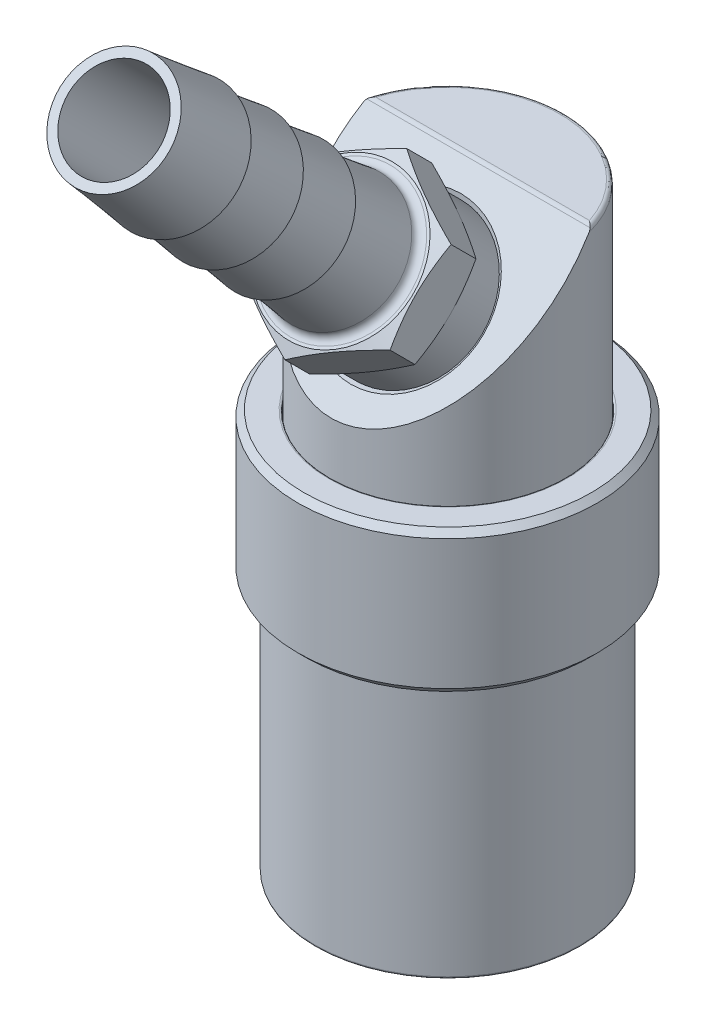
ISO-10303-21;
HEADER;
FILE_DESCRIPTION(('STEP AP214'),'2;1');
FILE_NAME('part.step','',(''),(''),'','','');
FILE_SCHEMA(('AUTOMOTIVE_DESIGN { 1 0 10303 214 1 1 1 1 }'));
ENDSEC;
DATA;
#1=APPLICATION_CONTEXT('core data for automotive mechanical design processes');
#2=APPLICATION_PROTOCOL_DEFINITION('international standard','automotive_design',2000,#1);
#3=PRODUCT_CONTEXT('',#1,'mechanical');
#4=PRODUCT('Part','Part','',(#3));
#5=PRODUCT_RELATED_PRODUCT_CATEGORY('part','',(#4));
#6=PRODUCT_DEFINITION_FORMATION('','',#4);
#7=PRODUCT_DEFINITION_CONTEXT('part definition',#1,'design');
#8=PRODUCT_DEFINITION('design','',#6,#7);
#9=PRODUCT_DEFINITION_SHAPE('','',#8);
#10=(LENGTH_UNIT() NAMED_UNIT(*) SI_UNIT(.MILLI.,.METRE.));
#11=(NAMED_UNIT(*) PLANE_ANGLE_UNIT() SI_UNIT($,.RADIAN.));
#12=(NAMED_UNIT(*) SI_UNIT($,.STERADIAN.) SOLID_ANGLE_UNIT());
#13=UNCERTAINTY_MEASURE_WITH_UNIT(LENGTH_MEASURE(1.E-05),#10,'distance_accuracy_value','');
#14=(GEOMETRIC_REPRESENTATION_CONTEXT(3) GLOBAL_UNCERTAINTY_ASSIGNED_CONTEXT((#13)) GLOBAL_UNIT_ASSIGNED_CONTEXT((#10,
#11,#12)) REPRESENTATION_CONTEXT('',''));
#15=CARTESIAN_POINT('',(0.,0.,0.));
#16=DIRECTION('',(0.,0.,1.));
#17=DIRECTION('',(1.,0.,0.));
#18=AXIS2_PLACEMENT_3D('',#15,#16,#17);
#19=CARTESIAN_POINT('',(0.,31.1305359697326,0.409235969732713));
#20=DIRECTION('',(0.,-0.707106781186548,-0.707106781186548));
#21=DIRECTION('',(0.,-0.707106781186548,0.707106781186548));
#22=AXIS2_PLACEMENT_3D('',#19,#20,#21);
#23=CYLINDRICAL_SURFACE('',#22,4.3815);
#24=CARTESIAN_POINT('',(1.08608073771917,28.1182026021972,3.39941882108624));
#25=CARTESIAN_POINT('',(1.14850552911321,28.1206967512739,3.37947668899));
#26=CARTESIAN_POINT('',(1.21037207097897,28.1234230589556,3.35781412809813));
#27=CARTESIAN_POINT('',(1.33513437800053,28.1292513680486,3.31023518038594));
#28=CARTESIAN_POINT('',(1.39798000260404,28.1323637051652,3.28418848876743));
#29=CARTESIAN_POINT('',(1.51525593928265,28.1383098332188,3.23160698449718));
#30=CARTESIAN_POINT('',(1.56985204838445,28.1411366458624,3.20544040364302));
#31=CARTESIAN_POINT('',(1.67471036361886,28.1464263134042,3.15186283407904));
#32=CARTESIAN_POINT('',(1.7250465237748,28.1489006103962,3.12459758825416));
#33=CARTESIAN_POINT('',(1.82992246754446,28.153956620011,3.06448274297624));
#34=CARTESIAN_POINT('',(1.88430108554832,28.1565192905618,3.03134975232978));
#35=CARTESIAN_POINT('',(1.98730866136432,28.1611969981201,2.96474383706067));
#36=CARTESIAN_POINT('',(2.03606739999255,28.1633310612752,2.93147267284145));
#37=CARTESIAN_POINT('',(2.12810633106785,28.167154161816,2.86526412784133));
#38=CARTESIAN_POINT('',(2.17151542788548,28.1688650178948,2.83250713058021));
#39=CARTESIAN_POINT('',(2.25315049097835,28.1718363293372,2.76792427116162));
#40=CARTESIAN_POINT('',(2.29150219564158,28.173122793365,2.73625844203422));
#41=CARTESIAN_POINT('',(2.36333140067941,28.1752430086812,2.67438149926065));
#42=CARTESIAN_POINT('',(2.39692934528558,28.1761078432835,2.64431122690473));
#43=CARTESIAN_POINT('',(2.45956138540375,28.1773725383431,2.58608054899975));
#44=CARTESIAN_POINT('',(2.48870888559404,28.1778111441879,2.55804286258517));
#45=CARTESIAN_POINT('',(2.54521761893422,28.1782545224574,2.5018053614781));
#46=CARTESIAN_POINT('',(2.57260609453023,28.1782713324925,2.4736330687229));
#47=CARTESIAN_POINT('',(2.62255267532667,28.177662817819,2.42053041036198));
#48=CARTESIAN_POINT('',(2.64523780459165,28.1771297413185,2.39571837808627));
#49=CARTESIAN_POINT('',(2.70131116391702,28.1750208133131,2.33262046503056));
#50=CARTESIAN_POINT('',(2.73423780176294,28.173051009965,2.29393535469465));
#51=CARTESIAN_POINT('',(2.79747302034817,28.1679882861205,2.21634802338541));
#52=CARTESIAN_POINT('',(2.82782910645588,28.1649283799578,2.17748225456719));
#53=CARTESIAN_POINT('',(2.88932958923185,28.1571850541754,2.09529111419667));
#54=CARTESIAN_POINT('',(2.92032597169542,28.1523868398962,2.05186539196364));
#55=CARTESIAN_POINT('',(2.97930179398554,28.141302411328,1.96520739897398));
#56=CARTESIAN_POINT('',(3.00734558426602,28.1350679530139,1.9220122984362));
#57=CARTESIAN_POINT('',(3.06056763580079,28.1211027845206,1.83603381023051));
#58=CARTESIAN_POINT('',(3.08580842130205,28.1134255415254,1.7932804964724));
#59=CARTESIAN_POINT('',(3.13358222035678,28.0965748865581,1.70838499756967));
#60=CARTESIAN_POINT('',(3.15617542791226,28.0874561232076,1.66626588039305));
#61=CARTESIAN_POINT('',(3.19881711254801,28.0677212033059,1.58281872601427));
#62=CARTESIAN_POINT('',(3.21892294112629,28.0571605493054,1.54150692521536));
#63=CARTESIAN_POINT('',(3.25675566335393,28.0345398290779,1.45983732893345));
#64=CARTESIAN_POINT('',(3.27453659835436,28.0225356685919,1.41948912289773));
#65=CARTESIAN_POINT('',(3.30873688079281,27.9963835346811,1.33786283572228));
#66=CARTESIAN_POINT('',(3.32512148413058,27.9821971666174,1.29658242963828));
#67=CARTESIAN_POINT('',(3.35563168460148,27.9521457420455,1.21539242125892));
#68=CARTESIAN_POINT('',(3.36981079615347,27.936344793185,1.17547928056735));
#69=CARTESIAN_POINT('',(3.3959433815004,27.9033512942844,1.09763578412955));
#70=CARTESIAN_POINT('',(3.40796492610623,27.8862440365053,1.05969204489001));
#71=CARTESIAN_POINT('',(3.43065931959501,27.8500579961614,0.983760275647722));
#72=CARTESIAN_POINT('',(3.44131467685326,27.8309584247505,0.945776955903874));
#73=CARTESIAN_POINT('',(3.46186134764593,27.7896426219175,0.867685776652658));
#74=CARTESIAN_POINT('',(3.47164650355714,27.7673017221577,0.827615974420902));
#75=CARTESIAN_POINT('',(3.48977266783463,27.7204165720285,0.74754189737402));
#76=CARTESIAN_POINT('',(3.49808759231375,27.6958423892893,0.707549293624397));
#77=CARTESIAN_POINT('',(3.51330576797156,27.6444912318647,0.627681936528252));
#78=CARTESIAN_POINT('',(3.52018094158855,27.6176825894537,0.587822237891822));
#79=CARTESIAN_POINT('',(3.53255333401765,27.5618644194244,0.508270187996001));
#80=CARTESIAN_POINT('',(3.53802105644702,27.5328221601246,0.468596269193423));
#81=CARTESIAN_POINT('',(3.54761327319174,27.4725375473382,0.389462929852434));
#82=CARTESIAN_POINT('',(3.55170740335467,27.4412619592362,0.350025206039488));
#83=CARTESIAN_POINT('',(3.55858790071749,27.3765108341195,0.271408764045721));
#84=CARTESIAN_POINT('',(3.56134354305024,27.3430020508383,0.232254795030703));
#85=CARTESIAN_POINT('',(3.56558386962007,27.2737851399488,0.154249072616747));
#86=CARTESIAN_POINT('',(3.56703793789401,27.2380441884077,0.115424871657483));
#87=CARTESIAN_POINT('',(3.56871042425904,27.1643594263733,0.0381158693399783));
#88=CARTESIAN_POINT('',(3.56889868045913,27.1263834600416,-0.000338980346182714));
#89=CARTESIAN_POINT('',(3.56849620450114,27.0877821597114,-0.0381382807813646));
#90=B_SPLINE_CURVE_WITH_KNOTS('',3,(#24,#25,#26,#27,#28,#29,#30,#31,#32,#33,#34,#35,#36,#37,#38,
#39,#40,#41,#42,#43,#44,#45,#46,#47,#48,#49,#50,#51,#52,#53,#54,#55,#56,#57,#58,#59,#60,#61,#62,
#63,#64,#65,#66,#67,#68,#69,#70,#71,#72,#73,#74,#75,#76,#77,#78,#79,#80,#81,#82,#83,#84,#85,#86,
#87,#88,#89),.UNSPECIFIED.,.F.,.F.,(4,2,2,2,2,2,2,2,2,2,2,2,2,2,2,2,2,2,2,2,2,2,2,2,2,2,2,2,2,2,
2,2,4),(0.,0.196717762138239,0.400906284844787,0.582654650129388,0.75448879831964,
0.945581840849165,1.12271109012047,1.28587929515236,1.43509021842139,1.57034903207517,
1.69166294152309,1.80951061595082,1.91036430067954,2.06281324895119,2.21099081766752,
2.37161666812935,2.52717177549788,2.67781462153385,2.82371970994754,2.9650791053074,
3.10210400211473,3.24189579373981,3.37743983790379,3.50734238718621,3.63877007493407,
3.77942466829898,3.92236750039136,4.06788108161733,4.21623323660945,4.36767673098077,
4.52244918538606,4.6807732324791,4.84285687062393),.UNSPECIFIED.);
#91=CARTESIAN_POINT('',(1.08610471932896,28.1178870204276,3.39945319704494));
#92=VERTEX_POINT('',#91);
#93=CARTESIAN_POINT('',(3.56849620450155,27.0877821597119,-0.0381382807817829));
#94=VERTEX_POINT('',#93);
#95=EDGE_CURVE('P0_E535',#92,#94,#90,.T.);
#96=ORIENTED_EDGE('',*,*,#95,.F.);
#97=CARTESIAN_POINT('',(-4.33156630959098,30.6510275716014,0.862546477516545));
#98=CARTESIAN_POINT('',(-4.29889735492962,30.4994526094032,1.01433476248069));
#99=CARTESIAN_POINT('',(-4.25025597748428,30.3495598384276,1.16443847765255));
#100=CARTESIAN_POINT('',(-4.12207740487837,30.0564362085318,1.45797460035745));
#101=CARTESIAN_POINT('',(-4.04251716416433,29.9132104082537,1.60140194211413));
#102=CARTESIAN_POINT('',(-3.84156865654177,29.6180812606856,1.89694636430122));
#103=CARTESIAN_POINT('',(-3.71600427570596,29.467586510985,2.04765286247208));
#104=CARTESIAN_POINT('',(-3.43088588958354,29.1836171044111,2.33202180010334));
#105=CARTESIAN_POINT('',(-3.27132427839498,29.0501462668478,2.46568041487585));
#106=CARTESIAN_POINT('',(-2.92276262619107,28.8040349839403,2.71213793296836));
#107=CARTESIAN_POINT('',(-2.73376513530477,28.6913927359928,2.82493864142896));
#108=CARTESIAN_POINT('',(-2.33170036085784,28.4901351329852,3.02647935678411));
#109=CARTESIAN_POINT('',(-2.1186343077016,28.4015185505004,3.11522059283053));
#110=CARTESIAN_POINT('',(-1.67446721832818,28.2508164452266,3.26613468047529));
#111=CARTESIAN_POINT('',(-1.44336581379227,28.1887314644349,3.32830698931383));
#112=CARTESIAN_POINT('',(-0.969689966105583,28.0928576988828,3.42431560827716));
#113=CARTESIAN_POINT('',(-0.727115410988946,28.0590691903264,3.45815164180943));
#114=CARTESIAN_POINT('',(-0.237382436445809,28.020748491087,3.49652624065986));
#115=CARTESIAN_POINT('',(0.00977596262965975,28.0162161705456,3.5010649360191));
#116=CARTESIAN_POINT('',(0.501661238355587,28.0365361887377,3.4807163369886));
#117=CARTESIAN_POINT('',(0.746388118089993,28.0613884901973,3.45582907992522));
#118=CARTESIAN_POINT('',(1.2264637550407,28.1397722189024,3.37733509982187));
#119=CARTESIAN_POINT('',(1.46181250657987,28.1933036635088,3.32372835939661));
#120=CARTESIAN_POINT('',(1.91645085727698,28.3275260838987,3.18931714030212));
#121=CARTESIAN_POINT('',(2.13574045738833,28.4082170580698,3.10851266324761));
#122=CARTESIAN_POINT('',(2.55203555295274,28.594467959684,2.92199976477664));
#123=CARTESIAN_POINT('',(2.74904104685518,28.7000278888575,2.81629134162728));
#124=CARTESIAN_POINT('',(3.11517553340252,28.933020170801,2.58297128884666));
#125=CARTESIAN_POINT('',(3.28430452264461,29.0604525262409,2.45535965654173));
#126=CARTESIAN_POINT('',(3.58988492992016,29.3335722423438,2.18185568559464));
#127=CARTESIAN_POINT('',(3.72633634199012,29.4792596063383,2.03596334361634));
#128=CARTESIAN_POINT('',(3.96268809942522,29.7847536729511,1.7300394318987));
#129=CARTESIAN_POINT('',(4.06258844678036,29.9445603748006,1.57000786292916));
#130=CARTESIAN_POINT('',(4.22300223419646,30.2737567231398,1.2403482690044));
#131=CARTESIAN_POINT('',(4.28351566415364,30.4431463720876,1.07072024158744));
#132=CARTESIAN_POINT('',(4.36343778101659,30.7867001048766,0.726683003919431));
#133=CARTESIAN_POINT('',(4.38284646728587,30.9608641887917,0.552273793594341));
#134=CARTESIAN_POINT('',(4.38000814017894,31.3090228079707,0.203625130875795));
#135=CARTESIAN_POINT('',(4.35776112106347,31.4830173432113,0.0293856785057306));
#136=CARTESIAN_POINT('',(4.27224289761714,31.8258976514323,-0.313977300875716));
#137=CARTESIAN_POINT('',(4.20897169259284,31.9947834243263,-0.483100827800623));
#138=CARTESIAN_POINT('',(4.04320117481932,32.3226520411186,-0.811431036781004));
#139=CARTESIAN_POINT('',(3.94070186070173,32.4816348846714,-0.970637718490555));
#140=CARTESIAN_POINT('',(3.69938478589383,32.7851845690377,-1.27461480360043));
#141=CARTESIAN_POINT('',(3.56056702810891,32.9297514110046,-1.41938520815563));
#142=CARTESIAN_POINT('',(3.25055372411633,33.2003652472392,-1.6903801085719));
#143=CARTESIAN_POINT('',(3.07935818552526,33.3264122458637,-1.81660460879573));
#144=CARTESIAN_POINT('',(2.70944898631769,33.5564083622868,-2.04692462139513));
#145=CARTESIAN_POINT('',(2.51073531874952,33.660357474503,-2.15102012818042));
#146=CARTESIAN_POINT('',(2.09143079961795,33.843206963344,-2.33412713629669));
#147=CARTESIAN_POINT('',(1.87083994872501,33.9221073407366,-2.4131386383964));
#148=CARTESIAN_POINT('',(1.41404314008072,34.0526195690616,-2.54383468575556));
#149=CARTESIAN_POINT('',(1.17783719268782,34.1042314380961,-2.59551924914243));
#150=CARTESIAN_POINT('',(0.696515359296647,34.1787016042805,-2.67009430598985));
#151=CARTESIAN_POINT('',(0.45139947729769,34.2015599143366,-2.69298481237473));
#152=CARTESIAN_POINT('',(-0.0407844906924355,34.2178741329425,-2.70932200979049));
#153=CARTESIAN_POINT('',(-0.287852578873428,34.2113300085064,-2.70276866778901));
#154=CARTESIAN_POINT('',(-0.776926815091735,34.1690250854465,-2.66040415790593));
#155=CARTESIAN_POINT('',(-1.01893296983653,34.1332643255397,-2.62459302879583));
#156=CARTESIAN_POINT('',(-1.49101415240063,34.0335412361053,-2.52472948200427));
#157=CARTESIAN_POINT('',(-1.72108916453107,33.9695788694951,-2.46067702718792));
#158=CARTESIAN_POINT('',(-2.16277919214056,33.815267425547,-2.30614824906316));
#159=CARTESIAN_POINT('',(-2.37439398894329,33.7249180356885,-2.21567161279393));
#160=CARTESIAN_POINT('',(-2.77314826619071,33.5203998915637,-2.01086544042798));
#161=CARTESIAN_POINT('',(-2.9602883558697,33.4062317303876,-1.89653649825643));
#162=CARTESIAN_POINT('',(-3.30477586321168,33.1573248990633,-1.64727915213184));
#163=CARTESIAN_POINT('',(-3.46212524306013,33.0225875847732,-1.51235210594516));
#164=CARTESIAN_POINT('',(-3.74260254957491,32.7363343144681,-1.22569576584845));
#165=CARTESIAN_POINT('',(-3.86572509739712,32.5848157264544,-1.0739638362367));
#166=CARTESIAN_POINT('',(-4.07425249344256,32.2692871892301,-0.757991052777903));
#167=CARTESIAN_POINT('',(-4.15964596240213,32.1052734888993,-0.593746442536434));
#168=CARTESIAN_POINT('',(-4.29018232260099,31.7695223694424,-0.257522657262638));
#169=CARTESIAN_POINT('',(-4.33535571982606,31.5977909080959,-0.0855494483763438));
#170=CARTESIAN_POINT('',(-4.37802093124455,31.2959535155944,0.216712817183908));
#171=CARTESIAN_POINT('',(-4.38476660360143,31.1664608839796,0.346387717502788));
#172=CARTESIAN_POINT('',(-4.37531346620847,30.907922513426,0.605289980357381));
#173=CARTESIAN_POINT('',(-4.35912162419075,30.7788766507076,0.734517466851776));
#174=CARTESIAN_POINT('',(-4.33156630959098,30.6510275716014,0.862546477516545));
#175=B_SPLINE_CURVE_WITH_KNOTS('',3,(#97,#98,#99,#100,#101,#102,#103,#104,#105,#106,#107,#108,
#109,#110,#111,#112,#113,#114,#115,#116,#117,#118,#119,#120,#121,#122,#123,#124,#125,#126,#127,
#128,#129,#130,#131,#132,#133,#134,#135,#136,#137,#138,#139,#140,#141,#142,#143,#144,#145,#146,
#147,#148,#149,#150,#151,#152,#153,#154,#155,#156,#157,#158,#159,#160,#161,#162,#163,#164,#165,
#166,#167,#168,#169,#170,#171,#172,#173,#174),.UNSPECIFIED.,.T.,.F.,(4,2,2,2,2,2,2,2,2,2,2,2,2,
2,2,2,2,2,2,2,2,2,2,2,2,2,2,2,2,2,2,2,2,2,2,2,2,2,4),(0.,0.650432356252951,1.3013504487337,
2.03948337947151,2.77778161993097,3.51601593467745,4.25421252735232,4.99242419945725,
5.73064307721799,6.4688586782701,7.20707334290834,7.94528845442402,8.68350352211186,
9.42171864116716,10.1599338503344,10.8981491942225,11.6363644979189,12.3745799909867,
13.112795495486,13.8510111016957,14.5892267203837,15.3274423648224,16.0656579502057,
16.8038733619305,17.5420889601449,18.2803045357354,19.0185196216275,19.7567343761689,
20.4949499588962,21.2331645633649,21.9713801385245,22.7096044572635,23.4478103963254,
24.1859676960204,24.9242409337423,25.6627366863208,26.400671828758,26.9494593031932,
27.4980801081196),.UNSPECIFIED.);
#176=CARTESIAN_POINT('',(0.,34.2131177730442,-2.70455895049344));
#177=VERTEX_POINT('',#176);
#178=EDGE_CURVE('P0_E24',#92,#177,#175,.T.);
#179=ORIENTED_EDGE('',*,*,#178,.T.);
#180=DIRECTION('',(0.,-0.707106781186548,-0.707106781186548));
#181=VECTOR('',#180,1.);
#182=CARTESIAN_POINT('',(0.,34.2287243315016,-2.68895239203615));
#183=LINE('',#182,#181);
#184=CARTESIAN_POINT('',(0.,31.983660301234,-4.93401642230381));
#185=VERTEX_POINT('',#184);
#186=EDGE_CURVE('P0_E606',#177,#185,#183,.T.);
#187=ORIENTED_EDGE('',*,*,#186,.T.);
#188=CARTESIAN_POINT('',(0.,28.8854719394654,-1.83582806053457));
#189=DIRECTION('',(0.,-0.707106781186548,-0.707106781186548));
#190=DIRECTION('',(0.,-0.707106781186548,0.707106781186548));
#191=AXIS2_PLACEMENT_3D('',#188,#189,#190);
#192=CIRCLE('',#191,4.3815);
#193=EDGE_CURVE('P0_E610',#185,#94,#192,.T.);
#194=ORIENTED_EDGE('',*,*,#193,.T.);
#195=EDGE_LOOP('',(#96,#179,#187,#194));
#196=FACE_BOUND('',#195,.T.);
#197=ADVANCED_FACE('P0_F16',(#196),#23,.F.);
#198=CARTESIAN_POINT('',(0.,0.3937,0.));
#199=DIRECTION('',(0.,-1.,0.));
#200=DIRECTION('',(0.,0.,-1.));
#201=AXIS2_PLACEMENT_3D('',#198,#199,#200);
#202=CONICAL_SURFACE('',#201,5.1689,0.785398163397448);
#203=CARTESIAN_POINT('',(0.,0.,0.));
#204=DIRECTION('',(0.,-1.,0.));
#205=DIRECTION('',(0.,0.,-1.));
#206=AXIS2_PLACEMENT_3D('',#203,#204,#205);
#207=CIRCLE('',#206,5.5626);
#208=CARTESIAN_POINT('',(0.,0.,5.5626));
#209=VERTEX_POINT('',#208);
#210=EDGE_CURVE('P0_E644',#209,#209,#207,.T.);
#211=ORIENTED_EDGE('',*,*,#210,.T.);
#212=DIRECTION('',(0.,0.707106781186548,-0.707106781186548));
#213=VECTOR('',#212,1.);
#214=CARTESIAN_POINT('',(0.,0.3937,5.1689));
#215=LINE('',#214,#213);
#216=CARTESIAN_POINT('',(0.,0.7874,4.7752));
#217=VERTEX_POINT('',#216);
#218=EDGE_CURVE('P0_E605',#209,#217,#215,.T.);
#219=ORIENTED_EDGE('',*,*,#218,.T.);
#220=CARTESIAN_POINT('',(0.,0.7874,0.));
#221=DIRECTION('',(0.,1.,0.));
#222=DIRECTION('',(0.,0.,-1.));
#223=AXIS2_PLACEMENT_3D('',#220,#221,#222);
#224=CIRCLE('',#223,4.7752);
#225=CARTESIAN_POINT('',(0.,0.7874,-4.7752));
#226=VERTEX_POINT('',#225);
#227=EDGE_CURVE('P0_E574',#217,#226,#224,.T.);
#228=ORIENTED_EDGE('',*,*,#227,.T.);
#229=CARTESIAN_POINT('',(0.,0.7874,0.));
#230=DIRECTION('',(0.,1.,0.));
#231=DIRECTION('',(0.,0.,-1.));
#232=AXIS2_PLACEMENT_3D('',#229,#230,#231);
#233=CIRCLE('',#232,4.7752);
#234=EDGE_CURVE('P0_E570',#226,#217,#233,.T.);
#235=ORIENTED_EDGE('',*,*,#234,.T.);
#236=ORIENTED_EDGE('',*,*,#218,.F.);
#237=EDGE_LOOP('',(#211,#219,#228,#235,#236));
#238=FACE_BOUND('',#237,.T.);
#239=ADVANCED_FACE('P0_F770',(#238),#202,.F.);
#240=CARTESIAN_POINT('',(0.,0.,6.35));
#241=DIRECTION('',(0.,-1.,0.));
#242=DIRECTION('',(0.,0.,-1.));
#243=AXIS2_PLACEMENT_3D('',#240,#241,#242);
#244=PLANE('',#243);
#245=CARTESIAN_POINT('',(0.,0.,0.));
#246=DIRECTION('',(0.,1.,0.));
#247=DIRECTION('',(0.,0.,-1.));
#248=AXIS2_PLACEMENT_3D('',#245,#246,#247);
#249=CIRCLE('',#248,6.096);
#250=CARTESIAN_POINT('',(0.,0.,6.096));
#251=VERTEX_POINT('',#250);
#252=CARTESIAN_POINT('',(0.,0.,-6.096));
#253=VERTEX_POINT('',#252);
#254=EDGE_CURVE('P0_E650',#251,#253,#249,.T.);
#255=ORIENTED_EDGE('',*,*,#254,.F.);
#256=CARTESIAN_POINT('',(0.,0.,0.));
#257=DIRECTION('',(0.,1.,0.));
#258=DIRECTION('',(0.,0.,-1.));
#259=AXIS2_PLACEMENT_3D('',#256,#257,#258);
#260=CIRCLE('',#259,6.096);
#261=EDGE_CURVE('P0_E645',#253,#251,#260,.T.);
#262=ORIENTED_EDGE('',*,*,#261,.F.);
#263=EDGE_LOOP('',(#255,#262));
#264=FACE_BOUND('',#263,.T.);
#265=ORIENTED_EDGE('',*,*,#210,.F.);
#266=EDGE_LOOP('',(#265));
#267=FACE_BOUND('',#266,.T.);
#268=ADVANCED_FACE('P0_F772',(#264,#267),#244,.T.);
#269=CARTESIAN_POINT('',(0.,4.05954416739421,0.));
#270=DIRECTION('',(0.,1.,0.));
#271=DIRECTION('',(0.,0.,1.));
#272=AXIS2_PLACEMENT_3D('',#269,#270,#271);
#273=CYLINDRICAL_SURFACE('',#272,4.7752);
#274=CARTESIAN_POINT('',(0.,8.11908833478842,0.));
#275=DIRECTION('',(0.,1.,0.));
#276=DIRECTION('',(1.,0.,0.));
#277=AXIS2_PLACEMENT_3D('',#274,#275,#276);
#278=CIRCLE('',#277,4.7752);
#279=CARTESIAN_POINT('',(0.,8.11908833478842,4.7752));
#280=VERTEX_POINT('',#279);
#281=CARTESIAN_POINT('',(0.,8.11908833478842,-4.7752));
#282=VERTEX_POINT('',#281);
#283=EDGE_CURVE('P0_E575',#280,#282,#278,.T.);
#284=ORIENTED_EDGE('',*,*,#283,.T.);
#285=DIRECTION('',(0.,-1.,0.));
#286=VECTOR('',#285,1.);
#287=CARTESIAN_POINT('',(0.,4.05954416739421,-4.7752));
#288=LINE('',#287,#286);
#289=EDGE_CURVE('P0_E666',#282,#226,#288,.T.);
#290=ORIENTED_EDGE('',*,*,#289,.T.);
#291=ORIENTED_EDGE('',*,*,#227,.F.);
#292=ORIENTED_EDGE('',*,*,#234,.F.);
#293=ORIENTED_EDGE('',*,*,#289,.F.);
#294=CARTESIAN_POINT('',(0.,8.11908833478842,0.));
#295=DIRECTION('',(0.,1.,0.));
#296=DIRECTION('',(1.,0.,0.));
#297=AXIS2_PLACEMENT_3D('',#294,#295,#296);
#298=CIRCLE('',#297,4.7752);
#299=EDGE_CURVE('P0_E600',#282,#280,#298,.T.);
#300=ORIENTED_EDGE('',*,*,#299,.T.);
#301=EDGE_LOOP('',(#284,#290,#291,#292,#293,#300));
#302=FACE_BOUND('',#301,.T.);
#303=ADVANCED_FACE('P0_F767',(#302),#273,.F.);
#304=CARTESIAN_POINT('',(0.,13.1064,0.));
#305=DIRECTION('',(0.,1.,0.));
#306=DIRECTION('',(0.,0.,1.));
#307=AXIS2_PLACEMENT_3D('',#304,#305,#306);
#308=TOROIDAL_SURFACE('',#307,3.8227,0.254);
#309=CARTESIAN_POINT('',(0.,12.8524,0.));
#310=DIRECTION('',(0.,-1.,0.));
#311=DIRECTION('',(0.,0.,-1.));
#312=AXIS2_PLACEMENT_3D('',#309,#310,#311);
#313=CIRCLE('',#312,3.8227);
#314=CARTESIAN_POINT('',(0.,12.8524,3.8227));
#315=VERTEX_POINT('',#314);
#316=CARTESIAN_POINT('',(0.,12.8524,-3.8227));
#317=VERTEX_POINT('',#316);
#318=EDGE_CURVE('P0_E596',#315,#317,#313,.T.);
#319=ORIENTED_EDGE('',*,*,#318,.T.);
#320=CARTESIAN_POINT('',(0.,13.1064,-3.8227));
#321=DIRECTION('',(-1.,0.,0.));
#322=DIRECTION('',(0.,0.,-1.));
#323=AXIS2_PLACEMENT_3D('',#320,#321,#322);
#324=CIRCLE('',#323,0.254);
#325=CARTESIAN_POINT('',(0.,13.1064,-3.5687));
#326=VERTEX_POINT('',#325);
#327=EDGE_CURVE('P0_E601',#317,#326,#324,.T.);
#328=ORIENTED_EDGE('',*,*,#327,.T.);
#329=CARTESIAN_POINT('',(0.,13.1064,0.));
#330=DIRECTION('',(0.,1.,0.));
#331=DIRECTION('',(0.,0.,-1.));
#332=AXIS2_PLACEMENT_3D('',#329,#330,#331);
#333=CIRCLE('',#332,3.5687);
#334=CARTESIAN_POINT('',(0.,13.1064,3.5687));
#335=VERTEX_POINT('',#334);
#336=EDGE_CURVE('P0_E705',#326,#335,#333,.T.);
#337=ORIENTED_EDGE('',*,*,#336,.T.);
#338=CARTESIAN_POINT('',(0.,13.1064,0.));
#339=DIRECTION('',(0.,1.,0.));
#340=DIRECTION('',(0.,0.,-1.));
#341=AXIS2_PLACEMENT_3D('',#338,#339,#340);
#342=CIRCLE('',#341,3.5687);
#343=EDGE_CURVE('P0_E563',#335,#326,#342,.T.);
#344=ORIENTED_EDGE('',*,*,#343,.T.);
#345=ORIENTED_EDGE('',*,*,#327,.F.);
#346=CARTESIAN_POINT('',(0.,12.8524,0.));
#347=DIRECTION('',(0.,-1.,0.));
#348=DIRECTION('',(0.,0.,-1.));
#349=AXIS2_PLACEMENT_3D('',#346,#347,#348);
#350=CIRCLE('',#349,3.8227);
#351=EDGE_CURVE('P0_E559',#317,#315,#350,.T.);
#352=ORIENTED_EDGE('',*,*,#351,.T.);
#353=EDGE_LOOP('',(#319,#328,#337,#344,#345,#352));
#354=FACE_BOUND('',#353,.T.);
#355=ADVANCED_FACE('P0_F781',(#354),#308,.T.);
#356=CARTESIAN_POINT('',(0.,20.7137,0.));
#357=DIRECTION('',(0.,1.,0.));
#358=DIRECTION('',(0.,0.,1.));
#359=AXIS2_PLACEMENT_3D('',#356,#357,#358);
#360=CYLINDRICAL_SURFACE('',#359,3.5687);
#361=CARTESIAN_POINT('',(-3.56849620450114,27.0877821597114,-0.0381382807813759));
#362=CARTESIAN_POINT('',(-3.56889848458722,27.1263637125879,-0.000358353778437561));
#363=CARTESIAN_POINT('',(-3.56871062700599,27.1643198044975,0.0380772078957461));
#364=CARTESIAN_POINT('',(-3.56704013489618,27.237969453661,0.115351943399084));
#365=CARTESIAN_POINT('',(-3.56558749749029,27.2736950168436,0.154161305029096));
#366=CARTESIAN_POINT('',(-3.56135080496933,27.3428857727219,0.232141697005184));
#367=CARTESIAN_POINT('',(-3.55859719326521,27.3763836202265,0.271285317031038));
#368=CARTESIAN_POINT('',(-3.55172111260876,27.4411175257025,0.349885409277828));
#369=CARTESIAN_POINT('',(-3.54762918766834,27.4723866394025,0.389317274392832));
#370=CARTESIAN_POINT('',(-3.53804130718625,27.5326629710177,0.468443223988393));
#371=CARTESIAN_POINT('',(-3.5325755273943,27.5617032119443,0.508115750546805));
#372=CARTESIAN_POINT('',(-3.52020651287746,27.6175220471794,0.587669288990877));
#373=CARTESIAN_POINT('',(-3.51333257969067,27.6443331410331,0.627532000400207));
#374=CARTESIAN_POINT('',(-3.49811593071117,27.6956938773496,0.70740959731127));
#375=CARTESIAN_POINT('',(-3.48980109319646,27.7202749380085,0.747409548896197));
#376=CARTESIAN_POINT('',(-3.47167372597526,27.7671787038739,0.827502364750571));
#377=CARTESIAN_POINT('',(-3.46188707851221,27.7895310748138,0.86758366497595));
#378=CARTESIAN_POINT('',(-3.44133602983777,27.8308726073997,0.945699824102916));
#379=CARTESIAN_POINT('',(-3.43067768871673,27.8499861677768,0.983696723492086));
#380=CARTESIAN_POINT('',(-3.40797558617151,27.8862061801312,1.05965844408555));
#381=CARTESIAN_POINT('',(-3.39594914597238,27.9033331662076,1.0976186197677));
#382=CARTESIAN_POINT('',(-3.3698249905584,27.9363381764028,1.17543699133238));
#383=CARTESIAN_POINT('',(-3.35566165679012,27.952133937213,1.21530813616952));
#384=CARTESIAN_POINT('',(-3.32518198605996,27.9821754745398,1.29642608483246));
#385=CARTESIAN_POINT('',(-3.30881175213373,27.9963564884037,1.33767654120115));
#386=CARTESIAN_POINT('',(-3.2746384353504,28.0225001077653,1.41925347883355));
#387=CARTESIAN_POINT('',(-3.25686969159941,28.0345007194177,1.45958223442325));
#388=CARTESIAN_POINT('',(-3.21905883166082,28.0571161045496,1.54122274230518));
#389=CARTESIAN_POINT('',(-3.1989623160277,28.0676745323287,1.58252486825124));
#390=CARTESIAN_POINT('',(-3.15633575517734,28.087406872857,1.66596207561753));
#391=CARTESIAN_POINT('',(-3.13374798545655,28.0965248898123,1.70808082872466));
#392=CARTESIAN_POINT('',(-3.08598050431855,28.1133758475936,1.79298454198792));
#393=CARTESIAN_POINT('',(-3.06074021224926,28.1210537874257,1.83574629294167));
#394=CARTESIAN_POINT('',(-3.00751350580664,28.1350220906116,1.92174998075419));
#395=CARTESIAN_POINT('',(-2.97946416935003,28.141258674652,1.96496165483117));
#396=CARTESIAN_POINT('',(-2.9204705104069,28.1523491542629,2.05166035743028));
#397=CARTESIAN_POINT('',(-2.88946143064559,28.1571510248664,2.09510998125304));
#398=CARTESIAN_POINT('',(-2.82793206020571,28.1649022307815,2.17734920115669));
#399=CARTESIAN_POINT('',(-2.7975597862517,28.1679662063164,2.21623914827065));
#400=CARTESIAN_POINT('',(-2.73428545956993,28.1730395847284,2.2938793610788));
#401=CARTESIAN_POINT('',(-2.70133561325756,28.175015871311,2.3325929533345));
#402=CARTESIAN_POINT('',(-2.6452582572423,28.1771316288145,2.39569536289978));
#403=CARTESIAN_POINT('',(-2.62259421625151,28.1776669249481,2.42048497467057));
#404=CARTESIAN_POINT('',(-2.57268500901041,28.1782791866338,2.47355064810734));
#405=CARTESIAN_POINT('',(-2.54531270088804,28.1782634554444,2.50170828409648));
#406=CARTESIAN_POINT('',(-2.48883202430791,28.1778220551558,2.55792282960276));
#407=CARTESIAN_POINT('',(-2.45969624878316,28.1773842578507,2.58595205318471));
#408=CARTESIAN_POINT('',(-2.3970834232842,28.1761208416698,2.64417142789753));
#409=CARTESIAN_POINT('',(-2.36349282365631,28.1752563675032,2.67423871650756));
#410=CARTESIAN_POINT('',(-2.29167359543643,28.1731365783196,2.73611488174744));
#411=CARTESIAN_POINT('',(-2.25332434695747,28.1718501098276,2.76778272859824));
#412=CARTESIAN_POINT('',(-2.17168893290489,28.1688784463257,2.83237422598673));
#413=CARTESIAN_POINT('',(-2.12827682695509,28.1671671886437,2.86513760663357));
#414=CARTESIAN_POINT('',(-2.03622602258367,28.1633429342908,2.93136275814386));
#415=CARTESIAN_POINT('',(-1.98745819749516,28.1612080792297,2.96464385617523));
#416=CARTESIAN_POINT('',(-1.88442599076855,28.1565284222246,3.03127252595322));
#417=CARTESIAN_POINT('',(-1.83003159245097,28.1539645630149,3.0644179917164));
#418=CARTESIAN_POINT('',(-1.72512648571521,28.1489063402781,3.12455372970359));
#419=CARTESIAN_POINT('',(-1.674777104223,28.1464310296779,3.15182765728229));
#420=CARTESIAN_POINT('',(-1.56988794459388,28.1411391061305,3.20542319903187));
#421=CARTESIAN_POINT('',(-1.5152740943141,28.1383110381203,3.23159884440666));
#422=CARTESIAN_POINT('',(-1.39798057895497,28.1323634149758,3.28418823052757));
#423=CARTESIAN_POINT('',(-1.3351355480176,28.1292508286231,3.31023469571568));
#424=CARTESIAN_POINT('',(-1.21037328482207,28.1234220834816,3.35781370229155));
#425=CARTESIAN_POINT('',(-1.14850616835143,28.1206955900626,3.37947648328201));
#426=CARTESIAN_POINT('',(-1.08608078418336,28.1182013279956,3.39941880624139));
#427=B_SPLINE_CURVE_WITH_KNOTS('',3,(#361,#362,#363,#364,#365,#366,#367,#368,#369,#370,#371,
#372,#373,#374,#375,#376,#377,#378,#379,#380,#381,#382,#383,#384,#385,#386,#387,#388,#389,#390,
#391,#392,#393,#394,#395,#396,#397,#398,#399,#400,#401,#402,#403,#404,#405,#406,#407,#408,#409,
#410,#411,#412,#413,#414,#415,#416,#417,#418,#419,#420,#421,#422,#423,#424,#425,#426),
.UNSPECIFIED.,.F.,.F.,(4,2,2,2,2,2,2,2,2,2,2,2,2,2,2,2,2,2,2,2,2,2,2,2,2,2,2,2,2,2,2,2,4),(0.,
0.162000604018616,0.320260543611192,0.474987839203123,0.626405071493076,0.774749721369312,
0.920274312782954,1.06324631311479,1.2039477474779,1.3354313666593,1.46540459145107,
1.60081708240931,1.74050914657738,1.87746550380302,2.01878602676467,2.16468217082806,
2.31534611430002,2.47095235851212,2.63165929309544,2.77992449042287,2.93248419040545,
3.0332456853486,3.15102803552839,3.27229899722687,3.40753541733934,3.55674451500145,
3.71993146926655,3.89710004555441,4.08825299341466,4.26013445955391,4.44194260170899,
4.64612926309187,4.8428488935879),.UNSPECIFIED.);
#428=CARTESIAN_POINT('',(-3.56849620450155,27.0877821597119,-0.0381382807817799));
#429=VERTEX_POINT('',#428);
#430=CARTESIAN_POINT('',(-1.08610330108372,28.1178809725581,3.39944798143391));
#431=VERTEX_POINT('',#430);
#432=EDGE_CURVE('P0_E558',#429,#431,#427,.T.);
#433=ORIENTED_EDGE('',*,*,#432,.T.);
#434=CARTESIAN_POINT('',(-3.06866467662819,29.0613084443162,1.82178944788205));
#435=CARTESIAN_POINT('',(-3.02228013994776,29.0119020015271,1.89993513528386));
#436=CARTESIAN_POINT('',(-2.97253606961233,28.9637613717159,1.97691036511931));
#437=CARTESIAN_POINT('',(-2.86636819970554,28.8701625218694,2.12792528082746));
#438=CARTESIAN_POINT('',(-2.80993961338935,28.8247062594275,2.20196281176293));
#439=CARTESIAN_POINT('',(-2.69041233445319,28.7366273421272,2.34651025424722));
#440=CARTESIAN_POINT('',(-2.62730298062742,28.69400939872,2.41701425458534));
#441=CARTESIAN_POINT('',(-2.49470110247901,28.6119387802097,2.55365500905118));
#442=CARTESIAN_POINT('',(-2.42521083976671,28.5724849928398,2.61979329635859));
#443=CARTESIAN_POINT('',(-2.23653399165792,28.4743387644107,2.78519780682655));
#444=CARTESIAN_POINT('',(-2.11250070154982,28.4182685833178,2.88059337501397));
#445=CARTESIAN_POINT('',(-1.85026935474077,28.3159982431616,3.05564552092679));
#446=CARTESIAN_POINT('',(-1.71208464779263,28.2697889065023,3.13531672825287));
#447=CARTESIAN_POINT('',(-1.41050093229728,28.1846070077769,3.28279379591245));
#448=CARTESIAN_POINT('',(-1.24595178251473,28.1466689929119,3.34887137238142));
#449=CARTESIAN_POINT('',(-0.906326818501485,28.0851551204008,3.45628664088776));
#450=CARTESIAN_POINT('',(-0.731248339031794,28.0615829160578,3.49761803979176));
#451=CARTESIAN_POINT('',(-0.375196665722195,28.0297396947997,3.55349947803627));
#452=CARTESIAN_POINT('',(-0.194214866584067,28.0214921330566,3.56800846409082));
#453=CARTESIAN_POINT('',(0.167948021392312,28.0207328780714,3.56934320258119));
#454=CARTESIAN_POINT('',(0.349129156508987,28.0282264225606,3.55615974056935));
#455=CARTESIAN_POINT('',(0.710160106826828,28.0589712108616,3.50219722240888));
#456=CARTESIAN_POINT('',(0.889885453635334,28.0825777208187,3.46079603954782));
#457=CARTESIAN_POINT('',(1.23825919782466,28.1449025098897,3.35194784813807));
#458=CARTESIAN_POINT('',(1.40692401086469,28.1835977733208,3.28454050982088));
#459=CARTESIAN_POINT('',(1.60872290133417,28.2405942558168,3.18586214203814));
#460=CARTESIAN_POINT('',(1.64911844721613,28.2525813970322,3.16513547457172));
#461=CARTESIAN_POINT('',(1.72885522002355,28.2773970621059,3.12229426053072));
#462=CARTESIAN_POINT('',(1.76819745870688,28.290224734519,3.10018111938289));
#463=CARTESIAN_POINT('',(1.8833009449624,28.3294981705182,3.03259375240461));
#464=CARTESIAN_POINT('',(1.95753533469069,28.3571301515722,2.98518536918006));
#465=CARTESIAN_POINT('',(2.10156119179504,28.4154039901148,2.88560794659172));
#466=CARTESIAN_POINT('',(2.17134943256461,28.4460479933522,2.83343551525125));
#467=CARTESIAN_POINT('',(2.30660737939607,28.5103486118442,2.72447612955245));
#468=CARTESIAN_POINT('',(2.37204541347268,28.5440238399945,2.66766089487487));
#469=CARTESIAN_POINT('',(2.49782655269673,28.6139890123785,2.55027219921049));
#470=CARTESIAN_POINT('',(2.5581746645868,28.6502763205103,2.48970253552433));
#471=CARTESIAN_POINT('',(2.61591000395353,28.6877920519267,2.42747493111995));
#472=B_SPLINE_CURVE_WITH_KNOTS('',3,(#434,#435,#436,#437,#438,#439,#440,#441,#442,#443,#444,
#445,#446,#447,#448,#449,#450,#451,#452,#453,#454,#455,#456,#457,#458,#459,#460,#461,#462,#463,
#464,#465,#466,#467,#468,#469,#470,#471),.UNSPECIFIED.,.F.,.F.,(4,2,2,2,2,2,2,2,2,2,2,2,2,2,2,2,
2,2,4),(0.,0.310268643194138,0.62076082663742,0.931756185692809,1.24264173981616,
1.73963848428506,2.23617063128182,2.77767562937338,3.31931827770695,3.86178925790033,
4.40444076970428,4.95946072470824,5.51363736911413,5.65449469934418,5.79521148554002,
6.07184353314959,6.34867410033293,6.62733859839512,6.90572570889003),.UNSPECIFIED.);
#473=EDGE_CURVE('P0_E36',#431,#92,#472,.T.);
#474=ORIENTED_EDGE('',*,*,#473,.T.);
#475=ORIENTED_EDGE('',*,*,#95,.T.);
#476=CARTESIAN_POINT('',(3.56849620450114,27.0877821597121,-0.0381382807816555));
#477=CARTESIAN_POINT('',(3.5680044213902,27.1097606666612,-0.0841692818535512));
#478=CARTESIAN_POINT('',(3.56662094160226,27.131603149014,-0.130256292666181));
#479=CARTESIAN_POINT('',(3.56212352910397,27.1743576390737,-0.221144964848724));
#480=CARTESIAN_POINT('',(3.55906096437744,27.1952782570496,-0.265945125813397));
#481=CARTESIAN_POINT('',(3.55134660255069,27.2361893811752,-0.354203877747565));
#482=CARTESIAN_POINT('',(3.54674494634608,27.256189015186,-0.397662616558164));
#483=CARTESIAN_POINT('',(3.53609171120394,27.2952573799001,-0.48319233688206));
#484=CARTESIAN_POINT('',(3.5300889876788,27.3143358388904,-0.52526495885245));
#485=CARTESIAN_POINT('',(3.51677015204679,27.3515612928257,-0.607985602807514));
#486=CARTESIAN_POINT('',(3.50950157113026,27.3697186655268,-0.648636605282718));
#487=CARTESIAN_POINT('',(3.49378439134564,27.4051012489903,-0.728485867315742));
#488=CARTESIAN_POINT('',(3.48538196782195,27.4223375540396,-0.767688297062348));
#489=CARTESIAN_POINT('',(3.46752688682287,27.4558772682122,-0.844620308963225));
#490=CARTESIAN_POINT('',(3.45811902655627,27.4721925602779,-0.88235510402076));
#491=CARTESIAN_POINT('',(3.43837892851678,27.5038893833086,-0.956339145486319));
#492=CARTESIAN_POINT('',(3.42809009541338,27.5192836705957,-0.992594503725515));
#493=CARTESIAN_POINT('',(3.40670971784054,27.5491377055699,-1.06361368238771));
#494=CARTESIAN_POINT('',(3.39566017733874,27.5636111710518,-1.0983843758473));
#495=CARTESIAN_POINT('',(3.37287556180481,27.5916220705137,-1.16643450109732));
#496=CARTESIAN_POINT('',(3.36118109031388,27.6051743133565,-1.19972142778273));
#497=CARTESIAN_POINT('',(3.33721937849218,27.6313433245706,-1.26480931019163));
#498=CARTESIAN_POINT('',(3.32499133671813,27.6439760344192,-1.29661827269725));
#499=CARTESIAN_POINT('',(3.30006981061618,27.6682987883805,-1.3587621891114));
#500=CARTESIAN_POINT('',(3.28741415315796,27.6800063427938,-1.38910547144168));
#501=CARTESIAN_POINT('',(3.25675493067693,27.7068678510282,-1.45983373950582));
#502=CARTESIAN_POINT('',(3.23839387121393,27.7218432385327,-1.50013237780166));
#503=CARTESIAN_POINT('',(3.2004714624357,27.7506400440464,-1.57939565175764));
#504=CARTESIAN_POINT('',(3.18094463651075,27.7644794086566,-1.61837029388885));
#505=CARTESIAN_POINT('',(3.14078454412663,27.7909965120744,-1.69496938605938));
#506=CARTESIAN_POINT('',(3.12018452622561,27.8036929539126,-1.73260477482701));
#507=CARTESIAN_POINT('',(3.07797189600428,27.8279254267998,-1.80651045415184));
#508=CARTESIAN_POINT('',(3.05639114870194,27.8394807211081,-1.84279261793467));
#509=CARTESIAN_POINT('',(3.01230856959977,27.861429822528,-1.91398304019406));
#510=CARTESIAN_POINT('',(2.98983715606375,27.8718434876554,-1.9489039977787));
#511=CARTESIAN_POINT('',(2.94406277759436,27.8915088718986,-2.01736769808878));
#512=CARTESIAN_POINT('',(2.92078870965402,27.9007810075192,-2.05092388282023));
#513=CARTESIAN_POINT('',(2.87349626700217,27.9181627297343,-2.11665829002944));
#514=CARTESIAN_POINT('',(2.84950519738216,27.926293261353,-2.14885060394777));
#515=CARTESIAN_POINT('',(2.80086360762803,27.941391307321,-2.2118617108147));
#516=CARTESIAN_POINT('',(2.77623873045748,27.9483802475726,-2.24269514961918));
#517=CARTESIAN_POINT('',(2.72641183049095,27.9611944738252,-2.3029969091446));
#518=CARTESIAN_POINT('',(2.70123372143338,27.9670416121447,-2.33248032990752));
#519=CARTESIAN_POINT('',(2.65038011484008,27.9775724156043,-2.39009405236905));
#520=CARTESIAN_POINT('',(2.62472673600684,27.9822782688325,-2.41823980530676));
#521=CARTESIAN_POINT('',(2.57299932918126,27.9905240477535,-2.47319384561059));
#522=CARTESIAN_POINT('',(2.54694557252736,27.994086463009,-2.5000178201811));
#523=CARTESIAN_POINT('',(2.49449244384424,28.000052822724,-2.55234618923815));
#524=CARTESIAN_POINT('',(2.46811142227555,28.0024792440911,-2.57786640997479));
#525=CARTESIAN_POINT('',(2.40988942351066,28.0065039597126,-2.63247204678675));
#526=CARTESIAN_POINT('',(2.3778940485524,28.0078860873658,-2.66140956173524));
#527=CARTESIAN_POINT('',(2.31318420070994,28.0089758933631,-2.71783423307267));
#528=CARTESIAN_POINT('',(2.28048014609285,28.0087002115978,-2.74533301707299));
#529=CARTESIAN_POINT('',(2.21442579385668,28.0064853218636,-2.79888013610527));
#530=CARTESIAN_POINT('',(2.18108350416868,28.0045604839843,-2.82493893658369));
#531=CARTESIAN_POINT('',(2.11382433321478,27.9990472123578,-2.87560888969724));
#532=CARTESIAN_POINT('',(2.07991326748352,27.9954707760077,-2.90022906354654));
#533=CARTESIAN_POINT('',(2.01158622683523,27.9866573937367,-2.94802800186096));
#534=CARTESIAN_POINT('',(1.97717415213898,27.9814298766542,-2.97121407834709));
#535=CARTESIAN_POINT('',(1.90791280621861,27.9693168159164,-3.01615413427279));
#536=CARTESIAN_POINT('',(1.87306584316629,27.9624380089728,-3.03791348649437));
#537=CARTESIAN_POINT('',(1.80300032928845,27.9470251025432,-3.0800123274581));
#538=CARTESIAN_POINT('',(1.76778285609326,27.9384949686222,-3.10035506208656));
#539=CARTESIAN_POINT('',(1.69703957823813,27.9197824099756,-3.13963566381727));
#540=CARTESIAN_POINT('',(1.66151400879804,27.9096011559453,-3.15857451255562));
#541=CARTESIAN_POINT('',(1.5902159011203,27.8875884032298,-3.19506470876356));
#542=CARTESIAN_POINT('',(1.55444315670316,27.8757553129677,-3.21261469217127));
#543=CARTESIAN_POINT('',(1.48270804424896,27.850444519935,-3.24634740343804));
#544=CARTESIAN_POINT('',(1.4467454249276,27.8369625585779,-3.26252640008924));
#545=CARTESIAN_POINT('',(1.37469155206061,27.8083459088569,-3.29353737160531));
#546=CARTESIAN_POINT('',(1.33860040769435,27.7932043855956,-3.3083632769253));
#547=CARTESIAN_POINT('',(1.26632518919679,27.7613115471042,-3.33669815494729));
#548=CARTESIAN_POINT('',(1.23014182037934,27.744551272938,-3.35019885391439));
#549=CARTESIAN_POINT('',(1.16220851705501,27.7114203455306,-3.37432029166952));
#550=CARTESIAN_POINT('',(1.13042670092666,27.695226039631,-3.3850937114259));
#551=CARTESIAN_POINT('',(1.06594374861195,27.6609450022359,-3.4059619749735));
#552=CARTESIAN_POINT('',(1.03325496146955,27.6428091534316,-3.41601410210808));
#553=CARTESIAN_POINT('',(0.96695055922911,27.6046786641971,-3.43538417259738));
#554=CARTESIAN_POINT('',(0.933348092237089,27.5846392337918,-3.44465859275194));
#555=CARTESIAN_POINT('',(0.865235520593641,27.5426846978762,-3.46240862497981));
#556=CARTESIAN_POINT('',(0.830740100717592,27.520727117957,-3.47083989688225));
#557=CARTESIAN_POINT('',(0.760845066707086,27.4749519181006,-3.48684198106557));
#558=CARTESIAN_POINT('',(0.72546076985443,27.4510953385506,-3.49436803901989));
#559=CARTESIAN_POINT('',(0.653850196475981,27.4014568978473,-3.50848723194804));
#560=CARTESIAN_POINT('',(0.617641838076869,27.3756364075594,-3.51503501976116));
#561=CARTESIAN_POINT('',(0.549781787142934,27.3263387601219,-3.52624460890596));
#562=CARTESIAN_POINT('',(0.518093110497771,27.3029413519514,-3.53103748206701));
#563=CARTESIAN_POINT('',(0.45452686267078,27.2556822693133,-3.53978206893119));
#564=CARTESIAN_POINT('',(0.422649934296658,27.2318183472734,-3.54372639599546));
#565=CARTESIAN_POINT('',(0.358942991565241,27.1833464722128,-3.55074972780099));
#566=CARTESIAN_POINT('',(0.327115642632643,27.158733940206,-3.55382115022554));
#567=CARTESIAN_POINT('',(0.285128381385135,27.1266242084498,-3.55730548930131));
#568=CARTESIAN_POINT('',(0.275107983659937,27.1189877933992,-3.55809493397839));
#569=CARTESIAN_POINT('',(0.255347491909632,27.1044450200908,-3.55956592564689));
#570=CARTESIAN_POINT('',(0.245620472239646,27.0975213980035,-3.56025096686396));
#571=CARTESIAN_POINT('',(0.226502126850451,27.0843347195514,-3.56151702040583));
#572=CARTESIAN_POINT('',(0.217121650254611,27.0780562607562,-3.56210167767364));
#573=CARTESIAN_POINT('',(0.198683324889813,27.066179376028,-3.5631762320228));
#574=CARTESIAN_POINT('',(0.189637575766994,27.0605625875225,-3.56366963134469));
#575=CARTESIAN_POINT('',(0.17187231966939,27.0500068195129,-3.56456925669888));
#576=CARTESIAN_POINT('',(0.163165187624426,27.0450473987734,-3.56497891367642));
#577=CARTESIAN_POINT('',(0.146076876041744,27.0358100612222,-3.5657186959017));
#578=CARTESIAN_POINT('',(0.137708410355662,27.0315090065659,-3.56605215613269));
#579=CARTESIAN_POINT('',(0.121297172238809,27.0235903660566,-3.56664685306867));
#580=CARTESIAN_POINT('',(0.113267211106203,27.0199467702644,-3.56691132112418));
#581=CARTESIAN_POINT('',(0.101272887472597,27.0149155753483,-3.56726484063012));
#582=CARTESIAN_POINT('',(0.0973847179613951,27.0133469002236,-3.56737315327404));
#583=CARTESIAN_POINT('',(0.089691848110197,27.0103782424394,-3.56757471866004));
#584=CARTESIAN_POINT('',(0.0858886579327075,27.0089743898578,-3.56766835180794));
#585=CARTESIAN_POINT('',(0.0783659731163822,27.0063355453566,-3.56784138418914));
#586=CARTESIAN_POINT('',(0.0746479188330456,27.0050964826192,-3.56792115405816));
#587=CARTESIAN_POINT('',(0.067295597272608,27.0027874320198,-3.56806727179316));
#588=CARTESIAN_POINT('',(0.0636626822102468,27.0017131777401,-3.56813397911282));
#589=CARTESIAN_POINT('',(0.0564807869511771,26.9997339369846,-3.56825476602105));
#590=CARTESIAN_POINT('',(0.0529330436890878,26.9988245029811,-3.5683091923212));
#591=CARTESIAN_POINT('',(0.0459216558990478,26.9971750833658,-3.56840619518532));
#592=CARTESIAN_POINT('',(0.0424591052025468,26.9964304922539,-3.56844910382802));
#593=CARTESIAN_POINT('',(0.0356182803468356,26.9951109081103,-3.56852383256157));
#594=CARTESIAN_POINT('',(0.0322409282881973,26.9945311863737,-3.56855596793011));
#595=CARTESIAN_POINT('',(0.0255707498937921,26.9935414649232,-3.56860989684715));
#596=CARTESIAN_POINT('',(0.0222786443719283,26.9931266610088,-3.5686319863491));
#597=CARTESIAN_POINT('',(0.0157790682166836,26.9924668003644,-3.56866654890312));
#598=CARTESIAN_POINT('',(0.0125720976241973,26.9922169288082,-3.56867929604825));
#599=CARTESIAN_POINT('',(0.0062435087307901,26.9918870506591,-3.56869590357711));
#600=CARTESIAN_POINT('',(0.00312213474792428,26.9918022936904,-3.56870001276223));
#601=CARTESIAN_POINT('',(0.,26.9918021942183,-3.5687));
#602=B_SPLINE_CURVE_WITH_KNOTS('',3,(#476,#477,#478,#479,#480,#481,#482,#483,#484,#485,#486,
#487,#488,#489,#490,#491,#492,#493,#494,#495,#496,#497,#498,#499,#500,#501,#502,#503,#504,#505,
#506,#507,#508,#509,#510,#511,#512,#513,#514,#515,#516,#517,#518,#519,#520,#521,#522,#523,#524,
#525,#526,#527,#528,#529,#530,#531,#532,#533,#534,#535,#536,#537,#538,#539,#540,#541,#542,#543,
#544,#545,#546,#547,#548,#549,#550,#551,#552,#553,#554,#555,#556,#557,#558,#559,#560,#561,#562,
#563,#564,#565,#566,#567,#568,#569,#570,#571,#572,#573,#574,#575,#576,#577,#578,#579,#580,#581,
#582,#583,#584,#585,#586,#587,#588,#589,#590,#591,#592,#593,#594,#595,#596,#597,#598,#599,#600,
#601),.UNSPECIFIED.,.F.,.F.,(4,2,2,2,2,2,2,2,2,2,2,2,2,2,2,2,2,2,2,2,2,2,2,2,2,2,2,2,2,2,2,2,2,
2,2,2,2,2,2,2,2,2,2,2,2,2,2,2,2,2,2,2,2,2,2,2,2,2,2,2,2,2,4),(0.,0.153026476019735,
0.301613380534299,0.445767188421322,0.585494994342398,0.720804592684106,0.85170457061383,
0.978204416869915,1.10031464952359,1.21804696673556,1.33141442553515,1.44043165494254,
1.54511511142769,1.68532007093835,1.82249445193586,1.95668907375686,2.08795821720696,
2.21635987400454,2.34195600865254,2.46481283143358,2.58500108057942,2.70259631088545,
2.81767918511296,2.93033576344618,3.04065778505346,3.17008405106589,3.2982134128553,
3.42523753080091,3.55135310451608,3.67676110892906,3.80166593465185,3.92627444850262,
4.05079499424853,4.1754363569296,4.30040671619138,4.42591261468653,4.55215796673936,
4.66390336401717,4.77999695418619,4.90058761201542,5.02580817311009,5.15577727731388,
5.29060102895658,5.40963356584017,5.52966374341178,5.65070672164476,5.68857385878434,
5.72444457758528,5.75834788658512,5.79031815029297,5.82039635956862,5.84863174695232,
5.87508383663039,5.88766450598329,5.89982781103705,5.91158535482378,5.92294998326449,
5.93393592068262,5.94455891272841,5.9548363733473,5.96478753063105,5.97443356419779,
5.98379772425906),.UNSPECIFIED.);
#603=CARTESIAN_POINT('',(0.,26.9918021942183,-3.5687));
#604=VERTEX_POINT('',#603);
#605=EDGE_CURVE('P0_E1388',#94,#604,#602,.T.);
#606=ORIENTED_EDGE('',*,*,#605,.T.);
#607=DIRECTION('',(0.,-1.,0.));
#608=VECTOR('',#607,1.);
#609=CARTESIAN_POINT('',(0.,20.7137,-3.5687));
#610=LINE('',#609,#608);
#611=EDGE_CURVE('P0_E1410',#604,#326,#610,.T.);
#612=ORIENTED_EDGE('',*,*,#611,.T.);
#613=ORIENTED_EDGE('',*,*,#343,.F.);
#614=ORIENTED_EDGE('',*,*,#336,.F.);
#615=ORIENTED_EDGE('',*,*,#611,.F.);
#616=CARTESIAN_POINT('',(0.,26.9918021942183,-3.5687));
#617=CARTESIAN_POINT('',(-0.00284802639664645,26.9918025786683,-3.56870001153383));
#618=CARTESIAN_POINT('',(-0.00569496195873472,26.9918880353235,-3.56869659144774));
#619=CARTESIAN_POINT('',(-0.0114986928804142,26.9922177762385,-3.56868270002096));
#620=CARTESIAN_POINT('',(-0.0144551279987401,26.9924685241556,-3.56867194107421));
#621=CARTESIAN_POINT('',(-0.0204775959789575,26.9931284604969,-3.56864257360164));
#622=CARTESIAN_POINT('',(-0.0235429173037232,26.993543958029,-3.56862364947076));
#623=CARTESIAN_POINT('',(-0.0297836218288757,26.9945336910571,-3.56857713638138));
#624=CARTESIAN_POINT('',(-0.0329580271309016,26.9951140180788,-3.56854920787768));
#625=CARTESIAN_POINT('',(-0.0394170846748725,26.9964336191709,-3.56848383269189));
#626=CARTESIAN_POINT('',(-0.0427005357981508,26.9971787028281,-3.56844602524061));
#627=CARTESIAN_POINT('',(-0.0493778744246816,26.9988281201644,-3.56836000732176));
#628=CARTESIAN_POINT('',(-0.0527703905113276,26.9997379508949,-3.56831141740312));
#629=CARTESIAN_POINT('',(-0.0596659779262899,27.0017171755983,-3.5682029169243));
#630=CARTESIAN_POINT('',(-0.0631675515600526,27.0027917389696,-3.56814261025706));
#631=CARTESIAN_POINT('',(-0.0702813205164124,27.0051007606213,-3.56800972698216));
#632=CARTESIAN_POINT('',(-0.0738919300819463,27.0063400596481,-3.5679367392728));
#633=CARTESIAN_POINT('',(-0.0812238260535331,27.0089788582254,-3.56777751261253));
#634=CARTESIAN_POINT('',(-0.0849434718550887,27.0103828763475,-3.56769084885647));
#635=CARTESIAN_POINT('',(-0.0924933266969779,27.013351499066,-3.56750325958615));
#636=CARTESIAN_POINT('',(-0.0963218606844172,27.0149203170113,-3.56740189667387));
#637=CARTESIAN_POINT('',(-0.108203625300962,27.0199652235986,-3.56706839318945));
#638=CARTESIAN_POINT('',(-0.116185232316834,27.0236092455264,-3.5668169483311));
#639=CARTESIAN_POINT('',(-0.13259601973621,27.0315274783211,-3.56624600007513));
#640=CARTESIAN_POINT('',(-0.141011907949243,27.0358286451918,-3.56592273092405));
#641=CARTESIAN_POINT('',(-0.158291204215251,27.0450650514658,-3.56519897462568));
#642=CARTESIAN_POINT('',(-0.167141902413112,27.050023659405,-3.56479455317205));
#643=CARTESIAN_POINT('',(-0.185287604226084,27.0605803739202,-3.56389905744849));
#644=CARTESIAN_POINT('',(-0.194570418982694,27.0661989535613,-3.56340390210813));
#645=CARTESIAN_POINT('',(-0.213585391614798,27.0780691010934,-3.56231626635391));
#646=CARTESIAN_POINT('',(-0.223306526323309,27.0843379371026,-3.56171950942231));
#647=CARTESIAN_POINT('',(-0.254013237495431,27.1047629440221,-3.55971145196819));
#648=CARTESIAN_POINT('',(-0.274645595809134,27.119432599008,-3.55817549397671));
#649=CARTESIAN_POINT('',(-0.327315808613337,27.1575909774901,-3.55380440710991));
#650=CARTESIAN_POINT('',(-0.359141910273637,27.1813342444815,-3.55072813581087));
#651=CARTESIAN_POINT('',(-0.422866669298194,27.22891099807,-3.54370216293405));
#652=CARTESIAN_POINT('',(-0.454764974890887,27.2527443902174,-3.53974846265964));
#653=CARTESIAN_POINT('',(-0.518268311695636,27.3009551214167,-3.53101423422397));
#654=CARTESIAN_POINT('',(-0.549871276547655,27.3253344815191,-3.52622992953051));
#655=CARTESIAN_POINT('',(-0.613489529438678,27.3736945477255,-3.51572082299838));
#656=CARTESIAN_POINT('',(-0.645506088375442,27.3976726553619,-3.50999144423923));
#657=CARTESIAN_POINT('',(-0.710507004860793,27.4443053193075,-3.49741229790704));
#658=CARTESIAN_POINT('',(-0.743495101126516,27.4669533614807,-3.49055755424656));
#659=CARTESIAN_POINT('',(-0.810218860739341,27.5111639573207,-3.47567900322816));
#660=CARTESIAN_POINT('',(-0.843957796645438,27.532719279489,-3.46764850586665));
#661=CARTESIAN_POINT('',(-0.912179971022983,27.574684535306,-3.45033233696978));
#662=CARTESIAN_POINT('',(-0.946666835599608,27.5950850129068,-3.44103797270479));
#663=CARTESIAN_POINT('',(-1.01632055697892,27.6347518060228,-3.4211161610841));
#664=CARTESIAN_POINT('',(-1.05149070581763,27.6540069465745,-3.41047800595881));
#665=CARTESIAN_POINT('',(-1.12244047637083,27.6914097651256,-3.387793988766));
#666=CARTESIAN_POINT('',(-1.15822269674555,27.7095448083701,-3.37573540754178));
#667=CARTESIAN_POINT('',(-1.23015311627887,27.7444881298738,-3.35019499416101));
#668=CARTESIAN_POINT('',(-1.26630224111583,27.7612899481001,-3.33670689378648));
#669=CARTESIAN_POINT('',(-1.33853675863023,27.7932099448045,-3.30838848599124));
#670=CARTESIAN_POINT('',(-1.37462130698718,27.8083373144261,-3.29356640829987));
#671=CARTESIAN_POINT('',(-1.44665842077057,27.8369412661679,-3.26256503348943));
#672=CARTESIAN_POINT('',(-1.48261090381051,27.8504245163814,-3.24639169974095));
#673=CARTESIAN_POINT('',(-1.5543304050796,27.8757345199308,-3.21266908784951));
#674=CARTESIAN_POINT('',(-1.59009766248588,27.8875654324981,-3.19512344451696));
#675=CARTESIAN_POINT('',(-1.66138715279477,27.9095755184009,-3.1586412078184));
#676=CARTESIAN_POINT('',(-1.69690957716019,27.9197561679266,-3.1397058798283));
#677=CARTESIAN_POINT('',(-1.76764939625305,27.9384678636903,-3.10043112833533));
#678=CARTESIAN_POINT('',(-1.80286653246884,27.9469976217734,-3.08009062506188));
#679=CARTESIAN_POINT('',(-1.87293391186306,27.9624104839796,-3.03799484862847));
#680=CARTESIAN_POINT('',(-1.90778304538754,27.9692895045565,-3.01623623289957));
#681=CARTESIAN_POINT('',(-1.97705115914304,27.9814036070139,-2.97129597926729));
#682=CARTESIAN_POINT('',(-2.0114677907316,27.9866318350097,-2.94810887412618));
#683=CARTESIAN_POINT('',(-2.07980618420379,27.9954472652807,-2.90030596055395));
#684=CARTESIAN_POINT('',(-2.11372399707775,27.9990249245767,-2.87568274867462));
#685=CARTESIAN_POINT('',(-2.18099870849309,28.0045413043,-2.82500455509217));
#686=CARTESIAN_POINT('',(-2.21434973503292,28.0064679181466,-2.79894046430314));
#687=CARTESIAN_POINT('',(-2.28042338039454,28.0086868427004,-2.74538037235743));
#688=CARTESIAN_POINT('',(-2.31313792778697,28.0089646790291,-2.71787382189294));
#689=CARTESIAN_POINT('',(-2.37787036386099,28.0078803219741,-2.661430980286));
#690=CARTESIAN_POINT('',(-2.4098777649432,28.0065013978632,-2.63248298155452));
#691=CARTESIAN_POINT('',(-2.46809924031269,28.0024829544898,-2.57787783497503));
#692=CARTESIAN_POINT('',(-2.49446849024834,28.0000607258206,-2.55236936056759));
#693=CARTESIAN_POINT('',(-2.54690094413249,27.9941017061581,-2.50006308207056));
#694=CARTESIAN_POINT('',(-2.5729457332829,27.9905423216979,-2.47324939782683));
#695=CARTESIAN_POINT('',(-2.62465794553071,27.9823021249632,-2.41831430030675));
#696=CARTESIAN_POINT('',(-2.65030502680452,27.9775987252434,-2.39017714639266));
#697=CARTESIAN_POINT('',(-2.70114859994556,27.9670721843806,-2.33257877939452));
#698=CARTESIAN_POINT('',(-2.72632289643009,27.9612267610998,-2.30310206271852));
#699=CARTESIAN_POINT('',(-2.77614454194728,27.9484153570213,-2.24281166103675));
#700=CARTESIAN_POINT('',(-2.80076789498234,27.9414274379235,-2.21198282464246));
#701=CARTESIAN_POINT('',(-2.84940859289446,27.9263308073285,-2.14897867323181));
#702=CARTESIAN_POINT('',(-2.8734002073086,27.9182005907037,-2.11678866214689));
#703=CARTESIAN_POINT('',(-2.92069566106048,27.9008188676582,-2.05105642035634));
#704=CARTESIAN_POINT('',(-2.9439721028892,27.8915463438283,-2.01750004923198));
#705=CARTESIAN_POINT('',(-2.98975289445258,27.8718795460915,-1.94903335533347));
#706=CARTESIAN_POINT('',(-3.01222825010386,27.86146478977,-1.91410954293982));
#707=CARTESIAN_POINT('',(-3.0563201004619,27.8395128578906,-1.84291062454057));
#708=CARTESIAN_POINT('',(-3.07790607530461,27.8279557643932,-1.80662277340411));
#709=CARTESIAN_POINT('',(-3.12013025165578,27.8037190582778,-1.73270277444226));
#710=CARTESIAN_POINT('',(-3.1407364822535,27.7910201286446,-1.6950587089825));
#711=CARTESIAN_POINT('',(-3.18090976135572,27.764497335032,-1.6184392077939));
#712=CARTESIAN_POINT('',(-3.20044345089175,27.7506547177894,-1.57945279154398));
#713=CARTESIAN_POINT('',(-3.23838004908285,27.7218509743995,-1.50016270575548));
#714=CARTESIAN_POINT('',(-3.25674832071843,27.7068718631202,-1.45984898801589));
#715=CARTESIAN_POINT('',(-3.28740989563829,27.6800114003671,-1.38911529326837));
#716=CARTESIAN_POINT('',(-3.30006159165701,27.6683090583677,-1.35878189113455));
#717=CARTESIAN_POINT('',(-3.32497646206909,27.6439956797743,-1.29665618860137));
#718=CARTESIAN_POINT('',(-3.33720176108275,27.6313670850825,-1.2648555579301));
#719=CARTESIAN_POINT('',(-3.3611591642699,27.6052054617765,-1.19978265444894));
#720=CARTESIAN_POINT('',(-3.37285201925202,27.5916564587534,-1.16650236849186));
#721=CARTESIAN_POINT('',(-3.39563443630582,27.5636511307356,-1.09846379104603));
#722=CARTESIAN_POINT('',(-3.40668334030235,27.5491799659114,-1.06369799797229));
#723=CARTESIAN_POINT('',(-3.42806333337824,27.5193296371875,-0.992686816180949));
#724=CARTESIAN_POINT('',(-3.43835236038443,27.5039367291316,-0.956434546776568));
#725=CARTESIAN_POINT('',(-3.45809357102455,27.4722417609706,-0.882454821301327));
#726=CARTESIAN_POINT('',(-3.46750228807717,27.4559269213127,-0.844721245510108));
#727=CARTESIAN_POINT('',(-3.48535962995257,27.4223872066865,-0.76778975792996));
#728=CARTESIAN_POINT('',(-3.49376339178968,27.4051504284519,-0.728586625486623));
#729=CARTESIAN_POINT('',(-3.50948360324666,27.3697659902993,-0.648734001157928));
#730=CARTESIAN_POINT('',(-3.51675380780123,27.3516072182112,-0.608080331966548));
#731=CARTESIAN_POINT('',(-3.53007603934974,27.3143780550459,-0.525352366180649));
#732=CARTESIAN_POINT('',(-3.53608046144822,27.2952972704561,-0.483275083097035));
#733=CARTESIAN_POINT('',(-3.54673702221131,27.2562233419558,-0.397734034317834));
#734=CARTESIAN_POINT('',(-3.55134022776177,27.2362204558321,-0.354268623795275));
#735=CARTESIAN_POINT('',(-3.55905738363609,27.1953019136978,-0.265994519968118));
#736=CARTESIAN_POINT('',(-3.56212111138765,27.1743771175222,-0.221185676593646));
#737=CARTESIAN_POINT('',(-3.56662029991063,27.1316133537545,-0.130277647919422));
#738=CARTESIAN_POINT('',(-3.56800430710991,27.1097657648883,-0.0841799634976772));
#739=CARTESIAN_POINT('',(-3.56849620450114,27.0877821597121,-0.0381382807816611));
#740=B_SPLINE_CURVE_WITH_KNOTS('',3,(#616,#617,#618,#619,#620,#621,#622,#623,#624,#625,#626,
#627,#628,#629,#630,#631,#632,#633,#634,#635,#636,#637,#638,#639,#640,#641,#642,#643,#644,#645,
#646,#647,#648,#649,#650,#651,#652,#653,#654,#655,#656,#657,#658,#659,#660,#661,#662,#663,#664,
#665,#666,#667,#668,#669,#670,#671,#672,#673,#674,#675,#676,#677,#678,#679,#680,#681,#682,#683,
#684,#685,#686,#687,#688,#689,#690,#691,#692,#693,#694,#695,#696,#697,#698,#699,#700,#701,#702,
#703,#704,#705,#706,#707,#708,#709,#710,#711,#712,#713,#714,#715,#716,#717,#718,#719,#720,#721,
#722,#723,#724,#725,#726,#727,#728,#729,#730,#731,#732,#733,#734,#735,#736,#737,#738,#739),
.UNSPECIFIED.,.F.,.F.,(4,2,2,2,2,2,2,2,2,2,2,2,2,2,2,2,2,2,2,2,2,2,2,2,2,2,2,2,2,2,2,2,2,2,2,2,
2,2,2,2,2,2,2,2,2,2,2,2,2,2,2,2,2,2,2,2,2,2,2,2,2,4),(0.,0.00854124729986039,0.0174380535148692,
0.0267148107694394,0.0363930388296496,0.0464916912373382,0.0570274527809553,0.0680150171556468,
0.0794673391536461,0.091395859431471,0.103810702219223,0.130132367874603,0.15849528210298,
0.188947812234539,0.221529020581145,0.256270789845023,0.332331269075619,0.451805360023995,
0.571835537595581,0.692426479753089,0.813619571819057,0.935363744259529,1.05782969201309,
1.18118511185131,1.3055941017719,1.43121662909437,1.55741476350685,1.68288169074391,
1.80782152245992,1.93244096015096,2.05694830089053,2.18155240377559,2.30646164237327,
2.43188286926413,2.5580204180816,2.68507516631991,2.81324367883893,2.94271744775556,
3.05298887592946,3.16560387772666,3.28065430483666,3.39822630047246,3.51840058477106,
3.64125274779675,3.76685354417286,3.89526918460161,4.02656162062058,4.16078881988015,
4.29800503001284,4.43826102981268,4.54290916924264,4.65189746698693,4.76524240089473,
4.88295861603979,5.00505918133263,5.13155580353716,5.26245900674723,5.39777828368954,
5.53752222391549,5.68169862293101,5.83031457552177,5.98337655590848),.UNSPECIFIED.);
#741=EDGE_CURVE('P0_E687',#604,#429,#740,.T.);
#742=ORIENTED_EDGE('',*,*,#741,.T.);
#743=EDGE_LOOP('',(#433,#474,#475,#606,#612,#613,#614,#615,#742));
#744=FACE_BOUND('',#743,.T.);
#745=ADVANCED_FACE('P0_F479',(#744),#360,.F.);
#746=CARTESIAN_POINT('',(0.,12.8524,5.0546));
#747=DIRECTION('',(0.,-1.,0.));
#748=DIRECTION('',(0.,0.,-1.));
#749=AXIS2_PLACEMENT_3D('',#746,#747,#748);
#750=PLANE('',#749);
#751=CARTESIAN_POINT('',(0.,12.8524,0.));
#752=DIRECTION('',(0.,1.,0.));
#753=DIRECTION('',(1.,0.,0.));
#754=AXIS2_PLACEMENT_3D('',#751,#752,#753);
#755=CIRCLE('',#754,5.0546);
#756=CARTESIAN_POINT('',(0.,12.8524,5.0546));
#757=VERTEX_POINT('',#756);
#758=CARTESIAN_POINT('',(0.,12.8524,-5.0546));
#759=VERTEX_POINT('',#758);
#760=EDGE_CURVE('P0_E618',#757,#759,#755,.T.);
#761=ORIENTED_EDGE('',*,*,#760,.F.);
#762=CARTESIAN_POINT('',(0.,12.8524,0.));
#763=DIRECTION('',(0.,1.,0.));
#764=DIRECTION('',(1.,0.,0.));
#765=AXIS2_PLACEMENT_3D('',#762,#763,#764);
#766=CIRCLE('',#765,5.0546);
#767=EDGE_CURVE('P0_E619',#759,#757,#766,.T.);
#768=ORIENTED_EDGE('',*,*,#767,.F.);
#769=EDGE_LOOP('',(#761,#768));
#770=FACE_BOUND('',#769,.T.);
#771=ORIENTED_EDGE('',*,*,#318,.F.);
#772=ORIENTED_EDGE('',*,*,#351,.F.);
#773=EDGE_LOOP('',(#771,#772));
#774=FACE_BOUND('',#773,.T.);
#775=ADVANCED_FACE('P0_F831',(#770,#774),#750,.T.);
#776=CARTESIAN_POINT('',(0.,0.254,0.));
#777=DIRECTION('',(0.,1.,0.));
#778=DIRECTION('',(0.,0.,1.));
#779=AXIS2_PLACEMENT_3D('',#776,#777,#778);
#780=TOROIDAL_SURFACE('',#779,6.096,0.254);
#781=CARTESIAN_POINT('',(0.,0.254,0.));
#782=DIRECTION('',(0.,-1.,0.));
#783=DIRECTION('',(0.,0.,-1.));
#784=AXIS2_PLACEMENT_3D('',#781,#782,#783);
#785=CIRCLE('',#784,6.35);
#786=CARTESIAN_POINT('',(0.,0.254,6.35));
#787=VERTEX_POINT('',#786);
#788=CARTESIAN_POINT('',(0.,0.254,-6.35));
#789=VERTEX_POINT('',#788);
#790=EDGE_CURVE('P0_E683',#787,#789,#785,.T.);
#791=ORIENTED_EDGE('',*,*,#790,.T.);
#792=CARTESIAN_POINT('',(0.,0.254,-6.096));
#793=DIRECTION('',(-1.,0.,0.));
#794=DIRECTION('',(0.,0.,-1.));
#795=AXIS2_PLACEMENT_3D('',#792,#793,#794);
#796=CIRCLE('',#795,0.254);
#797=EDGE_CURVE('P0_E649',#789,#253,#796,.T.);
#798=ORIENTED_EDGE('',*,*,#797,.T.);
#799=ORIENTED_EDGE('',*,*,#261,.T.);
#800=ORIENTED_EDGE('',*,*,#254,.T.);
#801=ORIENTED_EDGE('',*,*,#797,.F.);
#802=CARTESIAN_POINT('',(0.,0.254,0.));
#803=DIRECTION('',(0.,-1.,0.));
#804=DIRECTION('',(0.,0.,-1.));
#805=AXIS2_PLACEMENT_3D('',#802,#803,#804);
#806=CIRCLE('',#805,6.35);
#807=EDGE_CURVE('P0_E653',#789,#787,#806,.T.);
#808=ORIENTED_EDGE('',*,*,#807,.T.);
#809=EDGE_LOOP('',(#791,#798,#799,#800,#801,#808));
#810=FACE_BOUND('',#809,.T.);
#811=ADVANCED_FACE('P0_F840',(#810),#780,.T.);
#812=CARTESIAN_POINT('',(0.,7.62,0.));
#813=DIRECTION('',(0.,1.,0.));
#814=DIRECTION('',(0.,0.,1.));
#815=AXIS2_PLACEMENT_3D('',#812,#813,#814);
#816=CYLINDRICAL_SURFACE('',#815,6.35);
#817=CARTESIAN_POINT('',(0.,15.24,0.));
#818=DIRECTION('',(0.,1.,0.));
#819=DIRECTION('',(1.,0.,0.));
#820=AXIS2_PLACEMENT_3D('',#817,#818,#819);
#821=CIRCLE('',#820,6.35);
#822=CARTESIAN_POINT('',(0.,15.24,6.35));
#823=VERTEX_POINT('',#822);
#824=CARTESIAN_POINT('',(0.,15.24,-6.35));
#825=VERTEX_POINT('',#824);
#826=EDGE_CURVE('P0_E569',#823,#825,#821,.T.);
#827=ORIENTED_EDGE('',*,*,#826,.F.);
#828=CARTESIAN_POINT('',(0.,15.24,0.));
#829=DIRECTION('',(0.,1.,0.));
#830=DIRECTION('',(1.,0.,0.));
#831=AXIS2_PLACEMENT_3D('',#828,#829,#830);
#832=CIRCLE('',#831,6.35);
#833=EDGE_CURVE('P0_E579',#825,#823,#832,.T.);
#834=ORIENTED_EDGE('',*,*,#833,.F.);
#835=DIRECTION('',(0.,-1.,0.));
#836=VECTOR('',#835,1.);
#837=CARTESIAN_POINT('',(0.,7.62,-6.35));
#838=LINE('',#837,#836);
#839=EDGE_CURVE('P0_E667',#825,#789,#838,.T.);
#840=ORIENTED_EDGE('',*,*,#839,.T.);
#841=ORIENTED_EDGE('',*,*,#790,.F.);
#842=ORIENTED_EDGE('',*,*,#807,.F.);
#843=ORIENTED_EDGE('',*,*,#839,.F.);
#844=EDGE_LOOP('',(#827,#834,#840,#841,#842,#843));
#845=FACE_BOUND('',#844,.T.);
#846=ADVANCED_FACE('P0_F851',(#845),#816,.T.);
#847=CARTESIAN_POINT('',(0.,15.494,0.));
#848=DIRECTION('',(0.,1.,0.));
#849=DIRECTION('',(0.,0.,1.));
#850=AXIS2_PLACEMENT_3D('',#847,#848,#849);
#851=TOROIDAL_SURFACE('',#850,7.1501,0.254);
#852=CARTESIAN_POINT('',(0.,15.494,0.));
#853=DIRECTION('',(0.,-1.,0.));
#854=DIRECTION('',(0.,0.,-1.));
#855=AXIS2_PLACEMENT_3D('',#852,#853,#854);
#856=CIRCLE('',#855,7.4041);
#857=CARTESIAN_POINT('',(0.,15.494,7.4041));
#858=VERTEX_POINT('',#857);
#859=CARTESIAN_POINT('',(0.,15.494,-7.4041));
#860=VERTEX_POINT('',#859);
#861=EDGE_CURVE('P0_E629',#858,#860,#856,.T.);
#862=ORIENTED_EDGE('',*,*,#861,.T.);
#863=CARTESIAN_POINT('',(0.,15.494,-7.1501));
#864=DIRECTION('',(-1.,0.,0.));
#865=DIRECTION('',(0.,0.,-1.));
#866=AXIS2_PLACEMENT_3D('',#863,#864,#865);
#867=CIRCLE('',#866,0.254);
#868=CARTESIAN_POINT('',(0.,15.24,-7.1501));
#869=VERTEX_POINT('',#868);
#870=EDGE_CURVE('P0_E625',#860,#869,#867,.T.);
#871=ORIENTED_EDGE('',*,*,#870,.T.);
#872=CARTESIAN_POINT('',(0.,15.24,0.));
#873=DIRECTION('',(0.,1.,0.));
#874=DIRECTION('',(0.,0.,-1.));
#875=AXIS2_PLACEMENT_3D('',#872,#873,#874);
#876=CIRCLE('',#875,7.1501);
#877=CARTESIAN_POINT('',(0.,15.24,7.1501));
#878=VERTEX_POINT('',#877);
#879=EDGE_CURVE('P0_E630',#869,#878,#876,.T.);
#880=ORIENTED_EDGE('',*,*,#879,.T.);
#881=CARTESIAN_POINT('',(0.,15.24,0.));
#882=DIRECTION('',(0.,1.,0.));
#883=DIRECTION('',(0.,0.,-1.));
#884=AXIS2_PLACEMENT_3D('',#881,#882,#883);
#885=CIRCLE('',#884,7.1501);
#886=EDGE_CURVE('P0_E682',#878,#869,#885,.T.);
#887=ORIENTED_EDGE('',*,*,#886,.T.);
#888=ORIENTED_EDGE('',*,*,#870,.F.);
#889=CARTESIAN_POINT('',(0.,15.494,0.));
#890=DIRECTION('',(0.,-1.,0.));
#891=DIRECTION('',(0.,0.,-1.));
#892=AXIS2_PLACEMENT_3D('',#889,#890,#891);
#893=CIRCLE('',#892,7.4041);
#894=EDGE_CURVE('P0_E678',#860,#858,#893,.T.);
#895=ORIENTED_EDGE('',*,*,#894,.T.);
#896=EDGE_LOOP('',(#862,#871,#880,#887,#888,#895));
#897=FACE_BOUND('',#896,.T.);
#898=ADVANCED_FACE('P0_F862',(#897),#851,.T.);
#899=CARTESIAN_POINT('',(0.,26.67,0.));
#900=DIRECTION('',(0.,1.,0.));
#901=DIRECTION('',(0.,0.,1.));
#902=AXIS2_PLACEMENT_3D('',#899,#900,#901);
#903=CYLINDRICAL_SURFACE('',#902,7.4041);
#904=CARTESIAN_POINT('',(0.,37.846,0.));
#905=DIRECTION('',(0.,1.,0.));
#906=DIRECTION('',(0.,0.,-1.));
#907=AXIS2_PLACEMENT_3D('',#904,#905,#906);
#908=CIRCLE('',#907,7.4041);
#909=CARTESIAN_POINT('',(7.17791596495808,37.846,-1.8161));
#910=VERTEX_POINT('',#909);
#911=CARTESIAN_POINT('',(0.,37.846,-7.4041));
#912=VERTEX_POINT('',#911);
#913=EDGE_CURVE('P0_E1473',#910,#912,#908,.T.);
#914=ORIENTED_EDGE('',*,*,#913,.F.);
#915=CARTESIAN_POINT('',(0.,36.0299,0.));
#916=DIRECTION('',(0.,-0.707106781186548,-0.707106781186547));
#917=DIRECTION('',(0.,-0.707106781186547,0.707106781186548));
#918=AXIS2_PLACEMENT_3D('',#915,#916,#917);
#919=ELLIPSE('',#918,10.4709786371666,7.4041);
#920=CARTESIAN_POINT('',(-7.17791596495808,37.846,-1.8161));
#921=VERTEX_POINT('',#920);
#922=EDGE_CURVE('P0_E568',#910,#921,#919,.T.);
#923=ORIENTED_EDGE('',*,*,#922,.T.);
#924=CARTESIAN_POINT('',(0.,37.846,0.));
#925=DIRECTION('',(0.,1.,0.));
#926=DIRECTION('',(0.,0.,-1.));
#927=AXIS2_PLACEMENT_3D('',#924,#925,#926);
#928=CIRCLE('',#927,7.4041);
#929=EDGE_CURVE('P0_E1446',#912,#921,#928,.T.);
#930=ORIENTED_EDGE('',*,*,#929,.F.);
#931=DIRECTION('',(0.,-1.,0.));
#932=VECTOR('',#931,1.);
#933=CARTESIAN_POINT('',(0.,26.67,-7.4041));
#934=LINE('',#933,#932);
#935=EDGE_CURVE('P0_E564',#912,#860,#934,.T.);
#936=ORIENTED_EDGE('',*,*,#935,.T.);
#937=ORIENTED_EDGE('',*,*,#861,.F.);
#938=ORIENTED_EDGE('',*,*,#894,.F.);
#939=ORIENTED_EDGE('',*,*,#935,.F.);
#940=EDGE_LOOP('',(#914,#923,#930,#936,#937,#938,#939));
#941=FACE_BOUND('',#940,.T.);
#942=ADVANCED_FACE('P0_F872',(#941),#903,.T.);
#943=CARTESIAN_POINT('',(0.,15.24,7.4041));
#944=DIRECTION('',(0.,-1.,0.));
#945=DIRECTION('',(0.,0.,-1.));
#946=AXIS2_PLACEMENT_3D('',#943,#944,#945);
#947=PLANE('',#946);
#948=ORIENTED_EDGE('',*,*,#886,.F.);
#949=ORIENTED_EDGE('',*,*,#879,.F.);
#950=EDGE_LOOP('',(#948,#949));
#951=FACE_BOUND('',#950,.T.);
#952=ORIENTED_EDGE('',*,*,#826,.T.);
#953=ORIENTED_EDGE('',*,*,#833,.T.);
#954=EDGE_LOOP('',(#952,#953));
#955=FACE_BOUND('',#954,.T.);
#956=ADVANCED_FACE('P0_F883',(#951,#955),#947,.T.);
#957=CARTESIAN_POINT('',(0.,37.719,-2.22791536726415));
#958=DIRECTION('',(1.,0.,0.));
#959=DIRECTION('',(0.,0.923879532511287,0.38268343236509));
#960=AXIS2_PLACEMENT_3D('',#957,#958,#959);
#961=CYLINDRICAL_SURFACE('',#960,0.381);
#962=DIRECTION('',(-1.,0.,0.));
#963=VECTOR('',#962,1.);
#964=CARTESIAN_POINT('',(0.,38.1,-2.22791536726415));
#965=LINE('',#964,#963);
#966=CARTESIAN_POINT('',(6.79413888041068,38.1,-2.22791536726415));
#967=VERTEX_POINT('',#966);
#968=CARTESIAN_POINT('',(-6.79413888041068,38.1,-2.22791536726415));
#969=VERTEX_POINT('',#968);
#970=EDGE_CURVE('P0_E591',#967,#969,#965,.T.);
#971=ORIENTED_EDGE('',*,*,#970,.T.);
#972=CARTESIAN_POINT('',(-6.79413888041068,38.1,-2.22791536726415));
#973=CARTESIAN_POINT('',(-6.79522934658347,38.1,-2.22699684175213));
#974=CARTESIAN_POINT('',(-6.79631968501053,38.0999966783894,-2.22607815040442));
#975=CARTESIAN_POINT('',(-6.85864284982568,38.099616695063,-2.17355024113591));
#976=CARTESIAN_POINT('',(-6.92080398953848,38.0887434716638,-2.12029335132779));
#977=CARTESIAN_POINT('',(-7.02412318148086,38.0463700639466,-2.02767668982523));
#978=CARTESIAN_POINT('',(-7.06406120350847,38.020104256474,-1.99020425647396));
#979=CARTESIAN_POINT('',(-7.09507466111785,37.9884076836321,-1.95850768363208));
#980=(BOUNDED_CURVE() B_SPLINE_CURVE(3,(#972,#973,#974,#975,#976,#977,#978,#979),.UNSPECIFIED.,
.F.,.F.) B_SPLINE_CURVE_WITH_KNOTS((4,2,2,4),(-0.0366501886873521,-0.036295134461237,
-0.0163525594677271,0.),
.UNSPECIFIED.) CURVE() GEOMETRIC_REPRESENTATION_ITEM() RATIONAL_B_SPLINE_CURVE((1.,1.,1.,1.,1.,
1.,1.,1.)) REPRESENTATION_ITEM(''));
#981=CARTESIAN_POINT('',(-7.09507466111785,37.9884076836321,-1.95850768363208));
#982=VERTEX_POINT('',#981);
#983=EDGE_CURVE('P0_E595',#969,#982,#980,.T.);
#984=ORIENTED_EDGE('',*,*,#983,.T.);
#985=DIRECTION('',(1.,0.,0.));
#986=VECTOR('',#985,1.);
#987=CARTESIAN_POINT('',(0.,37.9884076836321,-1.95850768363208));
#988=LINE('',#987,#986);
#989=CARTESIAN_POINT('',(7.09507466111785,37.9884076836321,-1.95850768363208));
#990=VERTEX_POINT('',#989);
#991=EDGE_CURVE('P0_E1479',#982,#990,#988,.T.);
#992=ORIENTED_EDGE('',*,*,#991,.T.);
#993=CARTESIAN_POINT('',(6.79413888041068,38.1,-2.22791536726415));
#994=CARTESIAN_POINT('',(6.79522934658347,38.1,-2.22699684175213));
#995=CARTESIAN_POINT('',(6.79631968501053,38.0999966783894,-2.22607815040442));
#996=CARTESIAN_POINT('',(6.85864284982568,38.099616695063,-2.17355024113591));
#997=CARTESIAN_POINT('',(6.92080398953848,38.0887434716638,-2.12029335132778));
#998=CARTESIAN_POINT('',(7.02412318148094,38.0463700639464,-2.02767668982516));
#999=CARTESIAN_POINT('',(7.06406120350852,38.0201042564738,-1.9902042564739));
#1000=CARTESIAN_POINT('',(7.09507466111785,37.9884076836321,-1.95850768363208));
#1001=(BOUNDED_CURVE() B_SPLINE_CURVE(3,(#993,#994,#995,#996,#997,#998,#999,#1000),
.UNSPECIFIED.,.F.,.F.) B_SPLINE_CURVE_WITH_KNOTS((4,2,2,4),(-0.000427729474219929,0.,
0.0240245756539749,0.0437243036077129),
.UNSPECIFIED.) CURVE() GEOMETRIC_REPRESENTATION_ITEM() RATIONAL_B_SPLINE_CURVE((1.,1.,1.,1.,1.,
1.,1.,1.)) REPRESENTATION_ITEM(''));
#1002=EDGE_CURVE('P0_E754',#967,#990,#1001,.T.);
#1003=ORIENTED_EDGE('',*,*,#1002,.F.);
#1004=EDGE_LOOP('',(#971,#984,#992,#1003));
#1005=FACE_BOUND('',#1004,.T.);
#1006=ADVANCED_FACE('P0_F894',(#1005),#961,.T.);
#1007=CARTESIAN_POINT('',(0.,37.846,0.));
#1008=DIRECTION('',(0.,1.,0.));
#1009=DIRECTION('',(0.,0.,-1.));
#1010=AXIS2_PLACEMENT_3D('',#1007,#1008,#1009);
#1011=TOROIDAL_SURFACE('',#1010,7.1501,0.254);
#1012=ORIENTED_EDGE('',*,*,#913,.T.);
#1013=ORIENTED_EDGE('',*,*,#929,.T.);
#1014=CARTESIAN_POINT('',(-7.17791596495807,37.846,-1.8161));
#1015=CARTESIAN_POINT('',(-7.1762880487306,37.8522989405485,-1.82253590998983));
#1016=CARTESIAN_POINT('',(-7.17442350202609,37.8585978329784,-1.82891194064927));
#1017=CARTESIAN_POINT('',(-7.17022514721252,37.8711607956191,-1.84154133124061));
#1018=CARTESIAN_POINT('',(-7.16789138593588,37.8774248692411,-1.84779470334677));
#1019=CARTESIAN_POINT('',(-7.16275878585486,37.8898834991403,-1.86017591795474));
#1020=CARTESIAN_POINT('',(-7.15996003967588,37.8960780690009,-1.8663037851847));
#1021=CARTESIAN_POINT('',(-7.1539047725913,37.9083634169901,-1.87843199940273));
#1022=CARTESIAN_POINT('',(-7.1506483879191,37.9144542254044,-1.88443238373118));
#1023=CARTESIAN_POINT('',(-7.14368741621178,37.9264983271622,-1.89630431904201));
#1024=CARTESIAN_POINT('',(-7.13998300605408,37.9324516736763,-1.90217591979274));
#1025=CARTESIAN_POINT('',(-7.13213803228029,37.9441879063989,-1.91378974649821));
#1026=CARTESIAN_POINT('',(-7.12799768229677,37.9499708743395,-1.91953203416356));
#1027=CARTESIAN_POINT('',(-7.11929503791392,37.9613342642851,-1.93088739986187));
#1028=CARTESIAN_POINT('',(-7.1147329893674,37.9669148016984,-1.93650055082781));
#1029=CARTESIAN_POINT('',(-7.10520395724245,37.9778426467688,-1.94759877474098));
#1030=CARTESIAN_POINT('',(-7.10023724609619,37.9831901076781,-1.95308393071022));
#1031=CARTESIAN_POINT('',(-7.09507466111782,37.9884076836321,-1.95850768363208));
#1032=B_SPLINE_CURVE_WITH_KNOTS('',3,(#1014,#1015,#1016,#1017,#1018,#1019,#1020,#1021,#1022,
#1023,#1024,#1025,#1026,#1027,#1028,#1029,#1030,#1031),.UNSPECIFIED.,.F.,.F.,(4,2,2,2,2,2,2,2,
4),(0.,0.0274508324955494,0.054898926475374,0.0823415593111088,0.109776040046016,
0.137199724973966,0.164610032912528,0.192004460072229,0.219380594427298),.UNSPECIFIED.);
#1033=EDGE_CURVE('P0_E753',#921,#982,#1032,.T.);
#1034=ORIENTED_EDGE('',*,*,#1033,.T.);
#1035=ORIENTED_EDGE('',*,*,#983,.F.);
#1036=CARTESIAN_POINT('',(0.,38.1,0.));
#1037=DIRECTION('',(0.,-1.,0.));
#1038=DIRECTION('',(0.,0.,-1.));
#1039=AXIS2_PLACEMENT_3D('',#1036,#1037,#1038);
#1040=CIRCLE('',#1039,7.1501);
#1041=EDGE_CURVE('P0_E750',#969,#967,#1040,.T.);
#1042=ORIENTED_EDGE('',*,*,#1041,.T.);
#1043=ORIENTED_EDGE('',*,*,#1002,.T.);
#1044=CARTESIAN_POINT('',(7.09507466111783,37.9884076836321,-1.95850768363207));
#1045=CARTESIAN_POINT('',(7.10023724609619,37.9831901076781,-1.95308393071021));
#1046=CARTESIAN_POINT('',(7.10520395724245,37.9778426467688,-1.94759877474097));
#1047=CARTESIAN_POINT('',(7.11473298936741,37.9669148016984,-1.93650055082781));
#1048=CARTESIAN_POINT('',(7.11929503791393,37.9613342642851,-1.93088739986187));
#1049=CARTESIAN_POINT('',(7.12799768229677,37.9499708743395,-1.91953203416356));
#1050=CARTESIAN_POINT('',(7.13213803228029,37.9441879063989,-1.91378974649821));
#1051=CARTESIAN_POINT('',(7.13998300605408,37.9324516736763,-1.90217591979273));
#1052=CARTESIAN_POINT('',(7.14368741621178,37.9264983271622,-1.89630431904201));
#1053=CARTESIAN_POINT('',(7.1506483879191,37.9144542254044,-1.88443238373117));
#1054=CARTESIAN_POINT('',(7.1539047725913,37.9083634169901,-1.87843199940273));
#1055=CARTESIAN_POINT('',(7.15996003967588,37.8960780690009,-1.8663037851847));
#1056=CARTESIAN_POINT('',(7.16275878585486,37.8898834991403,-1.86017591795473));
#1057=CARTESIAN_POINT('',(7.16789138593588,37.8774248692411,-1.84779470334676));
#1058=CARTESIAN_POINT('',(7.17022514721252,37.8711607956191,-1.8415413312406));
#1059=CARTESIAN_POINT('',(7.17442350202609,37.8585978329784,-1.82891194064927));
#1060=CARTESIAN_POINT('',(7.1762880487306,37.8522989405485,-1.82253590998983));
#1061=CARTESIAN_POINT('',(7.17791596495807,37.846,-1.8161));
#1062=B_SPLINE_CURVE_WITH_KNOTS('',3,(#1044,#1045,#1046,#1047,#1048,#1049,#1050,#1051,#1052,
#1053,#1054,#1055,#1056,#1057,#1058,#1059,#1060,#1061),.UNSPECIFIED.,.F.,.F.,(4,2,2,2,2,2,2,2,
4),(0.,0.0273761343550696,0.0547705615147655,0.0821808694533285,0.109604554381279,
0.137039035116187,0.164481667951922,0.191929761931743,0.219380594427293),.UNSPECIFIED.);
#1063=EDGE_CURVE('P0_E640',#990,#910,#1062,.T.);
#1064=ORIENTED_EDGE('',*,*,#1063,.T.);
#1065=EDGE_LOOP('',(#1012,#1013,#1034,#1035,#1042,#1043,#1064));
#1066=FACE_BOUND('',#1065,.T.);
#1067=ADVANCED_FACE('P0_F511',(#1066),#1011,.T.);
#1068=CARTESIAN_POINT('',(0.,25.8698996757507,10.1600003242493));
#1069=DIRECTION('',(0.,-0.707106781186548,-0.707106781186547));
#1070=DIRECTION('',(0.,0.707106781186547,-0.707106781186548));
#1071=AXIS2_PLACEMENT_3D('',#1068,#1069,#1070);
#1072=PLANE('',#1071);
#1073=ORIENTED_EDGE('',*,*,#1063,.F.);
#1074=ORIENTED_EDGE('',*,*,#991,.F.);
#1075=ORIENTED_EDGE('',*,*,#1033,.F.);
#1076=ORIENTED_EDGE('',*,*,#922,.F.);
#1077=EDGE_LOOP('',(#1073,#1074,#1075,#1076));
#1078=FACE_BOUND('',#1077,.T.);
#1079=CARTESIAN_POINT('',(0.,33.3756,2.6543));
#1080=DIRECTION('',(0.,-0.707106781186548,-0.707106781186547));
#1081=DIRECTION('',(0.,-0.707106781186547,0.707106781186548));
#1082=AXIS2_PLACEMENT_3D('',#1079,#1080,#1081);
#1083=CIRCLE('',#1082,4.953);
#1084=CARTESIAN_POINT('',(0.,29.8733001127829,6.15659988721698));
#1085=VERTEX_POINT('',#1084);
#1086=CARTESIAN_POINT('',(0.,36.8778998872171,-0.847999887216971));
#1087=VERTEX_POINT('',#1086);
#1088=EDGE_CURVE('P0_E636',#1085,#1087,#1083,.T.);
#1089=ORIENTED_EDGE('',*,*,#1088,.T.);
#1090=CARTESIAN_POINT('',(0.,33.3756,2.6543));
#1091=DIRECTION('',(0.,-0.707106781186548,-0.707106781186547));
#1092=DIRECTION('',(0.,-0.707106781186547,0.707106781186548));
#1093=AXIS2_PLACEMENT_3D('',#1090,#1091,#1092);
#1094=CIRCLE('',#1093,4.953);
#1095=EDGE_CURVE('P0_E609',#1087,#1085,#1094,.T.);
#1096=ORIENTED_EDGE('',*,*,#1095,.T.);
#1097=EDGE_LOOP('',(#1089,#1096));
#1098=FACE_BOUND('',#1097,.T.);
#1099=ADVANCED_FACE('P0_F915',(#1078,#1098),#1072,.F.);
#1100=CARTESIAN_POINT('',(0.,38.1,0.));
#1101=DIRECTION('',(0.,1.,0.));
#1102=DIRECTION('',(1.,0.,0.));
#1103=AXIS2_PLACEMENT_3D('',#1100,#1101,#1102);
#1104=PLANE('',#1103);
#1105=ORIENTED_EDGE('',*,*,#970,.F.);
#1106=ORIENTED_EDGE('',*,*,#1041,.F.);
#1107=EDGE_LOOP('',(#1105,#1106));
#1108=FACE_BOUND('',#1107,.T.);
#1109=ADVANCED_FACE('P0_F509',(#1108),#1104,.T.);
#1110=ORIENTED_EDGE('',*,*,#186,.F.);
#1111=EDGE_CURVE('P0_E501',#177,#431,#175,.T.);
#1112=ORIENTED_EDGE('',*,*,#1111,.T.);
#1113=ORIENTED_EDGE('',*,*,#432,.F.);
#1114=CARTESIAN_POINT('',(0.,28.8854719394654,-1.83582806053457));
#1115=DIRECTION('',(0.,-0.707106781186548,-0.707106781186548));
#1116=DIRECTION('',(0.,-0.707106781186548,0.707106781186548));
#1117=AXIS2_PLACEMENT_3D('',#1114,#1115,#1116);
#1118=CIRCLE('',#1117,4.3815);
#1119=EDGE_CURVE('P0_E522',#429,#185,#1118,.T.);
#1120=ORIENTED_EDGE('',*,*,#1119,.T.);
#1121=EDGE_LOOP('',(#1110,#1112,#1113,#1120));
#1122=FACE_BOUND('',#1121,.T.);
#1123=ADVANCED_FACE('P0_F504',(#1122),#23,.F.);
#1124=CARTESIAN_POINT('',(0.,27.9136441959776,-2.80765580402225));
#1125=DIRECTION('',(0.,0.707106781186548,0.707106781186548));
#1126=DIRECTION('',(0.,-0.707106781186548,0.707106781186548));
#1127=AXIS2_PLACEMENT_3D('',#1124,#1125,#1126);
#1128=CONICAL_SURFACE('',#1127,2.09416092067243,1.02974425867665);
#1129=ORIENTED_EDGE('',*,*,#605,.F.);
#1130=ORIENTED_EDGE('',*,*,#193,.F.);
#1131=DIRECTION('',(0.,-0.970295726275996,0.241921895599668));
#1132=VECTOR('',#1131,1.);
#1133=CARTESIAN_POINT('',(0.,29.3944395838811,-4.28845119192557));
#1134=LINE('',#1133,#1132);
#1135=CARTESIAN_POINT('',(0.,27.023892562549,-3.697407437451));
#1136=VERTEX_POINT('',#1135);
#1137=EDGE_CURVE('P0_E624',#185,#1136,#1134,.T.);
#1138=ORIENTED_EDGE('',*,*,#1137,.T.);
#1139=ORIENTED_EDGE('',*,*,#1137,.F.);
#1140=ORIENTED_EDGE('',*,*,#1119,.F.);
#1141=ORIENTED_EDGE('',*,*,#741,.F.);
#1142=EDGE_LOOP('',(#1129,#1130,#1138,#1139,#1140,#1141));
#1143=FACE_BOUND('',#1142,.T.);
#1144=ADVANCED_FACE('P0_F508',(#1143),#1128,.F.);
#1145=CARTESIAN_POINT('',(0.,33.0280640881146,2.30676408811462));
#1146=DIRECTION('',(0.,0.707106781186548,0.707106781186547));
#1147=DIRECTION('',(0.,-0.707106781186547,0.707106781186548));
#1148=AXIS2_PLACEMENT_3D('',#1145,#1146,#1147);
#1149=CONICAL_SURFACE('',#1148,4.46151,0.785398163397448);
#1150=CARTESIAN_POINT('',(-4.50604046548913,32.2417175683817,3.43849121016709));
#1151=CARTESIAN_POINT('',(-4.57333563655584,32.3995656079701,3.28084975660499));
#1152=CARTESIAN_POINT('',(-4.62404882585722,32.5609934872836,3.11963313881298));
#1153=CARTESIAN_POINT('',(-4.69117608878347,32.887466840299,2.79358702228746));
#1154=CARTESIAN_POINT('',(-4.70756455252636,33.0525149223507,2.62875491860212));
#1155=CARTESIAN_POINT('',(-4.70545997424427,33.4047519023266,2.27697884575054));
#1156=CARTESIAN_POINT('',(-4.6819855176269,33.5919367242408,2.09003894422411));
#1157=CARTESIAN_POINT('',(-4.59094901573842,33.9608774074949,1.72158097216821));
#1158=CARTESIAN_POINT('',(-4.52337705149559,34.1426320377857,1.5400641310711));
#1159=CARTESIAN_POINT('',(-4.34607073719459,34.4955247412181,1.18763309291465));
#1160=CARTESIAN_POINT('',(-4.23634004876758,34.6666637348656,1.01671797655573));
#1161=CARTESIAN_POINT('',(-3.97783539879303,34.9934669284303,0.690342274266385));
#1162=CARTESIAN_POINT('',(-3.82906344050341,35.1491319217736,0.534880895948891));
#1163=CARTESIAN_POINT('',(-3.49669374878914,35.4405838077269,0.243810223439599));
#1164=CARTESIAN_POINT('',(-3.31309529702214,35.576370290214,0.108201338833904));
#1165=CARTESIAN_POINT('',(-2.9162842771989,35.8242073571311,-0.139311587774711));
#1166=CARTESIAN_POINT('',(-2.70307141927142,35.9362577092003,-0.251215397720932));
#1167=CARTESIAN_POINT('',(-2.25308655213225,36.1334397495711,-0.448139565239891));
#1168=CARTESIAN_POINT('',(-2.01631464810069,36.2185715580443,-0.533160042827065));
#1169=CARTESIAN_POINT('',(-1.525932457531,36.3595004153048,-0.673904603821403));
#1170=CARTESIAN_POINT('',(-1.27232219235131,36.4152975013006,-0.729628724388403));
#1171=CARTESIAN_POINT('',(-0.755462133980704,36.4959731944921,-0.810198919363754));
#1172=CARTESIAN_POINT('',(-0.492212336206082,36.5208517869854,-0.835044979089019));
#1173=CARTESIAN_POINT('',(0.036453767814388,36.5389842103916,-0.853153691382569));
#1174=CARTESIAN_POINT('',(0.301870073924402,36.5322380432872,-0.846416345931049));
#1175=CARTESIAN_POINT('',(0.827334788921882,36.4873124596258,-0.801549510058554));
#1176=CARTESIAN_POINT('',(1.08738319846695,36.4491330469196,-0.763420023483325));
#1177=CARTESIAN_POINT('',(1.59473017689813,36.3424247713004,-0.656851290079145));
#1178=CARTESIAN_POINT('',(1.84202874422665,36.2738959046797,-0.588412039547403));
#1179=CARTESIAN_POINT('',(2.31685592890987,36.108434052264,-0.423166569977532));
#1180=CARTESIAN_POINT('',(2.54438454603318,36.0115010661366,-0.326360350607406));
#1181=CARTESIAN_POINT('',(2.97321295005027,35.7919826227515,-0.107128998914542));
#1182=CARTESIAN_POINT('',(3.17451273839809,35.669397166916,0.0152961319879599));
#1183=CARTESIAN_POINT('',(3.54516923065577,35.4020535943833,0.282290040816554));
#1184=CARTESIAN_POINT('',(3.71452592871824,35.2572954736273,0.426858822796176));
#1185=CARTESIAN_POINT('',(4.01648866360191,34.9497158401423,0.734036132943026));
#1186=CARTESIAN_POINT('',(4.14909469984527,34.7868943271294,0.896644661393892));
#1187=CARTESIAN_POINT('',(4.37379183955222,34.4478098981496,1.23528551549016));
#1188=CARTESIAN_POINT('',(4.46588293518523,34.2715469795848,1.41131784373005));
#1189=CARTESIAN_POINT('',(4.60693596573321,33.9105833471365,1.77180923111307));
#1190=CARTESIAN_POINT('',(4.65589789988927,33.7258826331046,1.95626829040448));
#1191=CARTESIAN_POINT('',(4.70930272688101,33.3532864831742,2.32837692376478));
#1192=CARTESIAN_POINT('',(4.71374561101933,33.1653910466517,2.51602649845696));
#1193=CARTESIAN_POINT('',(4.67798619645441,32.7917393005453,2.88918929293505));
#1194=CARTESIAN_POINT('',(4.63778390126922,32.6059829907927,3.07470251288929));
#1195=CARTESIAN_POINT('',(4.51387535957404,32.2418825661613,3.43832643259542));
#1196=CARTESIAN_POINT('',(4.43016911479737,32.063538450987,3.61643713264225));
#1197=CARTESIAN_POINT('',(4.2216288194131,31.7193250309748,3.96020002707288));
#1198=CARTESIAN_POINT('',(4.09679475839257,31.5534557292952,4.12585221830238));
#1199=CARTESIAN_POINT('',(3.80954248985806,31.2389005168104,4.43999568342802));
#1200=CARTESIAN_POINT('',(3.64712427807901,31.0902146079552,4.58848695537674));
#1201=CARTESIAN_POINT('',(3.28931441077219,30.8142470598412,4.86409323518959));
#1202=CARTESIAN_POINT('',(3.09392277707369,30.6869654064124,4.99120825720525));
#1203=CARTESIAN_POINT('',(2.67571266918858,30.4574194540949,5.22045368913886));
#1204=CARTESIAN_POINT('',(2.45289420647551,30.3551551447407,5.32258410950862));
#1205=CARTESIAN_POINT('',(1.9861552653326,30.1785467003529,5.498961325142));
#1206=CARTESIAN_POINT('',(1.74223476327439,30.1042025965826,5.57320808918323));
#1207=CARTESIAN_POINT('',(1.24021651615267,29.9855452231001,5.69171010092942));
#1208=CARTESIAN_POINT('',(0.982118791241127,29.9412319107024,5.73596539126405));
#1209=CARTESIAN_POINT('',(0.459072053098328,29.8838938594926,5.79322836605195));
#1210=CARTESIAN_POINT('',(0.194123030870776,29.8708691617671,5.8062360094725));
#1211=CARTESIAN_POINT('',(-0.335107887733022,29.8764781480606,5.80063436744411));
#1212=CARTESIAN_POINT('',(-0.599389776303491,29.895112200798,5.78202471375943));
#1213=CARTESIAN_POINT('',(-1.11977465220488,29.9635098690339,5.71371660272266));
#1214=CARTESIAN_POINT('',(-1.37587784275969,30.0132727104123,5.66401891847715));
#1215=CARTESIAN_POINT('',(-1.87262521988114,30.1425092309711,5.53495161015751));
#1216=CARTESIAN_POINT('',(-2.11327042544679,30.2219809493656,5.45558394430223));
#1217=CARTESIAN_POINT('',(-2.57232887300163,30.4083988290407,5.26941013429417));
#1218=CARTESIAN_POINT('',(-2.79073862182,30.515349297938,5.16259968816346));
#1219=CARTESIAN_POINT('',(-3.19913405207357,30.7537024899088,4.92455854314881));
#1220=CARTESIAN_POINT('',(-3.38911116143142,30.8851125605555,4.79332050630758));
#1221=CARTESIAN_POINT('',(-3.73507013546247,31.1685817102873,4.51022243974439));
#1222=CARTESIAN_POINT('',(-3.89107766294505,31.3206250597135,4.35837811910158));
#1223=CARTESIAN_POINT('',(-4.12968659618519,31.5998992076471,4.0794695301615));
#1224=CARTESIAN_POINT('',(-4.22085551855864,31.723514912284,3.95601562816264));
#1225=CARTESIAN_POINT('',(-4.38062946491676,31.9778109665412,3.70205241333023));
#1226=CARTESIAN_POINT('',(-4.4492413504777,32.1084891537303,3.57154526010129));
#1227=CARTESIAN_POINT('',(-4.50604046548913,32.2417175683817,3.43849121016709));
#1228=B_SPLINE_CURVE_WITH_KNOTS('',3,(#1150,#1151,#1152,#1153,#1154,#1155,#1156,#1157,#1158,
#1159,#1160,#1161,#1162,#1163,#1164,#1165,#1166,#1167,#1168,#1169,#1170,#1171,#1172,#1173,#1174,
#1175,#1176,#1177,#1178,#1179,#1180,#1181,#1182,#1183,#1184,#1185,#1186,#1187,#1188,#1189,#1190,
#1191,#1192,#1193,#1194,#1195,#1196,#1197,#1198,#1199,#1200,#1201,#1202,#1203,#1204,#1205,#1206,
#1207,#1208,#1209,#1210,#1211,#1212,#1213,#1214,#1215,#1216,#1217,#1218,#1219,#1220,#1221,#1222,
#1223,#1224,#1225,#1226,#1227),.UNSPECIFIED.,.T.,.F.,(4,2,2,2,2,2,2,2,2,2,2,2,2,2,2,2,2,2,2,2,2,
2,2,2,2,2,2,2,2,2,2,2,2,2,2,2,2,2,4),(0.,0.698484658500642,1.39749027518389,2.19039437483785,
2.9834768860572,3.77649053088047,4.56946349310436,5.36245281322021,6.15544989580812,
6.94844343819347,7.74143597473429,8.53442888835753,9.32742175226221,10.12041451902,
10.9134073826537,11.7064002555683,12.4993930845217,13.2923860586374,14.0853790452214,
14.878372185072,15.6713653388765,16.4643586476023,17.2573518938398,18.0503451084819,
18.8433385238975,19.6363320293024,20.4293250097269,21.222317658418,22.0153111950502,
22.8083036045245,23.601297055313,24.3942997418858,25.1872827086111,25.9802133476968,
26.773268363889,27.5665619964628,28.359254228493,28.948975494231,29.5385172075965),.UNSPECIFIED.);
#1229=CARTESIAN_POINT('',(0.,36.5338236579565,-0.847999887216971));
#1230=VERTEX_POINT('',#1229);
#1231=CARTESIAN_POINT('',(0.,29.873300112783,5.80380824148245));
#1232=VERTEX_POINT('',#1231);
#1233=EDGE_CURVE('P0_E540',#1230,#1232,#1228,.T.);
#1234=ORIENTED_EDGE('',*,*,#1233,.T.);
#1235=EDGE_CURVE('P0_E1378',#1232,#1230,#1228,.T.);
#1236=ORIENTED_EDGE('',*,*,#1235,.T.);
#1237=DIRECTION('',(0.,-1.,0.));
#1238=VECTOR('',#1237,1.);
#1239=CARTESIAN_POINT('',(0.,36.1828280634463,-0.847999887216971));
#1240=LINE('',#1239,#1238);
#1241=EDGE_CURVE('P0_E620',#1087,#1230,#1240,.T.);
#1242=ORIENTED_EDGE('',*,*,#1241,.F.);
#1243=ORIENTED_EDGE('',*,*,#1088,.F.);
#1244=ORIENTED_EDGE('',*,*,#1095,.F.);
#1245=ORIENTED_EDGE('',*,*,#1241,.T.);
#1246=EDGE_LOOP('',(#1234,#1236,#1242,#1243,#1244,#1245));
#1247=FACE_BOUND('',#1246,.T.);
#1248=ADVANCED_FACE('P0_F952',(#1247),#1149,.F.);
#1249=CARTESIAN_POINT('',(0.,12.2174,0.));
#1250=DIRECTION('',(0.,1.,0.));
#1251=DIRECTION('',(0.,0.,1.));
#1252=AXIS2_PLACEMENT_3D('',#1249,#1250,#1251);
#1253=CYLINDRICAL_SURFACE('',#1252,5.0546);
#1254=ORIENTED_EDGE('',*,*,#760,.T.);
#1255=DIRECTION('',(0.,-1.,0.));
#1256=VECTOR('',#1255,1.);
#1257=CARTESIAN_POINT('',(0.,12.2174,-5.0546));
#1258=LINE('',#1257,#1256);
#1259=CARTESIAN_POINT('',(0.,11.5824,-5.0546));
#1260=VERTEX_POINT('',#1259);
#1261=EDGE_CURVE('P0_E614',#759,#1260,#1258,.T.);
#1262=ORIENTED_EDGE('',*,*,#1261,.T.);
#1263=CARTESIAN_POINT('',(0.,11.5824,0.));
#1264=DIRECTION('',(0.,1.,0.));
#1265=DIRECTION('',(1.,0.,0.));
#1266=AXIS2_PLACEMENT_3D('',#1263,#1264,#1265);
#1267=CIRCLE('',#1266,5.0546);
#1268=CARTESIAN_POINT('',(0.,11.5824,5.0546));
#1269=VERTEX_POINT('',#1268);
#1270=EDGE_CURVE('P0_E661',#1269,#1260,#1267,.T.);
#1271=ORIENTED_EDGE('',*,*,#1270,.F.);
#1272=CARTESIAN_POINT('',(0.,11.5824,0.));
#1273=DIRECTION('',(0.,1.,0.));
#1274=DIRECTION('',(1.,0.,0.));
#1275=AXIS2_PLACEMENT_3D('',#1272,#1273,#1274);
#1276=CIRCLE('',#1275,5.0546);
#1277=EDGE_CURVE('P0_E662',#1260,#1269,#1276,.T.);
#1278=ORIENTED_EDGE('',*,*,#1277,.F.);
#1279=ORIENTED_EDGE('',*,*,#1261,.F.);
#1280=ORIENTED_EDGE('',*,*,#767,.T.);
#1281=EDGE_LOOP('',(#1254,#1262,#1271,#1278,#1279,#1280));
#1282=FACE_BOUND('',#1281,.T.);
#1283=ADVANCED_FACE('P0_F963',(#1282),#1253,.F.);
#1284=CARTESIAN_POINT('',(0.,11.4650824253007,0.));
#1285=DIRECTION('',(0.,-1.,0.));
#1286=DIRECTION('',(0.,0.,1.));
#1287=AXIS2_PLACEMENT_3D('',#1284,#1285,#1286);
#1288=CONICAL_SURFACE('',#1287,5.2578,1.04719755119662);
#1289=ORIENTED_EDGE('',*,*,#1270,.T.);
#1290=DIRECTION('',(0.,-0.499999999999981,-0.86602540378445));
#1291=VECTOR('',#1290,1.);
#1292=CARTESIAN_POINT('',(0.,11.4650824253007,-5.2578));
#1293=LINE('',#1292,#1291);
#1294=CARTESIAN_POINT('',(0.,11.3477648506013,-5.461));
#1295=VERTEX_POINT('',#1294);
#1296=EDGE_CURVE('P0_E657',#1260,#1295,#1293,.T.);
#1297=ORIENTED_EDGE('',*,*,#1296,.T.);
#1298=CARTESIAN_POINT('',(0.,11.3477648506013,0.));
#1299=DIRECTION('',(0.,1.,0.));
#1300=DIRECTION('',(1.,0.,0.));
#1301=AXIS2_PLACEMENT_3D('',#1298,#1299,#1300);
#1302=CIRCLE('',#1301,5.461);
#1303=CARTESIAN_POINT('',(0.,11.3477648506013,5.461));
#1304=VERTEX_POINT('',#1303);
#1305=EDGE_CURVE('P0_E671',#1304,#1295,#1302,.T.);
#1306=ORIENTED_EDGE('',*,*,#1305,.F.);
#1307=CARTESIAN_POINT('',(0.,11.3477648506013,0.));
#1308=DIRECTION('',(0.,1.,0.));
#1309=DIRECTION('',(1.,0.,0.));
#1310=AXIS2_PLACEMENT_3D('',#1307,#1308,#1309);
#1311=CIRCLE('',#1310,5.461);
#1312=EDGE_CURVE('P0_E580',#1295,#1304,#1311,.T.);
#1313=ORIENTED_EDGE('',*,*,#1312,.F.);
#1314=ORIENTED_EDGE('',*,*,#1296,.F.);
#1315=ORIENTED_EDGE('',*,*,#1277,.T.);
#1316=EDGE_LOOP('',(#1289,#1297,#1306,#1313,#1314,#1315));
#1317=FACE_BOUND('',#1316,.T.);
#1318=ADVANCED_FACE('P0_F973',(#1317),#1288,.F.);
#1319=CARTESIAN_POINT('',(0.,10.3952648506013,0.));
#1320=DIRECTION('',(0.,1.,0.));
#1321=DIRECTION('',(0.,0.,1.));
#1322=AXIS2_PLACEMENT_3D('',#1319,#1320,#1321);
#1323=CYLINDRICAL_SURFACE('',#1322,5.461);
#1324=ORIENTED_EDGE('',*,*,#1305,.T.);
#1325=DIRECTION('',(0.,-1.,0.));
#1326=VECTOR('',#1325,1.);
#1327=CARTESIAN_POINT('',(0.,10.3952648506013,-5.461));
#1328=LINE('',#1327,#1326);
#1329=CARTESIAN_POINT('',(0.,9.44276485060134,-5.461));
#1330=VERTEX_POINT('',#1329);
#1331=EDGE_CURVE('P0_E584',#1295,#1330,#1328,.T.);
#1332=ORIENTED_EDGE('',*,*,#1331,.T.);
#1333=CARTESIAN_POINT('',(0.,9.44276485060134,0.));
#1334=DIRECTION('',(0.,1.,0.));
#1335=DIRECTION('',(1.,0.,0.));
#1336=AXIS2_PLACEMENT_3D('',#1333,#1334,#1335);
#1337=CIRCLE('',#1336,5.461);
#1338=CARTESIAN_POINT('',(0.,9.44276485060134,5.461));
#1339=VERTEX_POINT('',#1338);
#1340=EDGE_CURVE('P0_E585',#1339,#1330,#1337,.T.);
#1341=ORIENTED_EDGE('',*,*,#1340,.F.);
#1342=CARTESIAN_POINT('',(0.,9.44276485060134,0.));
#1343=DIRECTION('',(0.,1.,0.));
#1344=DIRECTION('',(1.,0.,0.));
#1345=AXIS2_PLACEMENT_3D('',#1342,#1343,#1344);
#1346=CIRCLE('',#1345,5.461);
#1347=EDGE_CURVE('P0_E710',#1330,#1339,#1346,.T.);
#1348=ORIENTED_EDGE('',*,*,#1347,.F.);
#1349=ORIENTED_EDGE('',*,*,#1331,.F.);
#1350=ORIENTED_EDGE('',*,*,#1312,.T.);
#1351=EDGE_LOOP('',(#1324,#1332,#1341,#1348,#1349,#1350));
#1352=FACE_BOUND('',#1351,.T.);
#1353=ADVANCED_FACE('P0_F983',(#1352),#1323,.F.);
#1354=CARTESIAN_POINT('',(0.,9.325447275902,0.));
#1355=DIRECTION('',(0.,1.,0.));
#1356=DIRECTION('',(0.,0.,1.));
#1357=AXIS2_PLACEMENT_3D('',#1354,#1355,#1356);
#1358=CONICAL_SURFACE('',#1357,5.2578,1.04719755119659);
#1359=ORIENTED_EDGE('',*,*,#1340,.T.);
#1360=DIRECTION('',(0.,-0.500000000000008,0.866025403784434));
#1361=VECTOR('',#1360,1.);
#1362=CARTESIAN_POINT('',(0.,9.325447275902,-5.2578));
#1363=LINE('',#1362,#1361);
#1364=CARTESIAN_POINT('',(0.,9.20812970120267,-5.0546));
#1365=VERTEX_POINT('',#1364);
#1366=EDGE_CURVE('P0_E709',#1330,#1365,#1363,.T.);
#1367=ORIENTED_EDGE('',*,*,#1366,.T.);
#1368=CARTESIAN_POINT('',(0.,9.20812970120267,0.));
#1369=DIRECTION('',(0.,1.,0.));
#1370=DIRECTION('',(1.,0.,0.));
#1371=AXIS2_PLACEMENT_3D('',#1368,#1369,#1370);
#1372=CIRCLE('',#1371,5.0546);
#1373=CARTESIAN_POINT('',(0.,9.20812970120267,5.0546));
#1374=VERTEX_POINT('',#1373);
#1375=EDGE_CURVE('P0_E477',#1374,#1365,#1372,.T.);
#1376=ORIENTED_EDGE('',*,*,#1375,.F.);
#1377=CARTESIAN_POINT('',(0.,9.20812970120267,0.));
#1378=DIRECTION('',(0.,1.,0.));
#1379=DIRECTION('',(1.,0.,0.));
#1380=AXIS2_PLACEMENT_3D('',#1377,#1378,#1379);
#1381=CIRCLE('',#1380,5.0546);
#1382=EDGE_CURVE('P0_E635',#1365,#1374,#1381,.T.);
#1383=ORIENTED_EDGE('',*,*,#1382,.F.);
#1384=ORIENTED_EDGE('',*,*,#1366,.F.);
#1385=ORIENTED_EDGE('',*,*,#1347,.T.);
#1386=EDGE_LOOP('',(#1359,#1367,#1376,#1383,#1384,#1385));
#1387=FACE_BOUND('',#1386,.T.);
#1388=ADVANCED_FACE('P0_F994',(#1387),#1358,.F.);
#1389=CARTESIAN_POINT('',(0.,8.74426485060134,0.));
#1390=DIRECTION('',(0.,1.,0.));
#1391=DIRECTION('',(0.,0.,1.));
#1392=AXIS2_PLACEMENT_3D('',#1389,#1390,#1391);
#1393=CYLINDRICAL_SURFACE('',#1392,5.0546);
#1394=ORIENTED_EDGE('',*,*,#1375,.T.);
#1395=DIRECTION('',(0.,-1.,0.));
#1396=VECTOR('',#1395,1.);
#1397=CARTESIAN_POINT('',(0.,8.74426485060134,-5.0546));
#1398=LINE('',#1397,#1396);
#1399=CARTESIAN_POINT('',(0.,8.2804,-5.0546));
#1400=VERTEX_POINT('',#1399);
#1401=EDGE_CURVE('P0_E631',#1365,#1400,#1398,.T.);
#1402=ORIENTED_EDGE('',*,*,#1401,.T.);
#1403=CARTESIAN_POINT('',(0.,8.2804,0.));
#1404=DIRECTION('',(0.,1.,0.));
#1405=DIRECTION('',(1.,0.,0.));
#1406=AXIS2_PLACEMENT_3D('',#1403,#1404,#1405);
#1407=CIRCLE('',#1406,5.0546);
#1408=CARTESIAN_POINT('',(0.,8.2804,5.0546));
#1409=VERTEX_POINT('',#1408);
#1410=EDGE_CURVE('P0_E590',#1409,#1400,#1407,.T.);
#1411=ORIENTED_EDGE('',*,*,#1410,.F.);
#1412=CARTESIAN_POINT('',(0.,8.2804,0.));
#1413=DIRECTION('',(0.,1.,0.));
#1414=DIRECTION('',(1.,0.,0.));
#1415=AXIS2_PLACEMENT_3D('',#1412,#1413,#1414);
#1416=CIRCLE('',#1415,5.0546);
#1417=EDGE_CURVE('P0_E468',#1400,#1409,#1416,.T.);
#1418=ORIENTED_EDGE('',*,*,#1417,.F.);
#1419=ORIENTED_EDGE('',*,*,#1401,.F.);
#1420=ORIENTED_EDGE('',*,*,#1382,.T.);
#1421=EDGE_LOOP('',(#1394,#1402,#1411,#1418,#1419,#1420));
#1422=FACE_BOUND('',#1421,.T.);
#1423=ADVANCED_FACE('P0_F764',(#1422),#1393,.F.);
#1424=CARTESIAN_POINT('',(0.,8.19974416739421,0.));
#1425=DIRECTION('',(0.,1.,0.));
#1426=DIRECTION('',(0.,0.,1.));
#1427=AXIS2_PLACEMENT_3D('',#1424,#1425,#1426);
#1428=CONICAL_SURFACE('',#1427,4.9149,1.04719755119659);
#1429=ORIENTED_EDGE('',*,*,#1410,.T.);
#1430=DIRECTION('',(0.,-0.5,0.866025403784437));
#1431=VECTOR('',#1430,1.);
#1432=CARTESIAN_POINT('',(0.,8.19974416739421,-4.9149));
#1433=LINE('',#1432,#1431);
#1434=EDGE_CURVE('P0_E586',#1400,#282,#1433,.T.);
#1435=ORIENTED_EDGE('',*,*,#1434,.T.);
#1436=ORIENTED_EDGE('',*,*,#283,.F.);
#1437=ORIENTED_EDGE('',*,*,#299,.F.);
#1438=ORIENTED_EDGE('',*,*,#1434,.F.);
#1439=ORIENTED_EDGE('',*,*,#1417,.T.);
#1440=EDGE_LOOP('',(#1429,#1435,#1436,#1437,#1438,#1439));
#1441=FACE_BOUND('',#1440,.T.);
#1442=ADVANCED_FACE('P0_F18',(#1441),#1428,.F.);
#1443=CARTESIAN_POINT('',(0.,31.0743858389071,0.348728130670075));
#1444=DIRECTION('',(0.,0.707106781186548,0.707106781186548));
#1445=DIRECTION('',(0.,-0.707106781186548,0.707106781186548));
#1446=AXIS2_PLACEMENT_3D('',#1443,#1444,#1445);
#1447=CONICAL_SURFACE('',#1446,4.318,0.785398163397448);
#1448=ORIENTED_EDGE('',*,*,#473,.F.);
#1449=ORIENTED_EDGE('',*,*,#1111,.F.);
#1450=DIRECTION('',(0.,1.,0.));
#1451=VECTOR('',#1450,1.);
#1452=CARTESIAN_POINT('',(0.,34.1276729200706,-2.70455895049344));
#1453=LINE('',#1452,#1451);
#1454=CARTESIAN_POINT('',(0.,33.5888575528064,-2.70455895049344));
#1455=VERTEX_POINT('',#1454);
#1456=EDGE_CURVE('P0_E305',#1455,#177,#1453,.T.);
#1457=ORIENTED_EDGE('',*,*,#1456,.F.);
#1458=CARTESIAN_POINT('',(0.,30.804978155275,0.0793204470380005));
#1459=DIRECTION('',(0.,0.707106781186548,0.707106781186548));
#1460=DIRECTION('',(0.,-0.707106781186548,0.707106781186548));
#1461=AXIS2_PLACEMENT_3D('',#1458,#1459,#1460);
#1462=CIRCLE('',#1461,3.937);
#1463=EDGE_CURVE('P0_E299',#1455,#1455,#1462,.T.);
#1464=ORIENTED_EDGE('',*,*,#1463,.T.);
#1465=ORIENTED_EDGE('',*,*,#1456,.T.);
#1466=ORIENTED_EDGE('',*,*,#178,.F.);
#1467=EDGE_LOOP('',(#1448,#1449,#1457,#1464,#1465,#1466));
#1468=FACE_BOUND('',#1467,.T.);
#1469=ADVANCED_FACE('P0_F483',(#1468),#1447,.T.);
#1470=CARTESIAN_POINT('',(0.,33.0500421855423,2.32438447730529));
#1471=DIRECTION('',(0.,-0.707106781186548,-0.707106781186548));
#1472=DIRECTION('',(0.,0.707106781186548,-0.707106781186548));
#1473=AXIS2_PLACEMENT_3D('',#1470,#1471,#1472);
#1474=CYLINDRICAL_SURFACE('',#1473,4.70662);
#1475=ORIENTED_EDGE('',*,*,#1235,.F.);
#1476=DIRECTION('',(0.,0.707106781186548,0.707106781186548));
#1477=VECTOR('',#1476,1.);
#1478=CARTESIAN_POINT('',(0.,29.721959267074,5.65246739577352));
#1479=LINE('',#1478,#1477);
#1480=CARTESIAN_POINT('',(0.,31.9701341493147,7.90064227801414));
#1481=VERTEX_POINT('',#1480);
#1482=EDGE_CURVE('P0_E314',#1232,#1481,#1479,.T.);
#1483=ORIENTED_EDGE('',*,*,#1482,.T.);
#1484=CARTESIAN_POINT('',(0.,35.2982170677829,4.57255935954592));
#1485=DIRECTION('',(0.,-0.707106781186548,-0.707106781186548));
#1486=DIRECTION('',(0.,0.707106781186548,-0.707106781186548));
#1487=AXIS2_PLACEMENT_3D('',#1484,#1485,#1486);
#1488=CIRCLE('',#1487,4.70662);
#1489=CARTESIAN_POINT('',(0.,38.6262999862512,1.24447644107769));
#1490=VERTEX_POINT('',#1489);
#1491=EDGE_CURVE('P0_E431',#1481,#1490,#1488,.T.);
#1492=ORIENTED_EDGE('',*,*,#1491,.T.);
#1493=CARTESIAN_POINT('',(0.,35.2982170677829,4.57255935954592));
#1494=DIRECTION('',(0.,-0.707106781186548,-0.707106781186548));
#1495=DIRECTION('',(0.,0.707106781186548,-0.707106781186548));
#1496=AXIS2_PLACEMENT_3D('',#1493,#1494,#1495);
#1497=CIRCLE('',#1496,4.70662);
#1498=EDGE_CURVE('P0_E318',#1490,#1481,#1497,.T.);
#1499=ORIENTED_EDGE('',*,*,#1498,.T.);
#1500=ORIENTED_EDGE('',*,*,#1482,.F.);
#1501=ORIENTED_EDGE('',*,*,#1233,.F.);
#1502=EDGE_LOOP('',(#1475,#1483,#1492,#1499,#1500,#1501));
#1503=FACE_BOUND('',#1502,.T.);
#1504=ADVANCED_FACE('P0_F488',(#1503),#1474,.T.);
#1505=CARTESIAN_POINT('',(0.,41.7608906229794,2.59379216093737));
#1506=DIRECTION('',(0.,0.707106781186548,0.707106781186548));
#1507=DIRECTION('',(1.,0.,0.));
#1508=AXIS2_PLACEMENT_3D('',#1505,#1506,#1507);
#1509=PLANE('',#1508);
#1510=CARTESIAN_POINT('',(0.,37.5401702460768,6.81451253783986));
#1511=DIRECTION('',(0.,0.707106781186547,0.707106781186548));
#1512=DIRECTION('',(0.,-0.707106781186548,0.707106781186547));
#1513=AXIS2_PLACEMENT_3D('',#1510,#1511,#1512);
#1514=CIRCLE('',#1513,4.4748169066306);
#1515=CARTESIAN_POINT('',(0.,34.3759968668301,9.97868591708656));
#1516=VERTEX_POINT('',#1515);
#1517=EDGE_CURVE('P0_E11',#1516,#1516,#1514,.T.);
#1518=ORIENTED_EDGE('',*,*,#1517,.F.);
#1519=EDGE_LOOP('',(#1518));
#1520=FACE_BOUND('',#1519,.T.);
#1521=CARTESIAN_POINT('',(0.,37.5401702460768,6.81451253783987));
#1522=DIRECTION('',(0.,-0.707106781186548,-0.707106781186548));
#1523=DIRECTION('',(0.,-0.707106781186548,0.707106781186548));
#1524=AXIS2_PLACEMENT_3D('',#1521,#1522,#1523);
#1525=CIRCLE('',#1524,4.64917728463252);
#1526=CARTESIAN_POINT('',(0.,40.827635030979,3.52704775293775));
#1527=VERTEX_POINT('',#1526);
#1528=EDGE_CURVE('P0_E383',#1527,#1527,#1525,.T.);
#1529=ORIENTED_EDGE('',*,*,#1528,.F.);
#1530=EDGE_LOOP('',(#1529));
#1531=FACE_BOUND('',#1530,.T.);
#1532=ADVANCED_FACE('P0_F1037',(#1520,#1531),#1509,.T.);
#1533=CARTESIAN_POINT('',(0.,32.627970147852,-1.74367154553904));
#1534=DIRECTION('',(0.,-0.707106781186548,-0.707106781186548));
#1535=DIRECTION('',(0.,0.707106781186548,-0.707106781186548));
#1536=AXIS2_PLACEMENT_3D('',#1533,#1534,#1535);
#1537=PLANE('',#1536);
#1538=CARTESIAN_POINT('',(0.,30.804978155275,0.0793204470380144));
#1539=DIRECTION('',(0.,-0.707106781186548,-0.707106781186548));
#1540=DIRECTION('',(0.,0.707106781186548,-0.707106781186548));
#1541=AXIS2_PLACEMENT_3D('',#1538,#1539,#1540);
#1542=CIRCLE('',#1541,2.921);
#1543=CARTESIAN_POINT('',(0.,32.8704370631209,-1.98613846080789));
#1544=VERTEX_POINT('',#1543);
#1545=EDGE_CURVE('P0_E1261',#1544,#1544,#1542,.T.);
#1546=ORIENTED_EDGE('',*,*,#1545,.F.);
#1547=EDGE_LOOP('',(#1546));
#1548=FACE_BOUND('',#1547,.T.);
#1549=ORIENTED_EDGE('',*,*,#1463,.F.);
#1550=EDGE_LOOP('',(#1549));
#1551=FACE_BOUND('',#1550,.T.);
#1552=ADVANCED_FACE('P0_F300',(#1548,#1551),#1537,.T.);
#1553=CARTESIAN_POINT('',(0.,26.9267826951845,3.95751590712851));
#1554=DIRECTION('',(0.5,0.612372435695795,-0.612372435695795));
#1555=DIRECTION('',(0.,-0.707106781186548,-0.707106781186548));
#1556=AXIS2_PLACEMENT_3D('',#1553,#1554,#1555);
#1557=PLANE('',#1556);
#1558=CARTESIAN_POINT('',(-4.7498,35.260014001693,8.41255175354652));
#1559=CARTESIAN_POINT('',(-2.37489999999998,34.8502344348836,9.9418699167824));
#1560=CARTESIAN_POINT('',(0.,33.3209162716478,10.3516494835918));
#1561=(BOUNDED_CURVE() B_SPLINE_CURVE(2,(#1558,#1559,#1560),.UNSPECIFIED.,.F.,
.F.) B_SPLINE_CURVE_WITH_KNOTS((3,3),(0.0756877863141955,0.66089469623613),
.UNSPECIFIED.) CURVE() GEOMETRIC_REPRESENTATION_ITEM() RATIONAL_B_SPLINE_CURVE((1.0473309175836,
1.20935357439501,1.0473309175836)) REPRESENTATION_ITEM(''));
#1562=CARTESIAN_POINT('',(-4.7498,35.260014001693,8.41255175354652));
#1563=VERTEX_POINT('',#1562);
#1564=CARTESIAN_POINT('',(0.,33.3209162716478,10.3516494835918));
#1565=VERTEX_POINT('',#1564);
#1566=EDGE_CURVE('P0_E320',#1563,#1565,#1561,.T.);
#1567=ORIENTED_EDGE('',*,*,#1566,.F.);
#1568=DIRECTION('',(0.,0.707106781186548,0.707106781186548));
#1569=VECTOR('',#1568,1.);
#1570=CARTESIAN_POINT('',(-4.7498,28.8658804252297,2.01841817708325));
#1571=LINE('',#1570,#1569);
#1572=CARTESIAN_POINT('',(-4.7498,33.6767269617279,6.82926471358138));
#1573=VERTEX_POINT('',#1572);
#1574=EDGE_CURVE('P0_E366',#1573,#1563,#1571,.T.);
#1575=ORIENTED_EDGE('',*,*,#1574,.F.);
#1576=CARTESIAN_POINT('',(0.,31.7376292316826,8.76836244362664));
#1577=CARTESIAN_POINT('',(-2.37490000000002,32.147408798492,7.23904428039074));
#1578=CARTESIAN_POINT('',(-4.7498,33.6767269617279,6.82926471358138));
#1579=(BOUNDED_CURVE() B_SPLINE_CURVE(2,(#1576,#1577,#1578),.UNSPECIFIED.,.F.,
.F.) B_SPLINE_CURVE_WITH_KNOTS((3,3),(0.0756877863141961,0.660894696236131),
.UNSPECIFIED.) CURVE() GEOMETRIC_REPRESENTATION_ITEM() RATIONAL_B_SPLINE_CURVE((1.0473309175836,
1.20935357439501,1.0473309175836)) REPRESENTATION_ITEM(''));
#1580=CARTESIAN_POINT('',(0.,31.7376292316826,8.76836244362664));
#1581=VERTEX_POINT('',#1580);
#1582=EDGE_CURVE('P0_E342',#1581,#1573,#1579,.T.);
#1583=ORIENTED_EDGE('',*,*,#1582,.F.);
#1584=DIRECTION('',(0.,0.707106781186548,0.707106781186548));
#1585=VECTOR('',#1584,1.);
#1586=CARTESIAN_POINT('',(0.,26.9267826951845,3.95751590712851));
#1587=LINE('',#1586,#1585);
#1588=EDGE_CURVE('P0_E327',#1581,#1565,#1587,.T.);
#1589=ORIENTED_EDGE('',*,*,#1588,.T.);
#1590=EDGE_LOOP('',(#1567,#1575,#1583,#1589));
#1591=FACE_BOUND('',#1590,.T.);
#1592=ADVANCED_FACE('P0_F491',(#1591),#1557,.F.);
#1593=CARTESIAN_POINT('',(4.7498,28.8658804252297,2.01841817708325));
#1594=DIRECTION('',(-0.5,0.612372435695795,-0.612372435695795));
#1595=DIRECTION('',(-0.866025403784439,-0.353553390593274,0.353553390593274));
#1596=AXIS2_PLACEMENT_3D('',#1593,#1594,#1595);
#1597=PLANE('',#1596);
#1598=CARTESIAN_POINT('',(0.,33.3209162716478,10.3516494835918));
#1599=CARTESIAN_POINT('',(2.37490000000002,34.8502344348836,9.94186991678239));
#1600=CARTESIAN_POINT('',(4.7498,35.260014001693,8.41255175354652));
#1601=(BOUNDED_CURVE() B_SPLINE_CURVE(2,(#1598,#1599,#1600),.UNSPECIFIED.,.F.,
.F.) B_SPLINE_CURVE_WITH_KNOTS((3,3),(0.0756877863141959,0.66089469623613),
.UNSPECIFIED.) CURVE() GEOMETRIC_REPRESENTATION_ITEM() RATIONAL_B_SPLINE_CURVE((1.0473309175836,
1.20935357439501,1.0473309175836)) REPRESENTATION_ITEM(''));
#1602=CARTESIAN_POINT('',(4.7498,35.260014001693,8.41255175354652));
#1603=VERTEX_POINT('',#1602);
#1604=EDGE_CURVE('P0_E326',#1565,#1603,#1601,.T.);
#1605=ORIENTED_EDGE('',*,*,#1604,.F.);
#1606=ORIENTED_EDGE('',*,*,#1588,.F.);
#1607=CARTESIAN_POINT('',(4.7498,33.6767269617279,6.82926471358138));
#1608=CARTESIAN_POINT('',(2.37489999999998,32.147408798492,7.23904428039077));
#1609=CARTESIAN_POINT('',(0.,31.7376292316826,8.76836244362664));
#1610=(BOUNDED_CURVE() B_SPLINE_CURVE(2,(#1607,#1608,#1609),.UNSPECIFIED.,.F.,
.F.) B_SPLINE_CURVE_WITH_KNOTS((3,3),(0.0756877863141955,0.66089469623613),
.UNSPECIFIED.) CURVE() GEOMETRIC_REPRESENTATION_ITEM() RATIONAL_B_SPLINE_CURVE((1.0473309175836,
1.20935357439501,1.0473309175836)) REPRESENTATION_ITEM(''));
#1611=CARTESIAN_POINT('',(4.7498,33.6767269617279,6.82926471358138));
#1612=VERTEX_POINT('',#1611);
#1613=EDGE_CURVE('P0_E335',#1612,#1581,#1610,.T.);
#1614=ORIENTED_EDGE('',*,*,#1613,.F.);
#1615=DIRECTION('',(0.,0.707106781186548,0.707106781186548));
#1616=VECTOR('',#1615,1.);
#1617=CARTESIAN_POINT('',(4.7498,28.8658804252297,2.01841817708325));
#1618=LINE('',#1617,#1616);
#1619=EDGE_CURVE('P0_E334',#1612,#1603,#1618,.T.);
#1620=ORIENTED_EDGE('',*,*,#1619,.T.);
#1621=EDGE_LOOP('',(#1605,#1606,#1614,#1620));
#1622=FACE_BOUND('',#1621,.T.);
#1623=ADVANCED_FACE('P0_F1067',(#1622),#1597,.F.);
#1624=CARTESIAN_POINT('',(4.7498,32.7440758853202,-1.85977728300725));
#1625=DIRECTION('',(-1.,0.,0.));
#1626=DIRECTION('',(0.,0.707106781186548,0.707106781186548));
#1627=AXIS2_PLACEMENT_3D('',#1624,#1625,#1626);
#1628=PLANE('',#1627);
#1629=CARTESIAN_POINT('',(4.7498,35.260014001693,8.41255175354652));
#1630=CARTESIAN_POINT('',(4.7498,37.7588810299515,7.03322332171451));
#1631=CARTESIAN_POINT('',(4.7498,39.1382094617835,4.53435629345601));
#1632=(BOUNDED_CURVE() B_SPLINE_CURVE(2,(#1629,#1630,#1631),.UNSPECIFIED.,.F.,
.F.) B_SPLINE_CURVE_WITH_KNOTS((3,3),(0.0756877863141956,0.66089469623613),
.UNSPECIFIED.) CURVE() GEOMETRIC_REPRESENTATION_ITEM() RATIONAL_B_SPLINE_CURVE((1.0473309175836,
1.20935357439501,1.0473309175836)) REPRESENTATION_ITEM(''));
#1633=CARTESIAN_POINT('',(4.7498,39.1382094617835,4.53435629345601));
#1634=VERTEX_POINT('',#1633);
#1635=EDGE_CURVE('P0_E359',#1603,#1634,#1632,.T.);
#1636=ORIENTED_EDGE('',*,*,#1635,.F.);
#1637=ORIENTED_EDGE('',*,*,#1619,.F.);
#1638=CARTESIAN_POINT('',(4.7498,37.5549224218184,2.95106925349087));
#1639=CARTESIAN_POINT('',(4.7498,35.0560553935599,4.33039768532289));
#1640=CARTESIAN_POINT('',(4.7498,33.6767269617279,6.82926471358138));
#1641=(BOUNDED_CURVE() B_SPLINE_CURVE(2,(#1638,#1639,#1640),.UNSPECIFIED.,.F.,
.F.) B_SPLINE_CURVE_WITH_KNOTS((3,3),(0.0756877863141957,0.660894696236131),
.UNSPECIFIED.) CURVE() GEOMETRIC_REPRESENTATION_ITEM() RATIONAL_B_SPLINE_CURVE((1.0473309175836,
1.20935357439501,1.0473309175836)) REPRESENTATION_ITEM(''));
#1642=CARTESIAN_POINT('',(4.7498,37.5549224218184,2.95106925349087));
#1643=VERTEX_POINT('',#1642);
#1644=EDGE_CURVE('P0_E341',#1643,#1612,#1641,.T.);
#1645=ORIENTED_EDGE('',*,*,#1644,.F.);
#1646=DIRECTION('',(0.,0.707106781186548,0.707106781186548));
#1647=VECTOR('',#1646,1.);
#1648=CARTESIAN_POINT('',(4.7498,32.7440758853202,-1.85977728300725));
#1649=LINE('',#1648,#1647);
#1650=EDGE_CURVE('P0_E443',#1643,#1634,#1649,.T.);
#1651=ORIENTED_EDGE('',*,*,#1650,.T.);
#1652=EDGE_LOOP('',(#1636,#1637,#1645,#1651));
#1653=FACE_BOUND('',#1652,.T.);
#1654=ADVANCED_FACE('P0_F489',(#1653),#1628,.F.);
#1655=CARTESIAN_POINT('',(0.,34.6831736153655,-3.79887501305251));
#1656=DIRECTION('',(-0.5,-0.612372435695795,0.612372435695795));
#1657=DIRECTION('',(0.,0.707106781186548,0.707106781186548));
#1658=AXIS2_PLACEMENT_3D('',#1655,#1656,#1657);
#1659=PLANE('',#1658);
#1660=CARTESIAN_POINT('',(4.7498,39.1382094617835,4.53435629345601));
#1661=CARTESIAN_POINT('',(2.37489999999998,40.6675276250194,4.12457672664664));
#1662=CARTESIAN_POINT('',(0.,41.0773071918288,2.59525856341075));
#1663=(BOUNDED_CURVE() B_SPLINE_CURVE(2,(#1660,#1661,#1662),.UNSPECIFIED.,.F.,
.F.) B_SPLINE_CURVE_WITH_KNOTS((3,3),(0.0756877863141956,0.66089469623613),
.UNSPECIFIED.) CURVE() GEOMETRIC_REPRESENTATION_ITEM() RATIONAL_B_SPLINE_CURVE((1.0473309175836,
1.20935357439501,1.0473309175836)) REPRESENTATION_ITEM(''));
#1664=CARTESIAN_POINT('',(0.,41.0773071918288,2.59525856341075));
#1665=VERTEX_POINT('',#1664);
#1666=EDGE_CURVE('P0_E374',#1634,#1665,#1663,.T.);
#1667=ORIENTED_EDGE('',*,*,#1666,.F.);
#1668=ORIENTED_EDGE('',*,*,#1650,.F.);
#1669=CARTESIAN_POINT('',(0.,39.4940201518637,1.01197152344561));
#1670=CARTESIAN_POINT('',(2.37490000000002,37.9647019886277,1.421751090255));
#1671=CARTESIAN_POINT('',(4.7498,37.5549224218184,2.95106925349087));
#1672=(BOUNDED_CURVE() B_SPLINE_CURVE(2,(#1669,#1670,#1671),.UNSPECIFIED.,.F.,
.F.) B_SPLINE_CURVE_WITH_KNOTS((3,3),(0.075687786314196,0.66089469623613),
.UNSPECIFIED.) CURVE() GEOMETRIC_REPRESENTATION_ITEM() RATIONAL_B_SPLINE_CURVE((1.0473309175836,
1.20935357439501,1.0473309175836)) REPRESENTATION_ITEM(''));
#1673=CARTESIAN_POINT('',(0.,39.4940201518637,1.01197152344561));
#1674=VERTEX_POINT('',#1673);
#1675=EDGE_CURVE('P0_E351',#1674,#1643,#1672,.T.);
#1676=ORIENTED_EDGE('',*,*,#1675,.F.);
#1677=DIRECTION('',(0.,0.707106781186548,0.707106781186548));
#1678=VECTOR('',#1677,1.);
#1679=CARTESIAN_POINT('',(0.,34.6831736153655,-3.79887501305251));
#1680=LINE('',#1679,#1678);
#1681=EDGE_CURVE('P0_E378',#1674,#1665,#1680,.T.);
#1682=ORIENTED_EDGE('',*,*,#1681,.T.);
#1683=EDGE_LOOP('',(#1667,#1668,#1676,#1682));
#1684=FACE_BOUND('',#1683,.T.);
#1685=ADVANCED_FACE('P0_F1087',(#1684),#1659,.F.);
#1686=CARTESIAN_POINT('',(-4.7498,32.7440758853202,-1.85977728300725));
#1687=DIRECTION('',(0.5,-0.612372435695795,0.612372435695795));
#1688=DIRECTION('',(0.,-0.707106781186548,-0.707106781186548));
#1689=AXIS2_PLACEMENT_3D('',#1686,#1687,#1688);
#1690=PLANE('',#1689);
#1691=CARTESIAN_POINT('',(0.,41.0773071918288,2.59525856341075));
#1692=CARTESIAN_POINT('',(-2.37490000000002,40.6675276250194,4.12457672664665));
#1693=CARTESIAN_POINT('',(-4.7498,39.1382094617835,4.53435629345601));
#1694=(BOUNDED_CURVE() B_SPLINE_CURVE(2,(#1691,#1692,#1693),.UNSPECIFIED.,.F.,
.F.) B_SPLINE_CURVE_WITH_KNOTS((3,3),(0.0756877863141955,0.66089469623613),
.UNSPECIFIED.) CURVE() GEOMETRIC_REPRESENTATION_ITEM() RATIONAL_B_SPLINE_CURVE((1.0473309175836,
1.20935357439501,1.0473309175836)) REPRESENTATION_ITEM(''));
#1695=CARTESIAN_POINT('',(-4.7498,39.1382094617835,4.53435629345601));
#1696=VERTEX_POINT('',#1695);
#1697=EDGE_CURVE('P0_E392',#1665,#1696,#1694,.T.);
#1698=ORIENTED_EDGE('',*,*,#1697,.F.);
#1699=ORIENTED_EDGE('',*,*,#1681,.F.);
#1700=CARTESIAN_POINT('',(-4.7498,37.5549224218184,2.95106925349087));
#1701=CARTESIAN_POINT('',(-2.37489999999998,37.9647019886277,1.42175109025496));
#1702=CARTESIAN_POINT('',(0.,39.4940201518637,1.01197152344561));
#1703=(BOUNDED_CURVE() B_SPLINE_CURVE(2,(#1700,#1701,#1702),.UNSPECIFIED.,.F.,
.F.) B_SPLINE_CURVE_WITH_KNOTS((3,3),(0.0756877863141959,0.66089469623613),
.UNSPECIFIED.) CURVE() GEOMETRIC_REPRESENTATION_ITEM() RATIONAL_B_SPLINE_CURVE((1.0473309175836,
1.20935357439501,1.0473309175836)) REPRESENTATION_ITEM(''));
#1704=CARTESIAN_POINT('',(-4.7498,37.5549224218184,2.95106925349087));
#1705=VERTEX_POINT('',#1704);
#1706=EDGE_CURVE('P0_E360',#1705,#1674,#1703,.T.);
#1707=ORIENTED_EDGE('',*,*,#1706,.F.);
#1708=DIRECTION('',(0.,0.707106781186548,0.707106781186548));
#1709=VECTOR('',#1708,1.);
#1710=CARTESIAN_POINT('',(-4.7498,32.7440758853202,-1.85977728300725));
#1711=LINE('',#1710,#1709);
#1712=EDGE_CURVE('P0_E373',#1705,#1696,#1711,.T.);
#1713=ORIENTED_EDGE('',*,*,#1712,.T.);
#1714=EDGE_LOOP('',(#1698,#1699,#1707,#1713));
#1715=FACE_BOUND('',#1714,.T.);
#1716=ADVANCED_FACE('P0_F1097',(#1715),#1690,.F.);
#1717=CARTESIAN_POINT('',(-4.7498,28.8658804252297,2.01841817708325));
#1718=DIRECTION('',(1.,0.,0.));
#1719=DIRECTION('',(0.,0.707106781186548,0.707106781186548));
#1720=AXIS2_PLACEMENT_3D('',#1717,#1718,#1719);
#1721=PLANE('',#1720);
#1722=CARTESIAN_POINT('',(-4.7498,39.1382094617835,4.53435629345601));
#1723=CARTESIAN_POINT('',(-4.7498,37.7588810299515,7.03322332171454));
#1724=CARTESIAN_POINT('',(-4.7498,35.260014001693,8.41255175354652));
#1725=(BOUNDED_CURVE() B_SPLINE_CURVE(2,(#1722,#1723,#1724),.UNSPECIFIED.,.F.,
.F.) B_SPLINE_CURVE_WITH_KNOTS((3,3),(0.0756877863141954,0.66089469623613),
.UNSPECIFIED.) CURVE() GEOMETRIC_REPRESENTATION_ITEM() RATIONAL_B_SPLINE_CURVE((1.0473309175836,
1.20935357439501,1.0473309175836)) REPRESENTATION_ITEM(''));
#1726=EDGE_CURVE('P0_E325',#1696,#1563,#1725,.T.);
#1727=ORIENTED_EDGE('',*,*,#1726,.F.);
#1728=ORIENTED_EDGE('',*,*,#1712,.F.);
#1729=CARTESIAN_POINT('',(-4.7498,33.6767269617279,6.82926471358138));
#1730=CARTESIAN_POINT('',(-4.7498,35.0560553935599,4.33039768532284));
#1731=CARTESIAN_POINT('',(-4.7498,37.5549224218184,2.95106925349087));
#1732=(BOUNDED_CURVE() B_SPLINE_CURVE(2,(#1729,#1730,#1731),.UNSPECIFIED.,.F.,
.F.) B_SPLINE_CURVE_WITH_KNOTS((3,3),(0.0756877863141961,0.660894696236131),
.UNSPECIFIED.) CURVE() GEOMETRIC_REPRESENTATION_ITEM() RATIONAL_B_SPLINE_CURVE((1.0473309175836,
1.20935357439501,1.0473309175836)) REPRESENTATION_ITEM(''));
#1733=EDGE_CURVE('P0_E365',#1573,#1705,#1732,.T.);
#1734=ORIENTED_EDGE('',*,*,#1733,.F.);
#1735=ORIENTED_EDGE('',*,*,#1574,.T.);
#1736=EDGE_LOOP('',(#1727,#1728,#1734,#1735));
#1737=FACE_BOUND('',#1736,.T.);
#1738=ADVANCED_FACE('P0_F1107',(#1737),#1721,.F.);
#1739=CARTESIAN_POINT('',(0.,37.2707625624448,6.54510485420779));
#1740=DIRECTION('',(0.,-0.707106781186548,-0.707106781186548));
#1741=DIRECTION('',(0.,-0.707106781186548,0.707106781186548));
#1742=AXIS2_PLACEMENT_3D('',#1739,#1740,#1741);
#1743=CONICAL_SURFACE('',#1742,5.30908864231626,1.0471975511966);
#1744=ORIENTED_EDGE('',*,*,#1666,.T.);
#1745=DIRECTION('',(0.,-0.258819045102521,0.965925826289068));
#1746=VECTOR('',#1745,1.);
#1747=CARTESIAN_POINT('',(0.,41.0248551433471,2.79101227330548));
#1748=LINE('',#1747,#1746);
#1749=EDGE_CURVE('P0_E379',#1665,#1527,#1748,.T.);
#1750=ORIENTED_EDGE('',*,*,#1749,.T.);
#1751=ORIENTED_EDGE('',*,*,#1528,.T.);
#1752=ORIENTED_EDGE('',*,*,#1749,.F.);
#1753=ORIENTED_EDGE('',*,*,#1697,.T.);
#1754=ORIENTED_EDGE('',*,*,#1726,.T.);
#1755=ORIENTED_EDGE('',*,*,#1566,.T.);
#1756=ORIENTED_EDGE('',*,*,#1604,.T.);
#1757=ORIENTED_EDGE('',*,*,#1635,.T.);
#1758=EDGE_LOOP('',(#1744,#1750,#1751,#1752,#1753,#1754,#1755,#1756,#1757));
#1759=FACE_BOUND('',#1758,.T.);
#1760=ADVANCED_FACE('P0_F1118',(#1759),#1743,.T.);
#1761=CARTESIAN_POINT('',(0.,35.5543438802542,4.82868617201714));
#1762=DIRECTION('',(0.,0.707106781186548,0.707106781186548));
#1763=DIRECTION('',(0.,-0.707106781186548,0.707106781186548));
#1764=AXIS2_PLACEMENT_3D('',#1761,#1762,#1763);
#1765=CONICAL_SURFACE('',#1764,5.334,1.0471975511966);
#1766=ORIENTED_EDGE('',*,*,#1491,.F.);
#1767=ORIENTED_EDGE('',*,*,#1498,.F.);
#1768=DIRECTION('',(0.,0.965925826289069,-0.258819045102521));
#1769=VECTOR('',#1768,1.);
#1770=CARTESIAN_POINT('',(0.,39.3260514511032,1.05697860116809));
#1771=LINE('',#1770,#1769);
#1772=EDGE_CURVE('P0_E352',#1490,#1674,#1771,.T.);
#1773=ORIENTED_EDGE('',*,*,#1772,.T.);
#1774=ORIENTED_EDGE('',*,*,#1675,.T.);
#1775=ORIENTED_EDGE('',*,*,#1644,.T.);
#1776=ORIENTED_EDGE('',*,*,#1613,.T.);
#1777=ORIENTED_EDGE('',*,*,#1582,.T.);
#1778=ORIENTED_EDGE('',*,*,#1733,.T.);
#1779=ORIENTED_EDGE('',*,*,#1706,.T.);
#1780=ORIENTED_EDGE('',*,*,#1772,.F.);
#1781=EDGE_LOOP('',(#1766,#1767,#1773,#1774,#1775,#1776,#1777,#1778,#1779,#1780));
#1782=FACE_BOUND('',#1781,.T.);
#1783=ADVANCED_FACE('P0_F1129',(#1782),#1765,.T.);
#1784=CARTESIAN_POINT('',(0.,37.8680732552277,7.14241554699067));
#1785=DIRECTION('',(0.,-0.707106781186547,-0.707106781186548));
#1786=DIRECTION('',(0.,0.707106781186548,-0.707106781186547));
#1787=AXIS2_PLACEMENT_3D('',#1784,#1785,#1786);
#1788=CONICAL_SURFACE('',#1787,3.96875,0.0872664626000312);
#1789=CARTESIAN_POINT('',(0.,41.4421886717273,10.7165309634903));
#1790=DIRECTION('',(0.,-0.707106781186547,-0.707106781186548));
#1791=DIRECTION('',(0.,0.707106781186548,-0.707106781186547));
#1792=AXIS2_PLACEMENT_3D('',#1789,#1790,#1791);
#1793=CIRCLE('',#1792,3.52653308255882);
#1794=CARTESIAN_POINT('',(0.,38.9485532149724,13.2101664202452));
#1795=VERTEX_POINT('',#1794);
#1796=EDGE_CURVE('P0_E29',#1795,#1795,#1793,.F.);
#1797=ORIENTED_EDGE('',*,*,#1796,.F.);
#1798=EDGE_LOOP('',(#1797));
#1799=FACE_BOUND('',#1798,.T.);
#1800=CARTESIAN_POINT('',(0.,37.8680732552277,7.14241554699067));
#1801=DIRECTION('',(0.,0.707106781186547,0.707106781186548));
#1802=DIRECTION('',(0.,-0.707106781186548,0.707106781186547));
#1803=AXIS2_PLACEMENT_3D('',#1800,#1801,#1802);
#1804=CIRCLE('',#1803,3.96875);
#1805=CARTESIAN_POINT('',(0.,35.0617432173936,9.94874558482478));
#1806=VERTEX_POINT('',#1805);
#1807=EDGE_CURVE('P0_E1285',#1806,#1806,#1804,.T.);
#1808=ORIENTED_EDGE('',*,*,#1807,.T.);
#1809=EDGE_LOOP('',(#1808));
#1810=FACE_BOUND('',#1809,.T.);
#1811=ADVANCED_FACE('P0_F1140',(#1799,#1810),#1788,.T.);
#1812=CARTESIAN_POINT('',(0.,37.8993804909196,7.17372278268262));
#1813=DIRECTION('',(0.,0.707106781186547,0.707106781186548));
#1814=DIRECTION('',(0.,-0.707106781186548,0.707106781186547));
#1815=AXIS2_PLACEMENT_3D('',#1812,#1813,#1814);
#1816=TOROIDAL_SURFACE('',#1815,4.4748169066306,0.507999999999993);
#1817=ORIENTED_EDGE('',*,*,#1807,.F.);
#1818=EDGE_LOOP('',(#1817));
#1819=FACE_BOUND('',#1818,.T.);
#1820=ORIENTED_EDGE('',*,*,#1517,.T.);
#1821=EDGE_LOOP('',(#1820));
#1822=FACE_BOUND('',#1821,.T.);
#1823=ADVANCED_FACE('P0_F1151',(#1819,#1822),#1816,.F.);
#1824=CARTESIAN_POINT('',(0.,41.44089093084,10.715233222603));
#1825=DIRECTION('',(0.,0.707106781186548,0.707106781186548));
#1826=DIRECTION('',(0.,0.707106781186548,-0.707106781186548));
#1827=AXIS2_PLACEMENT_3D('',#1824,#1825,#1826);
#1828=CONICAL_SURFACE('',#1827,3.42230729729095,1.55318942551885);
#1829=DIRECTION('',(0.,-0.694547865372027,0.719446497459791));
#1830=VECTOR('',#1829,1.);
#1831=CARTESIAN_POINT('',(0.,39.0209542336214,13.1351699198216));
#1832=LINE('',#1831,#1830);
#1833=CARTESIAN_POINT('',(0.,38.94542253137,13.2134093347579));
#1834=VERTEX_POINT('',#1833);
#1835=EDGE_CURVE('P0_E304',#1795,#1834,#1832,.T.);
#1836=ORIENTED_EDGE('',*,*,#1835,.F.);
#1837=ORIENTED_EDGE('',*,*,#1796,.T.);
#1838=ORIENTED_EDGE('',*,*,#1835,.T.);
#1839=CARTESIAN_POINT('',(0.,41.4422447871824,10.7165870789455));
#1840=DIRECTION('',(0.,0.707106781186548,0.707106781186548));
#1841=DIRECTION('',(0.,-0.707106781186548,0.707106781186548));
#1842=AXIS2_PLACEMENT_3D('',#1839,#1840,#1841);
#1843=CIRCLE('',#1842,3.53103989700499);
#1844=EDGE_CURVE('P0_E312',#1834,#1834,#1843,.T.);
#1845=ORIENTED_EDGE('',*,*,#1844,.F.);
#1846=EDGE_LOOP('',(#1836,#1837,#1838,#1845));
#1847=FACE_BOUND('',#1846,.T.);
#1848=ADVANCED_FACE('P0_F1160',(#1847),#1828,.T.);
#1849=CARTESIAN_POINT('',(0.,44.7623691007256,14.0367113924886));
#1850=DIRECTION('',(0.,-0.707106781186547,-0.707106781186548));
#1851=DIRECTION('',(0.,0.707106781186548,-0.707106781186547));
#1852=AXIS2_PLACEMENT_3D('',#1849,#1850,#1851);
#1853=CONICAL_SURFACE('',#1852,3.96875,0.0872664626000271);
#1854=CARTESIAN_POINT('',(0.,48.08330770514,17.3576499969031));
#1855=DIRECTION('',(0.,0.707106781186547,0.707106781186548));
#1856=DIRECTION('',(0.,-0.707106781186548,0.707106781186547));
#1857=AXIS2_PLACEMENT_3D('',#1854,#1855,#1856);
#1858=CIRCLE('',#1857,3.55785805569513);
#1859=CARTESIAN_POINT('',(0.,45.5675221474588,19.8734355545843));
#1860=VERTEX_POINT('',#1859);
#1861=EDGE_CURVE('P0_E1274',#1860,#1860,#1858,.T.);
#1862=ORIENTED_EDGE('',*,*,#1861,.F.);
#1863=EDGE_LOOP('',(#1862));
#1864=FACE_BOUND('',#1863,.T.);
#1865=CARTESIAN_POINT('',(0.,44.7623691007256,14.0367113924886));
#1866=DIRECTION('',(0.,0.707106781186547,0.707106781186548));
#1867=DIRECTION('',(0.,-0.707106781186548,0.707106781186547));
#1868=AXIS2_PLACEMENT_3D('',#1865,#1866,#1867);
#1869=CIRCLE('',#1868,3.96875);
#1870=CARTESIAN_POINT('',(0.,41.9560390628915,16.8430414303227));
#1871=VERTEX_POINT('',#1870);
#1872=EDGE_CURVE('P0_E1277',#1871,#1871,#1869,.T.);
#1873=ORIENTED_EDGE('',*,*,#1872,.T.);
#1874=EDGE_LOOP('',(#1873));
#1875=FACE_BOUND('',#1874,.T.);
#1876=ADVANCED_FACE('P0_F1170',(#1864,#1875),#1853,.T.);
#1877=CARTESIAN_POINT('',(0.,47.5686991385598,11.2303813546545));
#1878=DIRECTION('',(0.,0.707106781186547,0.707106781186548));
#1879=DIRECTION('',(0.,-0.707106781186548,0.707106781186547));
#1880=AXIS2_PLACEMENT_3D('',#1877,#1878,#1879);
#1881=PLANE('',#1880);
#1882=ORIENTED_EDGE('',*,*,#1872,.F.);
#1883=EDGE_LOOP('',(#1882));
#1884=FACE_BOUND('',#1883,.T.);
#1885=CARTESIAN_POINT('',(0.,44.7623691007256,14.0367113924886));
#1886=DIRECTION('',(0.,0.707106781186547,0.707106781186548));
#1887=DIRECTION('',(0.,-0.707106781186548,0.707106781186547));
#1888=AXIS2_PLACEMENT_3D('',#1885,#1886,#1887);
#1889=CIRCLE('',#1888,3.55795880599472);
#1890=CARTESIAN_POINT('',(0.,42.2465123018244,16.5525681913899));
#1891=VERTEX_POINT('',#1890);
#1892=EDGE_CURVE('P0_E1280',#1891,#1891,#1889,.T.);
#1893=ORIENTED_EDGE('',*,*,#1892,.T.);
#1894=EDGE_LOOP('',(#1893));
#1895=FACE_BOUND('',#1894,.T.);
#1896=ADVANCED_FACE('P0_F1180',(#1884,#1895),#1881,.F.);
#1897=CARTESIAN_POINT('',(0.,41.4422447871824,10.7165870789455));
#1898=DIRECTION('',(0.,-0.707106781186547,-0.707106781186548));
#1899=DIRECTION('',(0.,0.707106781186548,-0.707106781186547));
#1900=AXIS2_PLACEMENT_3D('',#1897,#1898,#1899);
#1901=CONICAL_SURFACE('',#1900,3.96875,0.0872664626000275);
#1902=ORIENTED_EDGE('',*,*,#1892,.F.);
#1903=EDGE_LOOP('',(#1902));
#1904=FACE_BOUND('',#1903,.T.);
#1905=CARTESIAN_POINT('',(0.,41.4422447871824,10.7165870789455));
#1906=DIRECTION('',(0.,0.707106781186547,0.707106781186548));
#1907=DIRECTION('',(0.,-0.707106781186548,0.707106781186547));
#1908=AXIS2_PLACEMENT_3D('',#1905,#1906,#1907);
#1909=CIRCLE('',#1908,3.96875);
#1910=CARTESIAN_POINT('',(0.,38.6359147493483,13.5229171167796));
#1911=VERTEX_POINT('',#1910);
#1912=EDGE_CURVE('P0_E1283',#1911,#1911,#1909,.T.);
#1913=ORIENTED_EDGE('',*,*,#1912,.T.);
#1914=EDGE_LOOP('',(#1913));
#1915=FACE_BOUND('',#1914,.T.);
#1916=ADVANCED_FACE('P0_F1190',(#1904,#1915),#1901,.T.);
#1917=CARTESIAN_POINT('',(0.,44.2485748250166,7.91025704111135));
#1918=DIRECTION('',(0.,0.707106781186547,0.707106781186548));
#1919=DIRECTION('',(0.,-0.707106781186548,0.707106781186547));
#1920=AXIS2_PLACEMENT_3D('',#1917,#1918,#1919);
#1921=PLANE('',#1920);
#1922=ORIENTED_EDGE('',*,*,#1844,.T.);
#1923=EDGE_LOOP('',(#1922));
#1924=FACE_BOUND('',#1923,.T.);
#1925=ORIENTED_EDGE('',*,*,#1912,.F.);
#1926=EDGE_LOOP('',(#1925));
#1927=FACE_BOUND('',#1926,.T.);
#1928=ADVANCED_FACE('P0_F1200',(#1924,#1927),#1921,.F.);
#1929=CARTESIAN_POINT('',(0.,50.3283717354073,15.1125859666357));
#1930=DIRECTION('',(0.,-0.707106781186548,-0.707106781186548));
#1931=DIRECTION('',(0.,0.707106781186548,-0.707106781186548));
#1932=AXIS2_PLACEMENT_3D('',#1929,#1930,#1931);
#1933=PLANE('',#1932);
#1934=ORIENTED_EDGE('',*,*,#1861,.T.);
#1935=EDGE_LOOP('',(#1934));
#1936=FACE_BOUND('',#1935,.T.);
#1937=CARTESIAN_POINT('',(0.,48.08330770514,17.3576499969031));
#1938=DIRECTION('',(0.,0.707106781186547,0.707106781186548));
#1939=DIRECTION('',(0.,-0.707106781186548,0.707106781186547));
#1940=AXIS2_PLACEMENT_3D('',#1937,#1938,#1939);
#1941=CIRCLE('',#1940,3.96875);
#1942=CARTESIAN_POINT('',(0.,45.2769776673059,20.1639800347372));
#1943=VERTEX_POINT('',#1942);
#1944=EDGE_CURVE('P0_E1271',#1943,#1943,#1941,.T.);
#1945=ORIENTED_EDGE('',*,*,#1944,.F.);
#1946=EDGE_LOOP('',(#1945));
#1947=FACE_BOUND('',#1946,.T.);
#1948=ADVANCED_FACE('P0_F1210',(#1936,#1947),#1933,.T.);
#1949=CARTESIAN_POINT('',(0.,48.08330770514,17.3576499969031));
#1950=DIRECTION('',(0.,-0.707106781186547,-0.707106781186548));
#1951=DIRECTION('',(0.,0.707106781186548,-0.707106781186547));
#1952=AXIS2_PLACEMENT_3D('',#1949,#1950,#1951);
#1953=CONICAL_SURFACE('',#1952,3.96875,0.0872664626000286);
#1954=CARTESIAN_POINT('',(0.,51.944531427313,21.218873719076));
#1955=DIRECTION('',(0.,0.707106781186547,0.707106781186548));
#1956=DIRECTION('',(0.,-0.707106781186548,0.707106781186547));
#1957=AXIS2_PLACEMENT_3D('',#1954,#1955,#1956);
#1958=CIRCLE('',#1957,3.49100984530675);
#1959=CARTESIAN_POINT('',(0.,49.4760146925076,23.6873904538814));
#1960=VERTEX_POINT('',#1959);
#1961=EDGE_CURVE('P0_E1266',#1960,#1960,#1958,.T.);
#1962=ORIENTED_EDGE('',*,*,#1961,.F.);
#1963=EDGE_LOOP('',(#1962));
#1964=FACE_BOUND('',#1963,.T.);
#1965=ORIENTED_EDGE('',*,*,#1944,.T.);
#1966=EDGE_LOOP('',(#1965));
#1967=FACE_BOUND('',#1966,.T.);
#1968=ADVANCED_FACE('P0_F1220',(#1964,#1967),#1953,.T.);
#1969=CARTESIAN_POINT('',(0.,54.2740517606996,18.8893533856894));
#1970=DIRECTION('',(0.,0.707106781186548,0.707106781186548));
#1971=DIRECTION('',(1.,0.,0.));
#1972=AXIS2_PLACEMENT_3D('',#1969,#1970,#1971);
#1973=PLANE('',#1972);
#1974=CARTESIAN_POINT('',(0.,51.944531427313,21.218873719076));
#1975=DIRECTION('',(0.,0.707106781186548,0.707106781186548));
#1976=DIRECTION('',(0.,-0.707106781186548,0.707106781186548));
#1977=AXIS2_PLACEMENT_3D('',#1974,#1975,#1976);
#1978=CIRCLE('',#1977,2.921);
#1979=CARTESIAN_POINT('',(0.,49.8790725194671,23.284332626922));
#1980=VERTEX_POINT('',#1979);
#1981=EDGE_CURVE('P0_E1264',#1980,#1980,#1978,.T.);
#1982=ORIENTED_EDGE('',*,*,#1981,.F.);
#1983=EDGE_LOOP('',(#1982));
#1984=FACE_BOUND('',#1983,.T.);
#1985=ORIENTED_EDGE('',*,*,#1961,.T.);
#1986=EDGE_LOOP('',(#1985));
#1987=FACE_BOUND('',#1986,.T.);
#1988=ADVANCED_FACE('P0_F1231',(#1984,#1987),#1973,.T.);
#1989=CARTESIAN_POINT('',(0.,29.4938911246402,-1.23176658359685));
#1990=DIRECTION('',(0.,0.707106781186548,0.707106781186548));
#1991=DIRECTION('',(0.,-0.707106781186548,0.707106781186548));
#1992=AXIS2_PLACEMENT_3D('',#1989,#1990,#1991);
#1993=CYLINDRICAL_SURFACE('',#1992,2.921);
#1994=ORIENTED_EDGE('',*,*,#1545,.T.);
#1995=EDGE_LOOP('',(#1994));
#1996=FACE_BOUND('',#1995,.T.);
#1997=ORIENTED_EDGE('',*,*,#1981,.T.);
#1998=EDGE_LOOP('',(#1997));
#1999=FACE_BOUND('',#1998,.T.);
#2000=ADVANCED_FACE('P0_F1241',(#1996,#1999),#1993,.F.);
#2001=CLOSED_SHELL('',(#197,#239,#268,#303,#355,#745,#775,#811,#846,#898,#942,#956,#1006,#1067,
#1099,#1109,#1123,#1144,#1248,#1283,#1318,#1353,#1388,#1423,#1442,#1469,#1504,#1532,#1552,#1592,
#1623,#1654,#1685,#1716,#1738,#1760,#1783,#1811,#1823,#1848,#1876,#1896,#1916,#1928,#1948,#1968,
#1988,#2000));
#2002=MANIFOLD_SOLID_BREP('P0_B1',#2001);
#2003=CARTESIAN_POINT('',(0.,10.6299000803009,0.));
#2004=DIRECTION('',(0.,1.,0.));
#2005=DIRECTION('',(0.,0.,1.));
#2006=AXIS2_PLACEMENT_3D('',#2003,#2004,#2005);
#2007=CYLINDRICAL_SURFACE('',#2006,3.5052);
#2008=CARTESIAN_POINT('',(0.,12.8524000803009,0.));
#2009=DIRECTION('',(0.,1.,0.));
#2010=DIRECTION('',(1.,0.,0.));
#2011=AXIS2_PLACEMENT_3D('',#2008,#2009,#2010);
#2012=CIRCLE('',#2011,3.5052);
#2013=CARTESIAN_POINT('',(0.,12.8524000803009,3.5052));
#2014=VERTEX_POINT('',#2013);
#2015=CARTESIAN_POINT('',(0.,12.8524000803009,-3.5052));
#2016=VERTEX_POINT('',#2015);
#2017=EDGE_CURVE('P1_E11',#2014,#2016,#2012,.T.);
#2018=ORIENTED_EDGE('',*,*,#2017,.T.);
#2019=DIRECTION('',(0.,-1.,0.));
#2020=VECTOR('',#2019,1.);
#2021=CARTESIAN_POINT('',(0.,10.6299000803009,-3.5052));
#2022=LINE('',#2021,#2020);
#2023=CARTESIAN_POINT('',(0.,8.40740008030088,-3.5052));
#2024=VERTEX_POINT('',#2023);
#2025=EDGE_CURVE('P1_E27',#2016,#2024,#2022,.T.);
#2026=ORIENTED_EDGE('',*,*,#2025,.T.);
#2027=CARTESIAN_POINT('',(0.,8.40740008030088,0.));
#2028=DIRECTION('',(0.,1.,0.));
#2029=DIRECTION('',(1.,0.,0.));
#2030=AXIS2_PLACEMENT_3D('',#2027,#2028,#2029);
#2031=CIRCLE('',#2030,3.5052);
#2032=CARTESIAN_POINT('',(0.,8.40740008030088,3.5052));
#2033=VERTEX_POINT('',#2032);
#2034=EDGE_CURVE('P1_E89',#2033,#2024,#2031,.T.);
#2035=ORIENTED_EDGE('',*,*,#2034,.F.);
#2036=CARTESIAN_POINT('',(0.,8.40740008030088,0.));
#2037=DIRECTION('',(0.,1.,0.));
#2038=DIRECTION('',(1.,0.,0.));
#2039=AXIS2_PLACEMENT_3D('',#2036,#2037,#2038);
#2040=CIRCLE('',#2039,3.5052);
#2041=EDGE_CURVE('P1_E83',#2024,#2033,#2040,.T.);
#2042=ORIENTED_EDGE('',*,*,#2041,.F.);
#2043=ORIENTED_EDGE('',*,*,#2025,.F.);
#2044=CARTESIAN_POINT('',(0.,12.8524000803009,0.));
#2045=DIRECTION('',(0.,1.,0.));
#2046=DIRECTION('',(1.,0.,0.));
#2047=AXIS2_PLACEMENT_3D('',#2044,#2045,#2046);
#2048=CIRCLE('',#2047,3.5052);
#2049=EDGE_CURVE('P1_E94',#2016,#2014,#2048,.T.);
#2050=ORIENTED_EDGE('',*,*,#2049,.T.);
#2051=EDGE_LOOP('',(#2018,#2026,#2035,#2042,#2043,#2050));
#2052=FACE_BOUND('',#2051,.T.);
#2053=ADVANCED_FACE('P1_F16',(#2052),#2007,.F.);
#2054=CARTESIAN_POINT('',(0.,8.40740008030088,4.9022));
#2055=DIRECTION('',(0.,-1.,0.));
#2056=DIRECTION('',(0.,0.,-1.));
#2057=AXIS2_PLACEMENT_3D('',#2054,#2055,#2056);
#2058=PLANE('',#2057);
#2059=CARTESIAN_POINT('',(0.,8.40740008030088,0.));
#2060=DIRECTION('',(0.,1.,0.));
#2061=DIRECTION('',(1.,0.,0.));
#2062=AXIS2_PLACEMENT_3D('',#2059,#2060,#2061);
#2063=CIRCLE('',#2062,4.9022);
#2064=CARTESIAN_POINT('',(0.,8.40740008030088,4.9022));
#2065=VERTEX_POINT('',#2064);
#2066=CARTESIAN_POINT('',(0.,8.40740008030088,-4.9022));
#2067=VERTEX_POINT('',#2066);
#2068=EDGE_CURVE('P1_E56',#2065,#2067,#2063,.T.);
#2069=ORIENTED_EDGE('',*,*,#2068,.F.);
#2070=CARTESIAN_POINT('',(0.,8.40740008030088,0.));
#2071=DIRECTION('',(0.,1.,0.));
#2072=DIRECTION('',(1.,0.,0.));
#2073=AXIS2_PLACEMENT_3D('',#2070,#2071,#2072);
#2074=CIRCLE('',#2073,4.9022);
#2075=EDGE_CURVE('P1_E84',#2067,#2065,#2074,.T.);
#2076=ORIENTED_EDGE('',*,*,#2075,.F.);
#2077=EDGE_LOOP('',(#2069,#2076));
#2078=FACE_BOUND('',#2077,.T.);
#2079=ORIENTED_EDGE('',*,*,#2034,.T.);
#2080=ORIENTED_EDGE('',*,*,#2041,.T.);
#2081=EDGE_LOOP('',(#2079,#2080));
#2082=FACE_BOUND('',#2081,.T.);
#2083=ADVANCED_FACE('P1_F105',(#2078,#2082),#2058,.T.);
#2084=CARTESIAN_POINT('',(0.,10.6299000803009,0.));
#2085=DIRECTION('',(0.,1.,0.));
#2086=DIRECTION('',(0.,0.,1.));
#2087=AXIS2_PLACEMENT_3D('',#2084,#2085,#2086);
#2088=CYLINDRICAL_SURFACE('',#2087,4.9022);
#2089=CARTESIAN_POINT('',(0.,12.8524000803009,0.));
#2090=DIRECTION('',(0.,1.,0.));
#2091=DIRECTION('',(1.,0.,0.));
#2092=AXIS2_PLACEMENT_3D('',#2089,#2090,#2091);
#2093=CIRCLE('',#2092,4.9022);
#2094=CARTESIAN_POINT('',(0.,12.8524000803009,4.9022));
#2095=VERTEX_POINT('',#2094);
#2096=CARTESIAN_POINT('',(0.,12.8524000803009,-4.9022));
#2097=VERTEX_POINT('',#2096);
#2098=EDGE_CURVE('P1_E20',#2095,#2097,#2093,.T.);
#2099=ORIENTED_EDGE('',*,*,#2098,.F.);
#2100=CARTESIAN_POINT('',(0.,12.8524000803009,0.));
#2101=DIRECTION('',(0.,1.,0.));
#2102=DIRECTION('',(1.,0.,0.));
#2103=AXIS2_PLACEMENT_3D('',#2100,#2101,#2102);
#2104=CIRCLE('',#2103,4.9022);
#2105=EDGE_CURVE('P1_E73',#2097,#2095,#2104,.T.);
#2106=ORIENTED_EDGE('',*,*,#2105,.F.);
#2107=DIRECTION('',(0.,-1.,0.));
#2108=VECTOR('',#2107,1.);
#2109=CARTESIAN_POINT('',(0.,10.6299000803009,-4.9022));
#2110=LINE('',#2109,#2108);
#2111=EDGE_CURVE('P1_E76',#2097,#2067,#2110,.T.);
#2112=ORIENTED_EDGE('',*,*,#2111,.T.);
#2113=ORIENTED_EDGE('',*,*,#2075,.T.);
#2114=ORIENTED_EDGE('',*,*,#2068,.T.);
#2115=ORIENTED_EDGE('',*,*,#2111,.F.);
#2116=EDGE_LOOP('',(#2099,#2106,#2112,#2113,#2114,#2115));
#2117=FACE_BOUND('',#2116,.T.);
#2118=ADVANCED_FACE('P1_F75',(#2117),#2088,.T.);
#2119=CARTESIAN_POINT('',(0.,12.8524000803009,3.5052));
#2120=DIRECTION('',(0.,1.,0.));
#2121=DIRECTION('',(1.,0.,0.));
#2122=AXIS2_PLACEMENT_3D('',#2119,#2120,#2121);
#2123=PLANE('',#2122);
#2124=ORIENTED_EDGE('',*,*,#2098,.T.);
#2125=ORIENTED_EDGE('',*,*,#2105,.T.);
#2126=EDGE_LOOP('',(#2124,#2125));
#2127=FACE_BOUND('',#2126,.T.);
#2128=ORIENTED_EDGE('',*,*,#2017,.F.);
#2129=ORIENTED_EDGE('',*,*,#2049,.F.);
#2130=EDGE_LOOP('',(#2128,#2129));
#2131=FACE_BOUND('',#2130,.T.);
#2132=ADVANCED_FACE('P1_F18',(#2127,#2131),#2123,.T.);
#2133=CLOSED_SHELL('',(#2053,#2083,#2118,#2132));
#2134=MANIFOLD_SOLID_BREP('P1_B1',#2133);
#2135=CARTESIAN_POINT('',(0.,25.2095,0.));
#2136=DIRECTION('',(0.,-1.,0.));
#2137=DIRECTION('',(0.,0.,-1.));
#2138=AXIS2_PLACEMENT_3D('',#2135,#2136,#2137);
#2139=CONICAL_SURFACE('',#2138,9.3345,0.785398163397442);
#2140=CARTESIAN_POINT('',(0.,25.4,0.));
#2141=DIRECTION('',(0.,-1.,0.));
#2142=DIRECTION('',(0.,0.,-1.));
#2143=AXIS2_PLACEMENT_3D('',#2140,#2141,#2142);
#2144=CIRCLE('',#2143,9.144);
#2145=CARTESIAN_POINT('',(0.,25.4,9.144));
#2146=VERTEX_POINT('',#2145);
#2147=EDGE_CURVE('P2_E10',#2146,#2146,#2144,.T.);
#2148=ORIENTED_EDGE('',*,*,#2147,.T.);
#2149=DIRECTION('',(0.,-0.707106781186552,0.707106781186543));
#2150=VECTOR('',#2149,1.);
#2151=CARTESIAN_POINT('',(0.,25.2095,9.3345));
#2152=LINE('',#2151,#2150);
#2153=CARTESIAN_POINT('',(0.,25.019,9.525));
#2154=VERTEX_POINT('',#2153);
#2155=EDGE_CURVE('P2_E26',#2146,#2154,#2152,.T.);
#2156=ORIENTED_EDGE('',*,*,#2155,.T.);
#2157=CARTESIAN_POINT('',(0.,25.019,0.));
#2158=DIRECTION('',(0.,1.,0.));
#2159=DIRECTION('',(0.,0.,-1.));
#2160=AXIS2_PLACEMENT_3D('',#2157,#2158,#2159);
#2161=CIRCLE('',#2160,9.525);
#2162=CARTESIAN_POINT('',(0.,25.019,-9.525));
#2163=VERTEX_POINT('',#2162);
#2164=EDGE_CURVE('P2_E246',#2154,#2163,#2161,.T.);
#2165=ORIENTED_EDGE('',*,*,#2164,.T.);
#2166=CARTESIAN_POINT('',(0.,25.019,0.));
#2167=DIRECTION('',(0.,1.,0.));
#2168=DIRECTION('',(0.,0.,-1.));
#2169=AXIS2_PLACEMENT_3D('',#2166,#2167,#2168);
#2170=CIRCLE('',#2169,9.525);
#2171=EDGE_CURVE('P2_E249',#2163,#2154,#2170,.T.);
#2172=ORIENTED_EDGE('',*,*,#2171,.T.);
#2173=ORIENTED_EDGE('',*,*,#2155,.F.);
#2174=EDGE_LOOP('',(#2148,#2156,#2165,#2172,#2173));
#2175=FACE_BOUND('',#2174,.T.);
#2176=ADVANCED_FACE('P2_F15',(#2175),#2139,.T.);
#2177=CARTESIAN_POINT('',(0.,20.828,0.));
#2178=DIRECTION('',(0.,1.,0.));
#2179=DIRECTION('',(0.,0.,1.));
#2180=AXIS2_PLACEMENT_3D('',#2177,#2178,#2179);
#2181=CYLINDRICAL_SURFACE('',#2180,9.525);
#2182=ORIENTED_EDGE('',*,*,#2164,.F.);
#2183=ORIENTED_EDGE('',*,*,#2171,.F.);
#2184=DIRECTION('',(0.,-1.,0.));
#2185=VECTOR('',#2184,1.);
#2186=CARTESIAN_POINT('',(0.,20.828,-9.525));
#2187=LINE('',#2186,#2185);
#2188=CARTESIAN_POINT('',(0.,16.764,-9.525));
#2189=VERTEX_POINT('',#2188);
#2190=EDGE_CURVE('P2_E258',#2163,#2189,#2187,.T.);
#2191=ORIENTED_EDGE('',*,*,#2190,.T.);
#2192=CARTESIAN_POINT('',(0.,16.764,0.));
#2193=DIRECTION('',(0.,-1.,0.));
#2194=DIRECTION('',(0.,0.,-1.));
#2195=AXIS2_PLACEMENT_3D('',#2192,#2193,#2194);
#2196=CIRCLE('',#2195,9.525);
#2197=CARTESIAN_POINT('',(0.,16.764,9.525));
#2198=VERTEX_POINT('',#2197);
#2199=EDGE_CURVE('P2_E207',#2198,#2189,#2196,.T.);
#2200=ORIENTED_EDGE('',*,*,#2199,.F.);
#2201=CARTESIAN_POINT('',(0.,16.764,0.));
#2202=DIRECTION('',(0.,-1.,0.));
#2203=DIRECTION('',(0.,0.,-1.));
#2204=AXIS2_PLACEMENT_3D('',#2201,#2202,#2203);
#2205=CIRCLE('',#2204,9.525);
#2206=EDGE_CURVE('P2_E210',#2189,#2198,#2205,.T.);
#2207=ORIENTED_EDGE('',*,*,#2206,.F.);
#2208=ORIENTED_EDGE('',*,*,#2190,.F.);
#2209=EDGE_LOOP('',(#2182,#2183,#2191,#2200,#2207,#2208));
#2210=FACE_BOUND('',#2209,.T.);
#2211=ADVANCED_FACE('P2_F358',(#2210),#2181,.T.);
#2212=CARTESIAN_POINT('',(0.,25.4,7.4549));
#2213=DIRECTION('',(0.,1.,0.));
#2214=DIRECTION('',(1.,0.,0.));
#2215=AXIS2_PLACEMENT_3D('',#2212,#2213,#2214);
#2216=PLANE('',#2215);
#2217=ORIENTED_EDGE('',*,*,#2147,.F.);
#2218=EDGE_LOOP('',(#2217));
#2219=FACE_BOUND('',#2218,.T.);
#2220=CARTESIAN_POINT('',(0.,25.4,0.));
#2221=DIRECTION('',(0.,1.,0.));
#2222=DIRECTION('',(0.,0.,-1.));
#2223=AXIS2_PLACEMENT_3D('',#2220,#2221,#2222);
#2224=CIRCLE('',#2223,7.5819);
#2225=CARTESIAN_POINT('',(0.,25.4,7.5819));
#2226=VERTEX_POINT('',#2225);
#2227=CARTESIAN_POINT('',(0.,25.4,-7.5819));
#2228=VERTEX_POINT('',#2227);
#2229=EDGE_CURVE('P2_E211',#2226,#2228,#2224,.T.);
#2230=ORIENTED_EDGE('',*,*,#2229,.F.);
#2231=CARTESIAN_POINT('',(0.,25.4,0.));
#2232=DIRECTION('',(0.,1.,0.));
#2233=DIRECTION('',(0.,0.,-1.));
#2234=AXIS2_PLACEMENT_3D('',#2231,#2232,#2233);
#2235=CIRCLE('',#2234,7.5819);
#2236=EDGE_CURVE('P2_E213',#2228,#2226,#2235,.T.);
#2237=ORIENTED_EDGE('',*,*,#2236,.F.);
#2238=EDGE_LOOP('',(#2230,#2237));
#2239=FACE_BOUND('',#2238,.T.);
#2240=ADVANCED_FACE('P2_F364',(#2219,#2239),#2216,.T.);
#2241=CARTESIAN_POINT('',(0.,6.096,0.));
#2242=DIRECTION('',(0.,1.,0.));
#2243=DIRECTION('',(0.,0.,1.));
#2244=AXIS2_PLACEMENT_3D('',#2241,#2242,#2243);
#2245=TOROIDAL_SURFACE('',#2244,6.6802,0.254);
#2246=CARTESIAN_POINT('',(0.,6.096,0.));
#2247=DIRECTION('',(0.,-1.,0.));
#2248=DIRECTION('',(0.,0.,-1.));
#2249=AXIS2_PLACEMENT_3D('',#2246,#2247,#2248);
#2250=CIRCLE('',#2249,6.4262);
#2251=CARTESIAN_POINT('',(0.,6.096,6.4262));
#2252=VERTEX_POINT('',#2251);
#2253=CARTESIAN_POINT('',(0.,6.096,-6.4262));
#2254=VERTEX_POINT('',#2253);
#2255=EDGE_CURVE('P2_E19',#2252,#2254,#2250,.T.);
#2256=ORIENTED_EDGE('',*,*,#2255,.T.);
#2257=CARTESIAN_POINT('',(0.,6.096,-6.6802));
#2258=DIRECTION('',(-1.,0.,0.));
#2259=DIRECTION('',(0.,0.,-1.));
#2260=AXIS2_PLACEMENT_3D('',#2257,#2258,#2259);
#2261=CIRCLE('',#2260,0.254);
#2262=CARTESIAN_POINT('',(0.,6.35,-6.6802));
#2263=VERTEX_POINT('',#2262);
#2264=EDGE_CURVE('P2_E267',#2254,#2263,#2261,.T.);
#2265=ORIENTED_EDGE('',*,*,#2264,.T.);
#2266=CARTESIAN_POINT('',(0.,6.35,0.));
#2267=DIRECTION('',(0.,1.,0.));
#2268=DIRECTION('',(0.,0.,-1.));
#2269=AXIS2_PLACEMENT_3D('',#2266,#2267,#2268);
#2270=CIRCLE('',#2269,6.6802);
#2271=CARTESIAN_POINT('',(0.,6.35,6.6802));
#2272=VERTEX_POINT('',#2271);
#2273=EDGE_CURVE('P2_E234',#2263,#2272,#2270,.T.);
#2274=ORIENTED_EDGE('',*,*,#2273,.T.);
#2275=CARTESIAN_POINT('',(0.,6.35,0.));
#2276=DIRECTION('',(0.,1.,0.));
#2277=DIRECTION('',(0.,0.,-1.));
#2278=AXIS2_PLACEMENT_3D('',#2275,#2276,#2277);
#2279=CIRCLE('',#2278,6.6802);
#2280=EDGE_CURVE('P2_E230',#2272,#2263,#2279,.T.);
#2281=ORIENTED_EDGE('',*,*,#2280,.T.);
#2282=ORIENTED_EDGE('',*,*,#2264,.F.);
#2283=CARTESIAN_POINT('',(0.,6.096,0.));
#2284=DIRECTION('',(0.,-1.,0.));
#2285=DIRECTION('',(0.,0.,-1.));
#2286=AXIS2_PLACEMENT_3D('',#2283,#2284,#2285);
#2287=CIRCLE('',#2286,6.4262);
#2288=EDGE_CURVE('P2_E227',#2254,#2252,#2287,.T.);
#2289=ORIENTED_EDGE('',*,*,#2288,.T.);
#2290=EDGE_LOOP('',(#2256,#2265,#2274,#2281,#2282,#2289));
#2291=FACE_BOUND('',#2290,.T.);
#2292=ADVANCED_FACE('P2_F375',(#2291),#2245,.T.);
#2293=CARTESIAN_POINT('',(0.,6.35,6.4262));
#2294=DIRECTION('',(0.,1.,0.));
#2295=DIRECTION('',(1.,0.,0.));
#2296=AXIS2_PLACEMENT_3D('',#2293,#2294,#2295);
#2297=PLANE('',#2296);
#2298=CARTESIAN_POINT('',(0.,6.35,0.));
#2299=DIRECTION('',(0.,-1.,0.));
#2300=DIRECTION('',(0.,0.,-1.));
#2301=AXIS2_PLACEMENT_3D('',#2298,#2299,#2300);
#2302=CIRCLE('',#2301,7.2009);
#2303=CARTESIAN_POINT('',(0.,6.35,7.2009));
#2304=VERTEX_POINT('',#2303);
#2305=CARTESIAN_POINT('',(0.,6.35,-7.2009));
#2306=VERTEX_POINT('',#2305);
#2307=EDGE_CURVE('P2_E223',#2304,#2306,#2302,.T.);
#2308=ORIENTED_EDGE('',*,*,#2307,.F.);
#2309=CARTESIAN_POINT('',(0.,6.35,0.));
#2310=DIRECTION('',(0.,-1.,0.));
#2311=DIRECTION('',(0.,0.,-1.));
#2312=AXIS2_PLACEMENT_3D('',#2309,#2310,#2311);
#2313=CIRCLE('',#2312,7.2009);
#2314=EDGE_CURVE('P2_E218',#2306,#2304,#2313,.T.);
#2315=ORIENTED_EDGE('',*,*,#2314,.F.);
#2316=EDGE_LOOP('',(#2308,#2315));
#2317=FACE_BOUND('',#2316,.T.);
#2318=ORIENTED_EDGE('',*,*,#2280,.F.);
#2319=ORIENTED_EDGE('',*,*,#2273,.F.);
#2320=EDGE_LOOP('',(#2318,#2319));
#2321=FACE_BOUND('',#2320,.T.);
#2322=ADVANCED_FACE('P2_F378',(#2317,#2321),#2297,.T.);
#2323=CARTESIAN_POINT('',(0.,4.1402,0.));
#2324=DIRECTION('',(0.,1.,0.));
#2325=DIRECTION('',(0.,0.,1.));
#2326=AXIS2_PLACEMENT_3D('',#2323,#2324,#2325);
#2327=CYLINDRICAL_SURFACE('',#2326,6.4262);
#2328=ORIENTED_EDGE('',*,*,#2255,.F.);
#2329=ORIENTED_EDGE('',*,*,#2288,.F.);
#2330=DIRECTION('',(0.,-1.,0.));
#2331=VECTOR('',#2330,1.);
#2332=CARTESIAN_POINT('',(0.,4.1402,-6.4262));
#2333=LINE('',#2332,#2331);
#2334=CARTESIAN_POINT('',(0.,1.9304,-6.4262));
#2335=VERTEX_POINT('',#2334);
#2336=EDGE_CURVE('P2_E224',#2254,#2335,#2333,.T.);
#2337=ORIENTED_EDGE('',*,*,#2336,.T.);
#2338=CARTESIAN_POINT('',(0.,1.9304,0.));
#2339=DIRECTION('',(0.,1.,0.));
#2340=DIRECTION('',(1.,0.,0.));
#2341=AXIS2_PLACEMENT_3D('',#2338,#2339,#2340);
#2342=CIRCLE('',#2341,6.4262);
#2343=CARTESIAN_POINT('',(0.,1.9304,6.4262));
#2344=VERTEX_POINT('',#2343);
#2345=EDGE_CURVE('P2_E254',#2344,#2335,#2342,.T.);
#2346=ORIENTED_EDGE('',*,*,#2345,.F.);
#2347=CARTESIAN_POINT('',(0.,1.9304,0.));
#2348=DIRECTION('',(0.,1.,0.));
#2349=DIRECTION('',(1.,0.,0.));
#2350=AXIS2_PLACEMENT_3D('',#2347,#2348,#2349);
#2351=CIRCLE('',#2350,6.4262);
#2352=EDGE_CURVE('P2_E255',#2335,#2344,#2351,.T.);
#2353=ORIENTED_EDGE('',*,*,#2352,.F.);
#2354=ORIENTED_EDGE('',*,*,#2336,.F.);
#2355=EDGE_LOOP('',(#2328,#2329,#2337,#2346,#2353,#2354));
#2356=FACE_BOUND('',#2355,.T.);
#2357=ADVANCED_FACE('P2_F368',(#2356),#2327,.F.);
#2358=CARTESIAN_POINT('',(0.,6.604,0.));
#2359=DIRECTION('',(0.,1.,0.));
#2360=DIRECTION('',(0.,0.,1.));
#2361=AXIS2_PLACEMENT_3D('',#2358,#2359,#2360);
#2362=TOROIDAL_SURFACE('',#2361,7.2009,0.254);
#2363=CARTESIAN_POINT('',(0.,6.604,0.));
#2364=DIRECTION('',(0.,1.,0.));
#2365=DIRECTION('',(0.,0.,-1.));
#2366=AXIS2_PLACEMENT_3D('',#2363,#2364,#2365);
#2367=CIRCLE('',#2366,7.4549);
#2368=CARTESIAN_POINT('',(0.,6.604,7.4549));
#2369=VERTEX_POINT('',#2368);
#2370=CARTESIAN_POINT('',(0.,6.604,-7.4549));
#2371=VERTEX_POINT('',#2370);
#2372=EDGE_CURVE('P2_E228',#2369,#2371,#2367,.T.);
#2373=ORIENTED_EDGE('',*,*,#2372,.T.);
#2374=CARTESIAN_POINT('',(0.,6.604,-7.2009));
#2375=DIRECTION('',(-1.,0.,0.));
#2376=DIRECTION('',(0.,0.,-1.));
#2377=AXIS2_PLACEMENT_3D('',#2374,#2375,#2376);
#2378=CIRCLE('',#2377,0.254);
#2379=EDGE_CURVE('P2_E222',#2371,#2306,#2378,.T.);
#2380=ORIENTED_EDGE('',*,*,#2379,.T.);
#2381=ORIENTED_EDGE('',*,*,#2314,.T.);
#2382=ORIENTED_EDGE('',*,*,#2307,.T.);
#2383=ORIENTED_EDGE('',*,*,#2379,.F.);
#2384=CARTESIAN_POINT('',(0.,6.604,0.));
#2385=DIRECTION('',(0.,1.,0.));
#2386=DIRECTION('',(0.,0.,-1.));
#2387=AXIS2_PLACEMENT_3D('',#2384,#2385,#2386);
#2388=CIRCLE('',#2387,7.4549);
#2389=EDGE_CURVE('P2_E264',#2371,#2369,#2388,.T.);
#2390=ORIENTED_EDGE('',*,*,#2389,.T.);
#2391=EDGE_LOOP('',(#2373,#2380,#2381,#2382,#2383,#2390));
#2392=FACE_BOUND('',#2391,.T.);
#2393=ADVANCED_FACE('P2_F380',(#2392),#2362,.F.);
#2394=CARTESIAN_POINT('',(0.,15.875,0.));
#2395=DIRECTION('',(0.,1.,0.));
#2396=DIRECTION('',(0.,0.,1.));
#2397=AXIS2_PLACEMENT_3D('',#2394,#2395,#2396);
#2398=CYLINDRICAL_SURFACE('',#2397,7.4549);
#2399=CARTESIAN_POINT('',(0.,25.273,0.));
#2400=DIRECTION('',(0.,-1.,0.));
#2401=DIRECTION('',(0.,0.,-1.));
#2402=AXIS2_PLACEMENT_3D('',#2399,#2400,#2401);
#2403=CIRCLE('',#2402,7.4549);
#2404=CARTESIAN_POINT('',(0.,25.273,7.4549));
#2405=VERTEX_POINT('',#2404);
#2406=CARTESIAN_POINT('',(0.,25.273,-7.4549));
#2407=VERTEX_POINT('',#2406);
#2408=EDGE_CURVE('P2_E194',#2405,#2407,#2403,.T.);
#2409=ORIENTED_EDGE('',*,*,#2408,.F.);
#2410=CARTESIAN_POINT('',(0.,25.273,0.));
#2411=DIRECTION('',(0.,-1.,0.));
#2412=DIRECTION('',(0.,0.,-1.));
#2413=AXIS2_PLACEMENT_3D('',#2410,#2411,#2412);
#2414=CIRCLE('',#2413,7.4549);
#2415=EDGE_CURVE('P2_E214',#2407,#2405,#2414,.T.);
#2416=ORIENTED_EDGE('',*,*,#2415,.F.);
#2417=DIRECTION('',(0.,-1.,0.));
#2418=VECTOR('',#2417,1.);
#2419=CARTESIAN_POINT('',(0.,15.875,-7.4549));
#2420=LINE('',#2419,#2418);
#2421=EDGE_CURVE('P2_E209',#2407,#2371,#2420,.T.);
#2422=ORIENTED_EDGE('',*,*,#2421,.T.);
#2423=ORIENTED_EDGE('',*,*,#2372,.F.);
#2424=ORIENTED_EDGE('',*,*,#2389,.F.);
#2425=ORIENTED_EDGE('',*,*,#2421,.F.);
#2426=EDGE_LOOP('',(#2409,#2416,#2422,#2423,#2424,#2425));
#2427=FACE_BOUND('',#2426,.T.);
#2428=ADVANCED_FACE('P2_F355',(#2427),#2398,.F.);
#2429=CARTESIAN_POINT('',(0.,16.51,0.));
#2430=DIRECTION('',(0.,1.,0.));
#2431=DIRECTION('',(0.,0.,-1.));
#2432=AXIS2_PLACEMENT_3D('',#2429,#2430,#2431);
#2433=CONICAL_SURFACE('',#2432,9.271,0.785398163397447);
#2434=ORIENTED_EDGE('',*,*,#2199,.T.);
#2435=ORIENTED_EDGE('',*,*,#2206,.T.);
#2436=DIRECTION('',(0.,-0.707106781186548,-0.707106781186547));
#2437=VECTOR('',#2436,1.);
#2438=CARTESIAN_POINT('',(0.,16.51,9.271));
#2439=LINE('',#2438,#2437);
#2440=CARTESIAN_POINT('',(0.,16.256,9.017));
#2441=VERTEX_POINT('',#2440);
#2442=EDGE_CURVE('P2_E239',#2198,#2441,#2439,.T.);
#2443=ORIENTED_EDGE('',*,*,#2442,.T.);
#2444=CARTESIAN_POINT('',(0.,16.256,0.));
#2445=DIRECTION('',(0.,1.,0.));
#2446=DIRECTION('',(0.,0.,-1.));
#2447=AXIS2_PLACEMENT_3D('',#2444,#2445,#2446);
#2448=CIRCLE('',#2447,9.017);
#2449=EDGE_CURVE('P2_E205',#2441,#2441,#2448,.T.);
#2450=ORIENTED_EDGE('',*,*,#2449,.T.);
#2451=ORIENTED_EDGE('',*,*,#2442,.F.);
#2452=EDGE_LOOP('',(#2434,#2435,#2443,#2450,#2451));
#2453=FACE_BOUND('',#2452,.T.);
#2454=ADVANCED_FACE('P2_F344',(#2453),#2433,.T.);
#2455=CARTESIAN_POINT('',(0.,16.256,9.525));
#2456=DIRECTION('',(0.,-1.,0.));
#2457=DIRECTION('',(0.,0.,-1.));
#2458=AXIS2_PLACEMENT_3D('',#2455,#2456,#2457);
#2459=PLANE('',#2458);
#2460=ORIENTED_EDGE('',*,*,#2449,.F.);
#2461=EDGE_LOOP('',(#2460));
#2462=FACE_BOUND('',#2461,.T.);
#2463=CARTESIAN_POINT('',(0.,16.256,0.));
#2464=DIRECTION('',(0.,1.,0.));
#2465=DIRECTION('',(1.,0.,0.));
#2466=AXIS2_PLACEMENT_3D('',#2463,#2464,#2465);
#2467=CIRCLE('',#2466,8.4328);
#2468=CARTESIAN_POINT('',(0.,16.256,8.4328));
#2469=VERTEX_POINT('',#2468);
#2470=CARTESIAN_POINT('',(0.,16.256,-8.4328));
#2471=VERTEX_POINT('',#2470);
#2472=EDGE_CURVE('P2_E245',#2469,#2471,#2467,.T.);
#2473=ORIENTED_EDGE('',*,*,#2472,.T.);
#2474=CARTESIAN_POINT('',(0.,16.256,0.));
#2475=DIRECTION('',(0.,1.,0.));
#2476=DIRECTION('',(1.,0.,0.));
#2477=AXIS2_PLACEMENT_3D('',#2474,#2475,#2476);
#2478=CIRCLE('',#2477,8.4328);
#2479=EDGE_CURVE('P2_E189',#2471,#2469,#2478,.T.);
#2480=ORIENTED_EDGE('',*,*,#2479,.T.);
#2481=EDGE_LOOP('',(#2473,#2480));
#2482=FACE_BOUND('',#2481,.T.);
#2483=ADVANCED_FACE('P2_F346',(#2462,#2482),#2459,.T.);
#2484=CARTESIAN_POINT('',(0.,0.127,0.));
#2485=DIRECTION('',(0.,1.,0.));
#2486=DIRECTION('',(0.,0.,1.));
#2487=AXIS2_PLACEMENT_3D('',#2484,#2485,#2486);
#2488=TOROIDAL_SURFACE('',#2487,8.3058,0.127);
#2489=CARTESIAN_POINT('',(0.,0.127,0.));
#2490=DIRECTION('',(0.,-1.,0.));
#2491=DIRECTION('',(0.,0.,-1.));
#2492=AXIS2_PLACEMENT_3D('',#2489,#2490,#2491);
#2493=CIRCLE('',#2492,8.4328);
#2494=CARTESIAN_POINT('',(0.,0.127,8.4328));
#2495=VERTEX_POINT('',#2494);
#2496=CARTESIAN_POINT('',(0.,0.127,-8.4328));
#2497=VERTEX_POINT('',#2496);
#2498=EDGE_CURVE('P2_E175',#2495,#2497,#2493,.T.);
#2499=ORIENTED_EDGE('',*,*,#2498,.T.);
#2500=CARTESIAN_POINT('',(0.,0.127,-8.3058));
#2501=DIRECTION('',(-1.,0.,0.));
#2502=DIRECTION('',(0.,0.,-1.));
#2503=AXIS2_PLACEMENT_3D('',#2500,#2501,#2502);
#2504=CIRCLE('',#2503,0.127);
#2505=CARTESIAN_POINT('',(0.,0.,-8.3058));
#2506=VERTEX_POINT('',#2505);
#2507=EDGE_CURVE('P2_E182',#2497,#2506,#2504,.T.);
#2508=ORIENTED_EDGE('',*,*,#2507,.T.);
#2509=CARTESIAN_POINT('',(0.,0.,0.));
#2510=DIRECTION('',(0.,1.,0.));
#2511=DIRECTION('',(0.,0.,-1.));
#2512=AXIS2_PLACEMENT_3D('',#2509,#2510,#2511);
#2513=CIRCLE('',#2512,8.3058);
#2514=CARTESIAN_POINT('',(0.,0.,8.3058));
#2515=VERTEX_POINT('',#2514);
#2516=EDGE_CURVE('P2_E186',#2506,#2515,#2513,.T.);
#2517=ORIENTED_EDGE('',*,*,#2516,.T.);
#2518=CARTESIAN_POINT('',(0.,0.,0.));
#2519=DIRECTION('',(0.,1.,0.));
#2520=DIRECTION('',(0.,0.,-1.));
#2521=AXIS2_PLACEMENT_3D('',#2518,#2519,#2520);
#2522=CIRCLE('',#2521,8.3058);
#2523=EDGE_CURVE('P2_E178',#2515,#2506,#2522,.T.);
#2524=ORIENTED_EDGE('',*,*,#2523,.T.);
#2525=ORIENTED_EDGE('',*,*,#2507,.F.);
#2526=CARTESIAN_POINT('',(0.,0.127,0.));
#2527=DIRECTION('',(0.,-1.,0.));
#2528=DIRECTION('',(0.,0.,-1.));
#2529=AXIS2_PLACEMENT_3D('',#2526,#2527,#2528);
#2530=CIRCLE('',#2529,8.4328);
#2531=EDGE_CURVE('P2_E169',#2497,#2495,#2530,.T.);
#2532=ORIENTED_EDGE('',*,*,#2531,.T.);
#2533=EDGE_LOOP('',(#2499,#2508,#2517,#2524,#2525,#2532));
#2534=FACE_BOUND('',#2533,.T.);
#2535=ADVANCED_FACE('P2_F183',(#2534),#2488,.T.);
#2536=CARTESIAN_POINT('',(0.,0.,8.4328));
#2537=DIRECTION('',(0.,-1.,0.));
#2538=DIRECTION('',(0.,0.,-1.));
#2539=AXIS2_PLACEMENT_3D('',#2536,#2537,#2538);
#2540=PLANE('',#2539);
#2541=ORIENTED_EDGE('',*,*,#2523,.F.);
#2542=ORIENTED_EDGE('',*,*,#2516,.F.);
#2543=EDGE_LOOP('',(#2541,#2542));
#2544=FACE_BOUND('',#2543,.T.);
#2545=CARTESIAN_POINT('',(0.,0.,0.));
#2546=DIRECTION('',(0.,-1.,0.));
#2547=DIRECTION('',(0.,0.,-1.));
#2548=AXIS2_PLACEMENT_3D('',#2545,#2546,#2547);
#2549=CIRCLE('',#2548,7.4422);
#2550=CARTESIAN_POINT('',(0.,0.,7.4422));
#2551=VERTEX_POINT('',#2550);
#2552=CARTESIAN_POINT('',(0.,0.,-7.4422));
#2553=VERTEX_POINT('',#2552);
#2554=EDGE_CURVE('P2_E272',#2551,#2553,#2549,.T.);
#2555=ORIENTED_EDGE('',*,*,#2554,.F.);
#2556=CARTESIAN_POINT('',(0.,0.,0.));
#2557=DIRECTION('',(0.,-1.,0.));
#2558=DIRECTION('',(0.,0.,-1.));
#2559=AXIS2_PLACEMENT_3D('',#2556,#2557,#2558);
#2560=CIRCLE('',#2559,7.4422);
#2561=EDGE_CURVE('P2_E277',#2553,#2551,#2560,.T.);
#2562=ORIENTED_EDGE('',*,*,#2561,.F.);
#2563=EDGE_LOOP('',(#2555,#2562));
#2564=FACE_BOUND('',#2563,.T.);
#2565=ADVANCED_FACE('P2_F17',(#2544,#2564),#2540,.T.);
#2566=CARTESIAN_POINT('',(0.,8.128,0.));
#2567=DIRECTION('',(0.,1.,0.));
#2568=DIRECTION('',(0.,0.,1.));
#2569=AXIS2_PLACEMENT_3D('',#2566,#2567,#2568);
#2570=CYLINDRICAL_SURFACE('',#2569,8.4328);
#2571=ORIENTED_EDGE('',*,*,#2472,.F.);
#2572=ORIENTED_EDGE('',*,*,#2479,.F.);
#2573=DIRECTION('',(0.,-1.,0.));
#2574=VECTOR('',#2573,1.);
#2575=CARTESIAN_POINT('',(0.,8.128,-8.4328));
#2576=LINE('',#2575,#2574);
#2577=EDGE_CURVE('P2_E173',#2471,#2497,#2576,.T.);
#2578=ORIENTED_EDGE('',*,*,#2577,.T.);
#2579=ORIENTED_EDGE('',*,*,#2498,.F.);
#2580=ORIENTED_EDGE('',*,*,#2531,.F.);
#2581=ORIENTED_EDGE('',*,*,#2577,.F.);
#2582=EDGE_LOOP('',(#2571,#2572,#2578,#2579,#2580,#2581));
#2583=FACE_BOUND('',#2582,.T.);
#2584=ADVANCED_FACE('P2_F171',(#2583),#2570,.T.);
#2585=CARTESIAN_POINT('',(0.,25.273,0.));
#2586=DIRECTION('',(0.,1.,0.));
#2587=DIRECTION('',(0.,0.,1.));
#2588=AXIS2_PLACEMENT_3D('',#2585,#2586,#2587);
#2589=TOROIDAL_SURFACE('',#2588,7.5819,0.127);
#2590=ORIENTED_EDGE('',*,*,#2408,.T.);
#2591=CARTESIAN_POINT('',(0.,25.273,-7.5819));
#2592=DIRECTION('',(-1.,0.,0.));
#2593=DIRECTION('',(0.,0.,-1.));
#2594=AXIS2_PLACEMENT_3D('',#2591,#2592,#2593);
#2595=CIRCLE('',#2594,0.127);
#2596=EDGE_CURVE('P2_E201',#2407,#2228,#2595,.T.);
#2597=ORIENTED_EDGE('',*,*,#2596,.T.);
#2598=ORIENTED_EDGE('',*,*,#2236,.T.);
#2599=ORIENTED_EDGE('',*,*,#2229,.T.);
#2600=ORIENTED_EDGE('',*,*,#2596,.F.);
#2601=ORIENTED_EDGE('',*,*,#2415,.T.);
#2602=EDGE_LOOP('',(#2590,#2597,#2598,#2599,#2600,#2601));
#2603=FACE_BOUND('',#2602,.T.);
#2604=ADVANCED_FACE('P2_F371',(#2603),#2589,.T.);
#2605=CARTESIAN_POINT('',(0.,0.127,0.));
#2606=DIRECTION('',(0.,1.,0.));
#2607=DIRECTION('',(0.,0.,1.));
#2608=AXIS2_PLACEMENT_3D('',#2605,#2606,#2607);
#2609=TOROIDAL_SURFACE('',#2608,7.4422,0.127);
#2610=ORIENTED_EDGE('',*,*,#2554,.T.);
#2611=CARTESIAN_POINT('',(0.,0.127,-7.4422));
#2612=DIRECTION('',(-1.,0.,0.));
#2613=DIRECTION('',(0.,0.,-1.));
#2614=AXIS2_PLACEMENT_3D('',#2611,#2612,#2613);
#2615=CIRCLE('',#2614,0.127);
#2616=CARTESIAN_POINT('',(0.,0.127,-7.3152));
#2617=VERTEX_POINT('',#2616);
#2618=EDGE_CURVE('P2_E268',#2553,#2617,#2615,.T.);
#2619=ORIENTED_EDGE('',*,*,#2618,.T.);
#2620=CARTESIAN_POINT('',(0.,0.127,0.));
#2621=DIRECTION('',(0.,1.,0.));
#2622=DIRECTION('',(0.,0.,-1.));
#2623=AXIS2_PLACEMENT_3D('',#2620,#2621,#2622);
#2624=CIRCLE('',#2623,7.3152);
#2625=CARTESIAN_POINT('',(0.,0.127,7.3152));
#2626=VERTEX_POINT('',#2625);
#2627=EDGE_CURVE('P2_E273',#2617,#2626,#2624,.T.);
#2628=ORIENTED_EDGE('',*,*,#2627,.T.);
#2629=CARTESIAN_POINT('',(0.,0.127,0.));
#2630=DIRECTION('',(0.,1.,0.));
#2631=DIRECTION('',(0.,0.,-1.));
#2632=AXIS2_PLACEMENT_3D('',#2629,#2630,#2631);
#2633=CIRCLE('',#2632,7.3152);
#2634=EDGE_CURVE('P2_E281',#2626,#2617,#2633,.T.);
#2635=ORIENTED_EDGE('',*,*,#2634,.T.);
#2636=ORIENTED_EDGE('',*,*,#2618,.F.);
#2637=ORIENTED_EDGE('',*,*,#2561,.T.);
#2638=EDGE_LOOP('',(#2610,#2619,#2628,#2635,#2636,#2637));
#2639=FACE_BOUND('',#2638,.T.);
#2640=ADVANCED_FACE('P2_F374',(#2639),#2609,.T.);
#2641=CARTESIAN_POINT('',(0.,0.5207,0.));
#2642=DIRECTION('',(0.,1.,0.));
#2643=DIRECTION('',(0.,0.,1.));
#2644=AXIS2_PLACEMENT_3D('',#2641,#2642,#2643);
#2645=CYLINDRICAL_SURFACE('',#2644,7.3152);
#2646=CARTESIAN_POINT('',(0.,1.0414,0.));
#2647=DIRECTION('',(0.,1.,0.));
#2648=DIRECTION('',(1.,0.,0.));
#2649=AXIS2_PLACEMENT_3D('',#2646,#2647,#2648);
#2650=CIRCLE('',#2649,7.3152);
#2651=CARTESIAN_POINT('',(0.,1.0414,7.3152));
#2652=VERTEX_POINT('',#2651);
#2653=CARTESIAN_POINT('',(0.,1.0414,-7.3152));
#2654=VERTEX_POINT('',#2653);
#2655=EDGE_CURVE('P2_E97',#2652,#2654,#2650,.T.);
#2656=ORIENTED_EDGE('',*,*,#2655,.T.);
#2657=DIRECTION('',(0.,-1.,0.));
#2658=VECTOR('',#2657,1.);
#2659=CARTESIAN_POINT('',(0.,0.5207,-7.3152));
#2660=LINE('',#2659,#2658);
#2661=EDGE_CURVE('P2_E235',#2654,#2617,#2660,.T.);
#2662=ORIENTED_EDGE('',*,*,#2661,.T.);
#2663=ORIENTED_EDGE('',*,*,#2634,.F.);
#2664=ORIENTED_EDGE('',*,*,#2627,.F.);
#2665=ORIENTED_EDGE('',*,*,#2661,.F.);
#2666=CARTESIAN_POINT('',(0.,1.0414,0.));
#2667=DIRECTION('',(0.,1.,0.));
#2668=DIRECTION('',(1.,0.,0.));
#2669=AXIS2_PLACEMENT_3D('',#2666,#2667,#2668);
#2670=CIRCLE('',#2669,7.3152);
#2671=EDGE_CURVE('P2_E84',#2654,#2652,#2670,.T.);
#2672=ORIENTED_EDGE('',*,*,#2671,.T.);
#2673=EDGE_LOOP('',(#2656,#2662,#2663,#2664,#2665,#2672));
#2674=FACE_BOUND('',#2673,.T.);
#2675=ADVANCED_FACE('P2_F386',(#2674),#2645,.F.);
#2676=CARTESIAN_POINT('',(0.,1.4859,0.));
#2677=DIRECTION('',(0.,-1.,0.));
#2678=DIRECTION('',(0.,0.,1.));
#2679=AXIS2_PLACEMENT_3D('',#2676,#2677,#2678);
#2680=CONICAL_SURFACE('',#2679,6.8707,0.78539816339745);
#2681=ORIENTED_EDGE('',*,*,#2345,.T.);
#2682=DIRECTION('',(0.,-0.707106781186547,-0.707106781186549));
#2683=VECTOR('',#2682,1.);
#2684=CARTESIAN_POINT('',(0.,1.4859,-6.8707));
#2685=LINE('',#2684,#2683);
#2686=EDGE_CURVE('P2_E251',#2335,#2654,#2685,.T.);
#2687=ORIENTED_EDGE('',*,*,#2686,.T.);
#2688=ORIENTED_EDGE('',*,*,#2655,.F.);
#2689=ORIENTED_EDGE('',*,*,#2671,.F.);
#2690=ORIENTED_EDGE('',*,*,#2686,.F.);
#2691=ORIENTED_EDGE('',*,*,#2352,.T.);
#2692=EDGE_LOOP('',(#2681,#2687,#2688,#2689,#2690,#2691));
#2693=FACE_BOUND('',#2692,.T.);
#2694=ADVANCED_FACE('P2_F390',(#2693),#2680,.F.);
#2695=CLOSED_SHELL('',(#2176,#2211,#2240,#2292,#2322,#2357,#2393,#2428,#2454,#2483,#2535,#2565,
#2584,#2604,#2640,#2675,#2694));
#2696=MANIFOLD_SOLID_BREP('P2_B1',#2695);
#2697=ADVANCED_BREP_SHAPE_REPRESENTATION('',(#18,#2002,#2134,#2696),#14);
#2698=SHAPE_DEFINITION_REPRESENTATION(#9,#2697);
ENDSEC;
END-ISO-10303-21;
